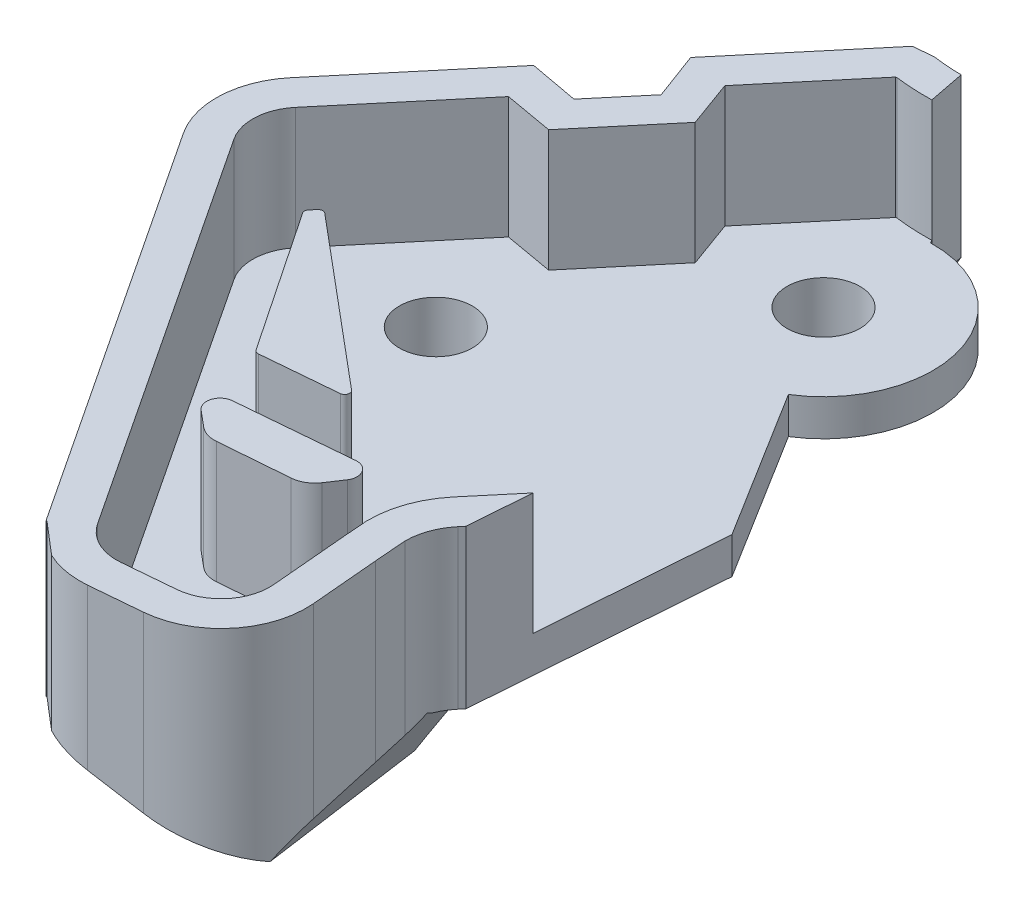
ISO-10303-21;
HEADER;
FILE_DESCRIPTION(('STEP AP214'),'2;1');
FILE_NAME('part.step','',(''),(''),'','','');
FILE_SCHEMA(('AUTOMOTIVE_DESIGN { 1 0 10303 214 1 1 1 1 }'));
ENDSEC;
DATA;
#1=APPLICATION_CONTEXT('core data for automotive mechanical design processes');
#2=APPLICATION_PROTOCOL_DEFINITION('international standard','automotive_design',2000,#1);
#3=PRODUCT_CONTEXT('',#1,'mechanical');
#4=PRODUCT('Part','Part','',(#3));
#5=PRODUCT_RELATED_PRODUCT_CATEGORY('part','',(#4));
#6=PRODUCT_DEFINITION_FORMATION('','',#4);
#7=PRODUCT_DEFINITION_CONTEXT('part definition',#1,'design');
#8=PRODUCT_DEFINITION('design','',#6,#7);
#9=PRODUCT_DEFINITION_SHAPE('','',#8);
#10=(LENGTH_UNIT() NAMED_UNIT(*) SI_UNIT(.MILLI.,.METRE.));
#11=(NAMED_UNIT(*) PLANE_ANGLE_UNIT() SI_UNIT($,.RADIAN.));
#12=(NAMED_UNIT(*) SI_UNIT($,.STERADIAN.) SOLID_ANGLE_UNIT());
#13=UNCERTAINTY_MEASURE_WITH_UNIT(LENGTH_MEASURE(1.E-05),#10,'distance_accuracy_value','');
#14=(GEOMETRIC_REPRESENTATION_CONTEXT(3) GLOBAL_UNCERTAINTY_ASSIGNED_CONTEXT((#13)) GLOBAL_UNIT_ASSIGNED_CONTEXT((#10,
#11,#12)) REPRESENTATION_CONTEXT('',''));
#15=CARTESIAN_POINT('',(0.,0.,0.));
#16=DIRECTION('',(0.,0.,1.));
#17=DIRECTION('',(1.,0.,0.));
#18=AXIS2_PLACEMENT_3D('',#15,#16,#17);
#19=CARTESIAN_POINT('',(-4766.22672796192,-4.49999999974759,-3200.6551043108));
#20=DIRECTION('',(0.834530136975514,0.,-0.550962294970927));
#21=DIRECTION('',(0.550962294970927,0.,0.834530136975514));
#22=AXIS2_PLACEMENT_3D('',#19,#20,#21);
#23=PLANE('',#22);
#24=DIRECTION('',(-0.544435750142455,-0.153463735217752,-0.824644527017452));
#25=VECTOR('',#24,1.);
#26=CARTESIAN_POINT('',(-4726.20864846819,-467.684907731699,-3140.04062367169));
#27=LINE('',#26,#25);
#28=CARTESIAN_POINT('',(-3060.88725645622,1.7303374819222,-617.61594584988));
#29=VERTEX_POINT('',#28);
#30=CARTESIAN_POINT('',(-3068.53489876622,-0.425354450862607,-629.199656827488));
#31=VERTEX_POINT('',#30);
#32=EDGE_CURVE('E1380',#29,#31,#27,.T.);
#33=ORIENTED_EDGE('',*,*,#32,.F.);
#34=DIRECTION('',(0.,1.,0.));
#35=VECTOR('',#34,1.);
#36=CARTESIAN_POINT('',(-3060.88725645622,-4.49999999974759,-617.61594584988));
#37=LINE('',#36,#35);
#38=CARTESIAN_POINT('',(-3060.88725645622,8.,-617.61594584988));
#39=VERTEX_POINT('',#38);
#40=EDGE_CURVE('E766',#29,#39,#37,.T.);
#41=ORIENTED_EDGE('',*,*,#40,.T.);
#42=DIRECTION('',(0.550962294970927,0.,0.834530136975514));
#43=VECTOR('',#42,1.);
#44=CARTESIAN_POINT('',(-4766.22672796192,8.,-3200.6551043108));
#45=LINE('',#44,#43);
#46=CARTESIAN_POINT('',(-3071.78777369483,8.,-634.126712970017));
#47=VERTEX_POINT('',#46);
#48=EDGE_CURVE('E762',#47,#39,#45,.T.);
#49=ORIENTED_EDGE('',*,*,#48,.F.);
#50=DIRECTION('',(0.,1.,0.));
#51=VECTOR('',#50,1.);
#52=CARTESIAN_POINT('',(-3071.78777369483,-4.49999999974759,-634.126712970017));
#53=LINE('',#52,#51);
#54=CARTESIAN_POINT('',(-3071.78777369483,-0.324513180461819,-634.126712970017));
#55=VERTEX_POINT('',#54);
#56=EDGE_CURVE('E770',#55,#47,#53,.T.);
#57=ORIENTED_EDGE('',*,*,#56,.F.);
#58=DIRECTION('',(0.550881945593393,-0.0170777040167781,0.834408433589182));
#59=VECTOR('',#58,1.);
#60=CARTESIAN_POINT('',(-4765.73560122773,52.188987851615,-3199.91120574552));
#61=LINE('',#60,#59);
#62=EDGE_CURVE('E802',#55,#31,#61,.T.);
#63=ORIENTED_EDGE('',*,*,#62,.T.);
#64=EDGE_LOOP('',(#33,#41,#49,#57,#63));
#65=FACE_BOUND('',#64,.T.);
#66=ADVANCED_FACE('F53',(#65),#23,.F.);
#67=CARTESIAN_POINT('',(-4329.84632053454,-600.462790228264,-3377.01210063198));
#68=DIRECTION('',(-0.152188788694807,-0.948731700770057,0.277032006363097));
#69=DIRECTION('',(-0.168072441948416,-0.251371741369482,-0.953186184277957));
#70=AXIS2_PLACEMENT_3D('',#67,#68,#69);
#71=PLANE('',#70);
#72=DIRECTION('',(-0.718695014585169,0.298643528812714,0.62792477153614));
#73=VECTOR('',#72,1.);
#74=CARTESIAN_POINT('',(-3067.49672745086,-0.856751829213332,-630.106708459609));
#75=LINE('',#74,#73);
#76=CARTESIAN_POINT('',(-3058.72913651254,-4.49999999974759,-637.76696409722));
#77=VERTEX_POINT('',#76);
#78=EDGE_CURVE('E1000',#77,#31,#75,.T.);
#79=ORIENTED_EDGE('',*,*,#78,.F.);
#80=DIRECTION('',(0.0967256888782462,-0.293248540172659,-0.951130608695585));
#81=VECTOR('',#80,1.);
#82=CARTESIAN_POINT('',(-3058.72939502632,-4.49921624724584,-637.76442205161));
#83=LINE('',#82,#81);
#84=CARTESIAN_POINT('',(-3060.7887949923,1.74437881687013,-617.513769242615));
#85=VERTEX_POINT('',#84);
#86=EDGE_CURVE('E1003',#85,#77,#83,.T.);
#87=ORIENTED_EDGE('',*,*,#86,.F.);
#88=DIRECTION('',(-0.758330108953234,-0.0676734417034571,-0.648348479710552));
#89=VECTOR('',#88,1.);
#90=CARTESIAN_POINT('',(-3060.46904599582,1.77291324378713,-617.240393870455));
#91=LINE('',#90,#89);
#92=CARTESIAN_POINT('',(-3060.79008291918,1.74426388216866,-617.514870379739));
#93=VERTEX_POINT('',#92);
#94=EDGE_CURVE('E1007',#85,#93,#91,.T.);
#95=ORIENTED_EDGE('',*,*,#94,.T.);
#96=DIRECTION('',(-0.0661252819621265,0.289442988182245,0.954908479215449));
#97=VECTOR('',#96,1.);
#98=CARTESIAN_POINT('',(-3060.90981457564,2.26835220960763,-615.785837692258));
#99=LINE('',#98,#97);
#100=CARTESIAN_POINT('',(-3060.79252497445,1.75495322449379,-617.479604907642));
#101=VERTEX_POINT('',#100);
#102=EDGE_CURVE('E1012',#93,#101,#99,.T.);
#103=ORIENTED_EDGE('',*,*,#102,.T.);
#104=CARTESIAN_POINT('',(-3057.96640097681,0.698706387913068,-619.544313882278));
#105=DIRECTION('',(0.152188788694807,0.948731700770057,-0.277032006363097));
#106=DIRECTION('',(-0.456799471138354,0.316082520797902,0.831520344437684));
#107=AXIS2_PLACEMENT_3D('',#104,#105,#106);
#108=ELLIPSE('',#107,3.68913571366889,3.50000000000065);
#109=EDGE_CURVE('E1383',#29,#101,#108,.T.);
#110=ORIENTED_EDGE('',*,*,#109,.F.);
#111=ORIENTED_EDGE('',*,*,#32,.T.);
#112=EDGE_LOOP('',(#79,#87,#95,#103,#110,#111));
#113=FACE_BOUND('',#112,.T.);
#114=ADVANCED_FACE('F1283',(#113),#71,.T.);
#115=CARTESIAN_POINT('',(-3050.20855560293,8.,-624.152011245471));
#116=DIRECTION('',(0.,1.,0.));
#117=DIRECTION('',(1.84513515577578E-12,0.,1.));
#118=AXIS2_PLACEMENT_3D('',#115,#116,#117);
#119=PLANE('',#118);
#120=CARTESIAN_POINT('',(-3057.96640097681,8.,-619.544313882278));
#121=DIRECTION('',(0.,-1.,0.));
#122=DIRECTION('',(-0.984807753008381,0.,0.173648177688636));
#123=AXIS2_PLACEMENT_3D('',#120,#121,#122);
#124=CIRCLE('',#123,3.50000000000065);
#125=CARTESIAN_POINT('',(-3060.79252497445,8.,-617.479604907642));
#126=VERTEX_POINT('',#125);
#127=EDGE_CURVE('E653',#126,#39,#124,.T.);
#128=ORIENTED_EDGE('',*,*,#127,.F.);
#129=DIRECTION('',(0.0690823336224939,0.,-0.997610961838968));
#130=VECTOR('',#129,1.);
#131=CARTESIAN_POINT('',(-3060.79008291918,8.,-617.514870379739));
#132=LINE('',#131,#130);
#133=CARTESIAN_POINT('',(-3060.79008291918,8.,-617.514870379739));
#134=VERTEX_POINT('',#133);
#135=EDGE_CURVE('E1015',#126,#134,#132,.T.);
#136=ORIENTED_EDGE('',*,*,#135,.T.);
#137=DIRECTION('',(0.760072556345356,0.,0.649838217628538));
#138=VECTOR('',#137,1.);
#139=CARTESIAN_POINT('',(-3060.79008291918,8.,-617.514870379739));
#140=LINE('',#139,#138);
#141=CARTESIAN_POINT('',(-3059.4634430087,8.,-616.38063482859));
#142=VERTEX_POINT('',#141);
#143=EDGE_CURVE('E1010',#134,#142,#140,.T.);
#144=ORIENTED_EDGE('',*,*,#143,.T.);
#145=CARTESIAN_POINT('',(-3057.66135587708,8.,-616.057632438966));
#146=VERTEX_POINT('',#145);
#147=EDGE_CURVE('E726',#146,#142,#124,.T.);
#148=ORIENTED_EDGE('',*,*,#147,.F.);
#149=DIRECTION('',(0.996194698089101,0.,-0.0871557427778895));
#150=VECTOR('',#149,1.);
#151=CARTESIAN_POINT('',(-3969.65155326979,8.,-536.268828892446));
#152=LINE('',#151,#150);
#153=CARTESIAN_POINT('',(-3055.53954911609,8.,-616.24326647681));
#154=VERTEX_POINT('',#153);
#155=EDGE_CURVE('E729',#146,#154,#152,.T.);
#156=ORIENTED_EDGE('',*,*,#155,.T.);
#157=CARTESIAN_POINT('',(-3055.84459421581,8.,-619.729947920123));
#158=DIRECTION('',(0.,-1.,0.));
#159=DIRECTION('',(-0.984807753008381,0.,0.173648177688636));
#160=AXIS2_PLACEMENT_3D('',#157,#158,#159);
#161=CIRCLE('',#160,3.50000000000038);
#162=CARTESIAN_POINT('',(-3052.3579127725,8.,-620.034993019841));
#163=VERTEX_POINT('',#162);
#164=EDGE_CURVE('E732',#163,#154,#161,.T.);
#165=ORIENTED_EDGE('',*,*,#164,.F.);
#166=DIRECTION('',(-0.0871557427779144,0.,-0.996194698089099));
#167=VECTOR('',#166,1.);
#168=CARTESIAN_POINT('',(-3315.92566674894,8.,-3632.62820523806));
#169=LINE('',#168,#167);
#170=CARTESIAN_POINT('',(-3052.60299393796,8.,-622.836283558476));
#171=VERTEX_POINT('',#170);
#172=EDGE_CURVE('E735',#163,#171,#169,.T.);
#173=ORIENTED_EDGE('',*,*,#172,.T.);
#174=DIRECTION('',(0.64278761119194,0.,-0.766044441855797));
#175=VECTOR('',#174,1.);
#176=CARTESIAN_POINT('',(-2098.0279722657,8.,-1760.4544904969));
#177=LINE('',#176,#175);
#178=CARTESIAN_POINT('',(-3052.60291319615,8.,-622.836379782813));
#179=VERTEX_POINT('',#178);
#180=EDGE_CURVE('E738',#171,#179,#177,.T.);
#181=ORIENTED_EDGE('',*,*,#180,.T.);
#182=DIRECTION('',(-0.08045383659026,0.,-0.996758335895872));
#183=VECTOR('',#182,1.);
#184=CARTESIAN_POINT('',(-3295.17328275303,8.,-3628.08818807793));
#185=LINE('',#184,#183);
#186=CARTESIAN_POINT('',(-3052.70854600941,8.,-624.145085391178));
#187=VERTEX_POINT('',#186);
#188=EDGE_CURVE('E741',#179,#187,#185,.T.);
#189=ORIENTED_EDGE('',*,*,#188,.T.);
#190=CARTESIAN_POINT('',(-3050.20855560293,8.,-624.152011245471));
#191=DIRECTION('',(0.,-1.,0.));
#192=DIRECTION('',(-0.984807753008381,0.,0.173648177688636));
#193=AXIS2_PLACEMENT_3D('',#190,#191,#192);
#194=CIRCLE('',#193,2.49999999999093);
#195=CARTESIAN_POINT('',(-3052.12366671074,8.,-625.758980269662));
#196=VERTEX_POINT('',#195);
#197=EDGE_CURVE('E744',#187,#196,#194,.T.);
#198=ORIENTED_EDGE('',*,*,#197,.T.);
#199=DIRECTION('',(0.642787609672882,0.,-0.766044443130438));
#200=VECTOR('',#199,1.);
#201=CARTESIAN_POINT('',(-2099.18583739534,8.,-1761.42606191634));
#202=LINE('',#201,#200);
#203=CARTESIAN_POINT('',(-3051.97734479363,8.,-625.933359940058));
#204=VERTEX_POINT('',#203);
#205=EDGE_CURVE('E747',#196,#204,#202,.T.);
#206=ORIENTED_EDGE('',*,*,#205,.T.);
#207=DIRECTION('',(-0.0747171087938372,0.,0.997204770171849));
#208=VECTOR('',#207,1.);
#209=CARTESIAN_POINT('',(-3052.19819873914,8.,-622.985753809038));
#210=LINE('',#209,#208);
#211=CARTESIAN_POINT('',(-3051.78535361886,8.,-628.49575185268));
#212=VERTEX_POINT('',#211);
#213=EDGE_CURVE('E836',#212,#204,#210,.T.);
#214=ORIENTED_EDGE('',*,*,#213,.F.);
#215=DIRECTION('',(-0.642787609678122,0.,0.766044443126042));
#216=VECTOR('',#215,1.);
#217=CARTESIAN_POINT('',(-3051.12380070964,8.,-629.284159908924));
#218=LINE('',#217,#216);
#219=CARTESIAN_POINT('',(-3053.27273337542,8.,-626.72316168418));
#220=VERTEX_POINT('',#219);
#221=EDGE_CURVE('E1164',#212,#220,#218,.T.);
#222=ORIENTED_EDGE('',*,*,#221,.T.);
#223=CARTESIAN_POINT('',(-3050.20855560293,8.,-624.152011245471));
#224=DIRECTION('',(0.,1.,0.));
#225=DIRECTION('',(1.84513515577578E-12,0.,1.));
#226=AXIS2_PLACEMENT_3D('',#223,#224,#225);
#227=CIRCLE('',#226,3.99999999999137);
#228=CARTESIAN_POINT('',(-3054.2078287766,8.,-624.075761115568));
#229=VERTEX_POINT('',#228);
#230=EDGE_CURVE('E1184',#220,#229,#227,.T.);
#231=ORIENTED_EDGE('',*,*,#230,.T.);
#232=CARTESIAN_POINT('',(-3054.2078287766,8.,-624.075761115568));
#233=DIRECTION('',(0.080453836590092,0.,0.996758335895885));
#234=VECTOR('',#233,1.);
#235=LINE('',#232,#234);
#236=CARTESIAN_POINT('',(-3054.20486299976,8.,-624.039017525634));
#237=VERTEX_POINT('',#236);
#238=EDGE_CURVE('E1261',#229,#237,#235,.T.);
#239=ORIENTED_EDGE('',*,*,#238,.T.);
#240=DIRECTION('',(-0.0804538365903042,0.,-0.996758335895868));
#241=VECTOR('',#240,1.);
#242=CARTESIAN_POINT('',(-3054.09658235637,8.,-622.697507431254));
#243=LINE('',#242,#241);
#244=CARTESIAN_POINT('',(-3054.14756351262,8.,-623.329122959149));
#245=VERTEX_POINT('',#244);
#246=EDGE_CURVE('E841',#245,#237,#243,.T.);
#247=ORIENTED_EDGE('',*,*,#246,.F.);
#248=DIRECTION('',(-0.642787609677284,0.,0.766044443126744));
#249=VECTOR('',#248,1.);
#250=CARTESIAN_POINT('',(-3054.15143762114,8.,-623.324505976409));
#251=LINE('',#250,#249);
#252=CARTESIAN_POINT('',(-3054.15143762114,8.,-623.324505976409));
#253=VERTEX_POINT('',#252);
#254=EDGE_CURVE('E1066',#245,#253,#251,.T.);
#255=ORIENTED_EDGE('',*,*,#254,.T.);
#256=DIRECTION('',(0.0871557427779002,0.,0.9961946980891));
#257=VECTOR('',#256,1.);
#258=CARTESIAN_POINT('',(-3053.85220481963,8.,-619.904259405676));
#259=LINE('',#258,#257);
#260=CARTESIAN_POINT('',(-3053.85220481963,8.,-619.904259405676));
#261=VERTEX_POINT('',#260);
#262=EDGE_CURVE('E1051',#253,#261,#259,.T.);
#263=ORIENTED_EDGE('',*,*,#262,.T.);
#264=CARTESIAN_POINT('',(-3055.84459421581,8.,-619.729947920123));
#265=DIRECTION('',(0.,-1.,0.));
#266=DIRECTION('',(0.984807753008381,0.,-0.173648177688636));
#267=AXIS2_PLACEMENT_3D('',#264,#265,#266);
#268=CIRCLE('',#267,2.00000000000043);
#269=CARTESIAN_POINT('',(-3055.67028273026,8.,-617.737558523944));
#270=VERTEX_POINT('',#269);
#271=EDGE_CURVE('E1046',#261,#270,#268,.T.);
#272=ORIENTED_EDGE('',*,*,#271,.T.);
#273=DIRECTION('',(-0.996194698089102,0.,0.0871557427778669));
#274=VECTOR('',#273,1.);
#275=CARTESIAN_POINT('',(-3057.79208949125,8.,-617.551924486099));
#276=LINE('',#275,#274);
#277=CARTESIAN_POINT('',(-3057.79208949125,8.,-617.551924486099));
#278=VERTEX_POINT('',#277);
#279=EDGE_CURVE('E1041',#270,#278,#276,.T.);
#280=ORIENTED_EDGE('',*,*,#279,.T.);
#281=CARTESIAN_POINT('',(-3057.96640097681,8.,-619.544313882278));
#282=DIRECTION('',(0.,-1.,0.));
#283=DIRECTION('',(0.984807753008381,0.,-0.173648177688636));
#284=AXIS2_PLACEMENT_3D('',#281,#282,#283);
#285=CIRCLE('',#284,2.00000000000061);
#286=CARTESIAN_POINT('',(-3059.63546125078,8.,-618.442389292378));
#287=VERTEX_POINT('',#286);
#288=EDGE_CURVE('E1036',#278,#287,#285,.T.);
#289=ORIENTED_EDGE('',*,*,#288,.T.);
#290=DIRECTION('',(-0.550962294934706,0.,-0.834530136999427));
#291=VECTOR('',#290,1.);
#292=CARTESIAN_POINT('',(-3070.40292478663,8.,-634.751622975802));
#293=LINE('',#292,#291);
#294=CARTESIAN_POINT('',(-3070.53597848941,8.,-634.953156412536));
#295=VERTEX_POINT('',#294);
#296=EDGE_CURVE('E1089',#287,#295,#293,.T.);
#297=ORIENTED_EDGE('',*,*,#296,.T.);
#298=CARTESIAN_POINT('',(-3068.86691821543,8.,-636.055081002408));
#299=DIRECTION('',(0.,-1.,0.));
#300=DIRECTION('',(1.84513515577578E-12,0.,1.));
#301=AXIS2_PLACEMENT_3D('',#298,#299,#300);
#302=CIRCLE('',#301,1.99999999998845);
#303=CARTESIAN_POINT('',(-3070.39900710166,8.,-637.340656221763));
#304=VERTEX_POINT('',#303);
#305=EDGE_CURVE('E1154',#295,#304,#302,.T.);
#306=ORIENTED_EDGE('',*,*,#305,.T.);
#307=DIRECTION('',(0.642787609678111,0.,-0.766044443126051));
#308=VECTOR('',#307,1.);
#309=CARTESIAN_POINT('',(-3070.39900710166,8.,-637.340656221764));
#310=LINE('',#309,#308);
#311=CARTESIAN_POINT('',(-3066.40200615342,8.,-642.104096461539));
#312=VERTEX_POINT('',#311);
#313=EDGE_CURVE('E1149',#304,#312,#310,.T.);
#314=ORIENTED_EDGE('',*,*,#313,.T.);
#315=DIRECTION('',(0.984807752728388,0.,0.173648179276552));
#316=VECTOR('',#315,1.);
#317=CARTESIAN_POINT('',(-3066.40200615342,8.,-642.104096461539));
#318=LINE('',#317,#316);
#319=CARTESIAN_POINT('',(-3064.39577117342,8.,-641.750343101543));
#320=VERTEX_POINT('',#319);
#321=EDGE_CURVE('E1145',#312,#320,#318,.T.);
#322=ORIENTED_EDGE('',*,*,#321,.T.);
#323=DIRECTION('',(0.642787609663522,0.,-0.766044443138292));
#324=VECTOR('',#323,1.);
#325=CARTESIAN_POINT('',(-3064.39577117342,8.,-641.750343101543));
#326=LINE('',#325,#324);
#327=CARTESIAN_POINT('',(-3061.64687446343,8.,-645.026350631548));
#328=VERTEX_POINT('',#327);
#329=EDGE_CURVE('E1141',#320,#328,#326,.T.);
#330=ORIENTED_EDGE('',*,*,#329,.T.);
#331=DIRECTION('',(-0.342020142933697,0.,-0.939692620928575));
#332=VECTOR('',#331,1.);
#333=CARTESIAN_POINT('',(-3061.64687446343,8.,-645.026350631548));
#334=LINE('',#333,#332);
#335=CARTESIAN_POINT('',(-3062.34363256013,8.,-646.940677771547));
#336=VERTEX_POINT('',#335);
#337=EDGE_CURVE('E1136',#328,#336,#334,.T.);
#338=ORIENTED_EDGE('',*,*,#337,.T.);
#339=DIRECTION('',(0.642787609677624,0.,-0.766044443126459));
#340=VECTOR('',#339,1.);
#341=CARTESIAN_POINT('',(-3062.34363256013,8.,-646.940677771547));
#342=LINE('',#341,#340);
#343=CARTESIAN_POINT('',(-3059.13895028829,8.,-650.759869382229));
#344=VERTEX_POINT('',#343);
#345=EDGE_CURVE('E1131',#336,#344,#342,.T.);
#346=ORIENTED_EDGE('',*,*,#345,.T.);
#347=DIRECTION('',(0.995965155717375,0.,-0.0897407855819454));
#348=VECTOR('',#347,1.);
#349=CARTESIAN_POINT('',(-3059.13895028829,8.,-650.759869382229));
#350=LINE('',#349,#348);
#351=CARTESIAN_POINT('',(-3059.08361338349,8.,-650.764855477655));
#352=VERTEX_POINT('',#351);
#353=EDGE_CURVE('E1096',#344,#352,#350,.T.);
#354=ORIENTED_EDGE('',*,*,#353,.T.);
#355=CARTESIAN_POINT('',(-3057.84215895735,8.,-660.407925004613));
#356=DIRECTION('',(0.,1.,0.));
#357=DIRECTION('',(0.984807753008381,0.,-0.173648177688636));
#358=AXIS2_PLACEMENT_3D('',#355,#356,#357);
#359=CIRCLE('',#358,9.72265390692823);
#360=CARTESIAN_POINT('',(-3057.58092938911,8.,-650.68878110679));
#361=VERTEX_POINT('',#360);
#362=EDGE_CURVE('E1080',#352,#361,#359,.T.);
#363=ORIENTED_EDGE('',*,*,#362,.T.);
#364=DIRECTION('',(-0.190734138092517,0.,-0.981641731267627));
#365=VECTOR('',#364,1.);
#366=CARTESIAN_POINT('',(-3058.25325190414,8.,-654.14898935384));
#367=LINE('',#366,#365);
#368=CARTESIAN_POINT('',(-3057.87170946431,8.,-652.185324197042));
#369=VERTEX_POINT('',#368);
#370=EDGE_CURVE('E1102',#361,#369,#367,.T.);
#371=ORIENTED_EDGE('',*,*,#370,.T.);
#372=CARTESIAN_POINT('',(-3057.84215895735,8.,-660.407925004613));
#373=DIRECTION('',(0.,-1.,0.));
#374=DIRECTION('',(-0.984807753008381,0.,0.173648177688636));
#375=AXIS2_PLACEMENT_3D('',#372,#373,#374);
#376=CIRCLE('',#375,8.22265390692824);
#377=CARTESIAN_POINT('',(-3059.04788275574,8.,-652.274151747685));
#378=VERTEX_POINT('',#377);
#379=EDGE_CURVE('E750',#369,#378,#376,.T.);
#380=ORIENTED_EDGE('',*,*,#379,.T.);
#381=DIRECTION('',(-0.995965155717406,0.,0.0897407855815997));
#382=VECTOR('',#381,1.);
#383=CARTESIAN_POINT('',(-3964.86093149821,8.,-570.656462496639));
#384=LINE('',#383,#382);
#385=CARTESIAN_POINT('',(-3059.89010493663,8.,-652.198263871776));
#386=VERTEX_POINT('',#385);
#387=EDGE_CURVE('E753',#378,#386,#384,.T.);
#388=ORIENTED_EDGE('',*,*,#387,.T.);
#389=DIRECTION('',(-0.642787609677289,0.,0.766044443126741));
#390=VECTOR('',#389,1.);
#391=CARTESIAN_POINT('',(-3067.55107281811,8.,-643.068277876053));
#392=LINE('',#391,#390);
#393=CARTESIAN_POINT('',(-3064.04936962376,8.,-647.241445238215));
#394=VERTEX_POINT('',#393);
#395=EDGE_CURVE('E1161',#386,#394,#392,.T.);
#396=ORIENTED_EDGE('',*,*,#395,.T.);
#397=DIRECTION('',(-0.342020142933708,0.,-0.939692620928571));
#398=VECTOR('',#397,1.);
#399=CARTESIAN_POINT('',(-3061.01768759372,8.,-638.911967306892));
#400=LINE('',#399,#398);
#401=CARTESIAN_POINT('',(-3064.04218405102,8.,-647.221703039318));
#402=VERTEX_POINT('',#401);
#403=EDGE_CURVE('E1115',#402,#394,#400,.T.);
#404=ORIENTED_EDGE('',*,*,#403,.F.);
#405=DIRECTION('',(0.348840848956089,0.,0.937181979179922));
#406=VECTOR('',#405,1.);
#407=CARTESIAN_POINT('',(-3064.04218405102,8.,-647.221703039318));
#408=LINE('',#407,#406);
#409=CARTESIAN_POINT('',(-3063.32987395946,8.,-645.308039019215));
#410=VERTEX_POINT('',#409);
#411=EDGE_CURVE('E1053',#402,#410,#408,.T.);
#412=ORIENTED_EDGE('',*,*,#411,.T.);
#413=DIRECTION('',(0.642787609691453,0.,-0.766044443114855));
#414=VECTOR('',#413,1.);
#415=CARTESIAN_POINT('',(-3064.96542987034,8.,-643.35885938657));
#416=LINE('',#415,#414);
#417=CARTESIAN_POINT('',(-3064.96542987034,8.,-643.35885938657));
#418=VERTEX_POINT('',#417);
#419=EDGE_CURVE('E1112',#418,#410,#416,.T.);
#420=ORIENTED_EDGE('',*,*,#419,.F.);
#421=DIRECTION('',(-0.983533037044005,0.,-0.180728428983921));
#422=VECTOR('',#421,1.);
#423=CARTESIAN_POINT('',(-3064.96542987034,8.,-643.35885938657));
#424=LINE('',#423,#422);
#425=CARTESIAN_POINT('',(-3066.97382410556,8.,-643.727910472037));
#426=VERTEX_POINT('',#425);
#427=EDGE_CURVE('E1058',#418,#426,#424,.T.);
#428=ORIENTED_EDGE('',*,*,#427,.T.);
#429=DIRECTION('',(-0.64278760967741,0.,0.766044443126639));
#430=VECTOR('',#429,1.);
#431=CARTESIAN_POINT('',(-3064.03116873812,8.,-647.234830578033));
#432=LINE('',#431,#430);
#433=CARTESIAN_POINT('',(-3066.97371238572,8.,-643.728043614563));
#434=VERTEX_POINT('',#433);
#435=EDGE_CURVE('E1095',#434,#426,#432,.T.);
#436=ORIENTED_EDGE('',*,*,#435,.F.);
#437=DIRECTION('',(-0.984807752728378,0.,-0.173648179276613));
#438=VECTOR('',#437,1.);
#439=CARTESIAN_POINT('',(-3066.14153388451,8.,-643.581308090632));
#440=LINE('',#439,#438);
#441=CARTESIAN_POINT('',(-3066.99440241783,8.,-643.731691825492));
#442=VERTEX_POINT('',#441);
#443=EDGE_CURVE('E1120',#434,#442,#440,.T.);
#444=ORIENTED_EDGE('',*,*,#443,.T.);
#445=DIRECTION('',(-0.642787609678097,0.,0.766044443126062));
#446=VECTOR('',#445,1.);
#447=CARTESIAN_POINT('',(-2116.76217617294,8.,-1776.17436127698));
#448=LINE('',#447,#446);
#449=CARTESIAN_POINT('',(-3071.54807376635,8.,-638.304837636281));
#450=VERTEX_POINT('',#449);
#451=EDGE_CURVE('E756',#442,#450,#448,.T.);
#452=ORIENTED_EDGE('',*,*,#451,.T.);
#453=CARTESIAN_POINT('',(-3068.86691821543,8.,-636.055081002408));
#454=DIRECTION('',(0.,-1.,0.));
#455=DIRECTION('',(-0.984807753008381,0.,0.173648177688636));
#456=AXIS2_PLACEMENT_3D('',#453,#454,#455);
#457=CIRCLE('',#456,3.49999999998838);
#458=EDGE_CURVE('E759',#47,#450,#457,.T.);
#459=ORIENTED_EDGE('',*,*,#458,.F.);
#460=ORIENTED_EDGE('',*,*,#48,.T.);
#461=EDGE_LOOP('',(#128,#136,#144,#148,#156,#165,#173,#181,#189,#198,#206,#214,#222,#231,#239,
#247,#255,#263,#272,#280,#289,#297,#306,#314,#322,#330,#338,#346,#354,#363,#371,#380,#388,#396,
#404,#412,#420,#428,#436,#444,#452,#459,#460));
#462=FACE_BOUND('',#461,.T.);
#463=ADVANCED_FACE('F1273',(#462),#119,.T.);
#464=CARTESIAN_POINT('',(-3792.847460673,-308.438525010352,-3629.15671156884));
#465=DIRECTION('',(0.811035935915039,-0.567660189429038,-0.141359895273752));
#466=DIRECTION('',(0.559036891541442,0.823262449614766,-0.0985732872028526));
#467=AXIS2_PLACEMENT_3D('',#464,#465,#466);
#468=PLANE('',#467);
#469=DIRECTION('',(0.298058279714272,0.193055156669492,0.93482135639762));
#470=VECTOR('',#469,1.);
#471=CARTESIAN_POINT('',(-3974.93106839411,-597.932625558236,-3511.31616902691));
#472=LINE('',#471,#470);
#473=CARTESIAN_POINT('',(-3055.36234158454,-2.31929519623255,-627.207445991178));
#474=VERTEX_POINT('',#473);
#475=CARTESIAN_POINT('',(-3052.57773911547,-0.515681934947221,-618.473899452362));
#476=VERTEX_POINT('',#475);
#477=EDGE_CURVE('E942',#474,#476,#472,.T.);
#478=ORIENTED_EDGE('',*,*,#477,.F.);
#479=CARTESIAN_POINT('',(-3056.02510191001,-2.5375964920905,-630.133321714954));
#480=DIRECTION('',(-0.811035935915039,0.567660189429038,0.141359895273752));
#481=DIRECTION('',(-0.559229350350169,-0.823262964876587,0.0974711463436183));
#482=AXIS2_PLACEMENT_3D('',#479,#480,#481);
#483=ELLIPSE('',#482,5.28485184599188,3.00000000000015);
#484=CARTESIAN_POINT('',(-3055.35930360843,-2.31478295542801,-627.208135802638));
#485=VERTEX_POINT('',#484);
#486=EDGE_CURVE('E1244',#485,#474,#483,.F.);
#487=ORIENTED_EDGE('',*,*,#486,.F.);
#488=DIRECTION('',(-0.298297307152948,-0.193435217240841,-0.934666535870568));
#489=VECTOR('',#488,1.);
#490=CARTESIAN_POINT('',(-3975.61446668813,-599.067596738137,-3510.67937328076));
#491=LINE('',#490,#489);
#492=CARTESIAN_POINT('',(-3052.57449204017,-0.508931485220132,-618.482377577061));
#493=VERTEX_POINT('',#492);
#494=EDGE_CURVE('E921',#493,#485,#491,.T.);
#495=ORIENTED_EDGE('',*,*,#494,.F.);
#496=CARTESIAN_POINT('',(-3055.84459421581,-4.87036815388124,-619.729947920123));
#497=DIRECTION('',(-0.811035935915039,0.567660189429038,0.141359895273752));
#498=DIRECTION('',(0.559229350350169,0.823262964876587,-0.0974711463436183));
#499=AXIS2_PLACEMENT_3D('',#496,#497,#498);
#500=ELLIPSE('',#499,6.16566048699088,3.50000000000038);
#501=EDGE_CURVE('E812',#476,#493,#500,.T.);
#502=ORIENTED_EDGE('',*,*,#501,.F.);
#503=EDGE_LOOP('',(#478,#487,#495,#502));
#504=FACE_BOUND('',#503,.T.);
#505=ADVANCED_FACE('F55',(#504),#468,.T.);
#506=CARTESIAN_POINT('',(-3060.79008291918,8.,-617.514870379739));
#507=DIRECTION('',(-0.649838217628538,0.,0.760072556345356));
#508=DIRECTION('',(-0.760072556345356,0.,-0.649838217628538));
#509=AXIS2_PLACEMENT_3D('',#506,#507,#508);
#510=PLANE('',#509);
#511=ORIENTED_EDGE('',*,*,#143,.F.);
#512=DIRECTION('',(0.,-1.,0.));
#513=VECTOR('',#512,1.);
#514=CARTESIAN_POINT('',(-3060.79008291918,8.,-617.514870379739));
#515=LINE('',#514,#513);
#516=EDGE_CURVE('E1016',#134,#93,#515,.T.);
#517=ORIENTED_EDGE('',*,*,#516,.T.);
#518=ORIENTED_EDGE('',*,*,#94,.F.);
#519=DIRECTION('',(0.168390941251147,0.975149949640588,0.143968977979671));
#520=VECTOR('',#519,1.);
#521=CARTESIAN_POINT('',(-3059.76164506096,7.6925919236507,-616.635588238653));
#522=LINE('',#521,#520);
#523=CARTESIAN_POINT('',(-3060.78782431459,1.75000000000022,-617.512939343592));
#524=VERTEX_POINT('',#523);
#525=EDGE_CURVE('E1029',#85,#524,#522,.T.);
#526=ORIENTED_EDGE('',*,*,#525,.T.);
#527=DIRECTION('',(0.760072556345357,0.,0.649838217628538));
#528=VECTOR('',#527,1.);
#529=CARTESIAN_POINT('',(-3060.79008291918,1.75000000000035,-617.514870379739));
#530=LINE('',#529,#528);
#531=CARTESIAN_POINT('',(-3060.72580554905,1.75000000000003,-617.45991524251));
#532=VERTEX_POINT('',#531);
#533=EDGE_CURVE('E1028',#524,#532,#530,.T.);
#534=ORIENTED_EDGE('',*,*,#533,.T.);
#535=CARTESIAN_POINT('',(-3060.45768481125,1.77392711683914,-617.230680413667));
#536=VERTEX_POINT('',#535);
#537=EDGE_CURVE('E1011',#536,#532,#91,.T.);
#538=ORIENTED_EDGE('',*,*,#537,.F.);
#539=DIRECTION('',(-0.111681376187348,-0.989146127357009,-0.0954840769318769));
#540=VECTOR('',#539,1.);
#541=CARTESIAN_POINT('',(-3059.7770719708,7.80201862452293,-616.648777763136));
#542=LINE('',#541,#540);
#543=CARTESIAN_POINT('',(-3060.46038634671,1.75000000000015,-617.232990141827));
#544=VERTEX_POINT('',#543);
#545=EDGE_CURVE('E1004',#536,#544,#542,.T.);
#546=ORIENTED_EDGE('',*,*,#545,.T.);
#547=DIRECTION('',(-0.760072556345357,0.,-0.649838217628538));
#548=VECTOR('',#547,1.);
#549=CARTESIAN_POINT('',(-3060.79008291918,1.75000000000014,-617.514870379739));
#550=LINE('',#549,#548);
#551=CARTESIAN_POINT('',(-3059.4634430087,1.75000000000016,-616.38063482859));
#552=VERTEX_POINT('',#551);
#553=EDGE_CURVE('E945',#552,#544,#550,.T.);
#554=ORIENTED_EDGE('',*,*,#553,.F.);
#555=DIRECTION('',(0.,1.,0.));
#556=VECTOR('',#555,1.);
#557=CARTESIAN_POINT('',(-3059.4634430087,-4.49999999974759,-616.38063482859));
#558=LINE('',#557,#556);
#559=EDGE_CURVE('E809',#142,#552,#558,.F.);
#560=ORIENTED_EDGE('',*,*,#559,.F.);
#561=EDGE_LOOP('',(#511,#517,#518,#526,#534,#538,#546,#554,#560));
#562=FACE_BOUND('',#561,.T.);
#563=ADVANCED_FACE('F1652',(#562),#510,.T.);
#564=CARTESIAN_POINT('',(-4139.35427843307,329.009951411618,-3549.61315793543));
#565=DIRECTION('',(-0.275164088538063,-0.961364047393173,-0.00799329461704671));
#566=DIRECTION('',(0.948228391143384,-0.270014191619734,-0.167198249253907));
#567=AXIS2_PLACEMENT_3D('',#564,#565,#566);
#568=PLANE('',#567);
#569=DIRECTION('',(0.632882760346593,-0.174874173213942,-0.754240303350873));
#570=VECTOR('',#569,1.);
#571=CARTESIAN_POINT('',(-2146.05192941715,-256.553716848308,-1741.26819262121));
#572=LINE('',#571,#570);
#573=CARTESIAN_POINT('',(-3071.54807376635,-0.82645866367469,-638.304837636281));
#574=VERTEX_POINT('',#573);
#575=CARTESIAN_POINT('',(-3066.99440241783,-2.08470041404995,-643.731691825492));
#576=VERTEX_POINT('',#575);
#577=EDGE_CURVE('E818',#574,#576,#572,.T.);
#578=ORIENTED_EDGE('',*,*,#577,.T.);
#579=DIRECTION('',(-0.947513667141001,0.272588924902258,-0.167072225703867));
#580=VECTOR('',#579,1.);
#581=CARTESIAN_POINT('',(-3068.80959993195,-1.56248869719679,-644.051760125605));
#582=LINE('',#581,#580);
#583=CARTESIAN_POINT('',(-3066.97371238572,-2.09065270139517,-643.728043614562));
#584=VERTEX_POINT('',#583);
#585=EDGE_CURVE('E1121',#584,#576,#582,.T.);
#586=ORIENTED_EDGE('',*,*,#585,.F.);
#587=DIRECTION('',(-0.632882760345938,0.174874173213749,0.754240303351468));
#588=VECTOR('',#587,1.);
#589=CARTESIAN_POINT('',(-3065.23793606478,-2.57027146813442,-645.796661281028));
#590=LINE('',#589,#588);
#591=CARTESIAN_POINT('',(-3066.97382410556,-2.09062183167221,-643.727910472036));
#592=VERTEX_POINT('',#591);
#593=EDGE_CURVE('E1101',#584,#592,#590,.T.);
#594=ORIENTED_EDGE('',*,*,#593,.T.);
#595=DIRECTION('',(0.946363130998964,-0.272316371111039,0.173898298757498));
#596=VECTOR('',#595,1.);
#597=CARTESIAN_POINT('',(-3067.71482067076,-1.87739977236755,-643.864071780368));
#598=LINE('',#597,#596);
#599=CARTESIAN_POINT('',(-3064.96542987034,-2.66853807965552,-643.35885938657));
#600=VERTEX_POINT('',#599);
#601=EDGE_CURVE('E1061',#592,#600,#598,.T.);
#602=ORIENTED_EDGE('',*,*,#601,.T.);
#603=DIRECTION('',(0.632882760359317,-0.174874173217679,-0.75424030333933));
#604=VECTOR('',#603,1.);
#605=CARTESIAN_POINT('',(-3066.14616871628,-2.34228376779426,-641.951709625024));
#606=LINE('',#605,#604);
#607=CARTESIAN_POINT('',(-3064.08348246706,-2.91223222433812,-644.409923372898));
#608=VERTEX_POINT('',#607);
#609=EDGE_CURVE('E1109',#600,#608,#606,.T.);
#610=ORIENTED_EDGE('',*,*,#609,.T.);
#611=DIRECTION('',(-0.616956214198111,0.182951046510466,-0.76543709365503));
#612=VECTOR('',#611,1.);
#613=CARTESIAN_POINT('',(-4882.79071012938,536.403821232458,-2900.81960450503));
#614=LINE('',#613,#612);
#615=EDGE_CURVE('E1056',#77,#608,#614,.T.);
#616=ORIENTED_EDGE('',*,*,#615,.F.);
#617=DIRECTION('',(-0.959543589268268,0.274107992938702,0.0643498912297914));
#618=VECTOR('',#617,1.);
#619=CARTESIAN_POINT('',(-3961.47794609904,253.383713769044,-577.225902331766));
#620=LINE('',#619,#618);
#621=CARTESIAN_POINT('',(-3061.69630123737,-3.65238497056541,-637.567977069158));
#622=VERTEX_POINT('',#621);
#623=EDGE_CURVE('E1106',#77,#622,#620,.T.);
#624=ORIENTED_EDGE('',*,*,#623,.T.);
#625=CARTESIAN_POINT('',(-3064.69190543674,-2.79632524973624,-637.405633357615));
#626=DIRECTION('',(0.275164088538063,0.961364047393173,0.00799329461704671));
#627=DIRECTION('',(0.960958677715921,-0.275280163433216,0.0279150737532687));
#628=AXIS2_PLACEMENT_3D('',#625,#626,#627);
#629=ELLIPSE('',#628,3.1205660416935,3.00000000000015);
#630=CARTESIAN_POINT('',(-3067.68236215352,-1.94237704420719,-637.166533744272));
#631=VERTEX_POINT('',#630);
#632=EDGE_CURVE('E1250',#631,#622,#629,.F.);
#633=ORIENTED_EDGE('',*,*,#632,.F.);
#634=CARTESIAN_POINT('',(-3072.27342489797,-0.630871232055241,-636.858643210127));
#635=VERTEX_POINT('',#634);
#636=EDGE_CURVE('E995',#631,#635,#620,.T.);
#637=ORIENTED_EDGE('',*,*,#636,.T.);
#638=CARTESIAN_POINT('',(-3068.86691821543,-1.61257157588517,-636.055081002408));
#639=DIRECTION('',(0.275164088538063,0.961364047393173,0.00799329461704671));
#640=DIRECTION('',(-0.960958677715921,0.275280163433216,-0.0279150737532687));
#641=AXIS2_PLACEMENT_3D('',#638,#639,#640);
#642=ELLIPSE('',#641,3.64066038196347,3.49999999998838);
#643=EDGE_CURVE('E1392',#574,#635,#642,.T.);
#644=ORIENTED_EDGE('',*,*,#643,.F.);
#645=EDGE_LOOP('',(#578,#586,#594,#602,#610,#616,#624,#633,#637,#644));
#646=FACE_BOUND('',#645,.T.);
#647=ADVANCED_FACE('F1360',(#646),#568,.T.);
#648=CARTESIAN_POINT('',(-3060.79008291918,8.,-617.514870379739));
#649=DIRECTION('',(0.997610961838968,0.,0.0690823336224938));
#650=DIRECTION('',(-0.0690823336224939,0.,0.997610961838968));
#651=AXIS2_PLACEMENT_3D('',#648,#649,#650);
#652=PLANE('',#651);
#653=ORIENTED_EDGE('',*,*,#102,.F.);
#654=ORIENTED_EDGE('',*,*,#516,.F.);
#655=ORIENTED_EDGE('',*,*,#135,.F.);
#656=DIRECTION('',(0.,1.,0.));
#657=VECTOR('',#656,1.);
#658=CARTESIAN_POINT('',(-3060.79252497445,-4.49999999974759,-617.479604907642));
#659=LINE('',#658,#657);
#660=EDGE_CURVE('E805',#101,#126,#659,.T.);
#661=ORIENTED_EDGE('',*,*,#660,.F.);
#662=EDGE_LOOP('',(#653,#654,#655,#661));
#663=FACE_BOUND('',#662,.T.);
#664=ADVANCED_FACE('F1661',(#663),#652,.T.);
#665=CARTESIAN_POINT('',(-4350.00243026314,-479.861239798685,-3416.11205927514));
#666=DIRECTION('',(0.227387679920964,0.936781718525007,-0.265960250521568));
#667=DIRECTION('',(-0.946255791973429,0.27705759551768,0.166850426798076));
#668=AXIS2_PLACEMENT_3D('',#665,#666,#667);
#669=PLANE('',#668);
#670=CARTESIAN_POINT('',(-3057.96640097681,0.488423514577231,-619.544313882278));
#671=DIRECTION('',(-0.227387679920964,-0.936781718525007,0.265960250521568));
#672=DIRECTION('',(-0.608756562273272,0.349914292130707,0.712022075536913));
#673=AXIS2_PLACEMENT_3D('',#670,#671,#672);
#674=ELLIPSE('',#673,3.73619588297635,3.50000000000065);
#675=CARTESIAN_POINT('',(-3057.66135587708,1.40427739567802,-616.057632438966));
#676=VERTEX_POINT('',#675);
#677=EDGE_CURVE('E807',#676,#552,#674,.T.);
#678=ORIENTED_EDGE('',*,*,#677,.T.);
#679=ORIENTED_EDGE('',*,*,#553,.T.);
#680=DIRECTION('',(-0.0803969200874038,0.290241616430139,0.953570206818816));
#681=VECTOR('',#680,1.);
#682=CARTESIAN_POINT('',(-2842.98381446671,-783.364052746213,-3196.67483194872));
#683=LINE('',#682,#681);
#684=CARTESIAN_POINT('',(-3060.46004827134,1.74877951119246,-617.23699997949));
#685=VERTEX_POINT('',#684);
#686=EDGE_CURVE('E1023',#685,#544,#683,.T.);
#687=ORIENTED_EDGE('',*,*,#686,.F.);
#688=DIRECTION('',(0.762157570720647,-0.00120104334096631,0.647390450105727));
#689=VECTOR('',#688,1.);
#690=CARTESIAN_POINT('',(-3060.78886105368,1.74929766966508,-617.516299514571));
#691=LINE('',#690,#689);
#692=CARTESIAN_POINT('',(-3060.72554930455,1.74919790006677,-617.462521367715));
#693=VERTEX_POINT('',#692);
#694=EDGE_CURVE('E975',#693,#685,#691,.T.);
#695=ORIENTED_EDGE('',*,*,#694,.F.);
#696=DIRECTION('',(-0.0935615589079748,0.292867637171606,0.951564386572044));
#697=VECTOR('',#696,1.);
#698=CARTESIAN_POINT('',(-2809.6515540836,-784.165964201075,-3171.00133618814));
#699=LINE('',#698,#697);
#700=EDGE_CURVE('E1019',#693,#532,#699,.T.);
#701=ORIENTED_EDGE('',*,*,#700,.T.);
#702=ORIENTED_EDGE('',*,*,#533,.F.);
#703=DIRECTION('',(0.0966694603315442,-0.293480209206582,-0.951064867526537));
#704=VECTOR('',#703,1.);
#705=CARTESIAN_POINT('',(-3058.72913651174,-4.49999999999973,-637.766964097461));
#706=LINE('',#705,#704);
#707=EDGE_CURVE('E1025',#524,#77,#706,.T.);
#708=ORIENTED_EDGE('',*,*,#707,.T.);
#709=DIRECTION('',(0.296590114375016,0.193516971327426,0.935192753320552));
#710=VECTOR('',#709,1.);
#711=CARTESIAN_POINT('',(-3049.18047887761,1.73023902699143,-607.658626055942));
#712=LINE('',#711,#710);
#713=CARTESIAN_POINT('',(-3057.63043846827,-3.78312945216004,-634.302605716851));
#714=VERTEX_POINT('',#713);
#715=EDGE_CURVE('E1020',#77,#714,#712,.T.);
#716=ORIENTED_EDGE('',*,*,#715,.T.);
#717=DIRECTION('',(-0.173909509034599,0.307788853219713,0.93542584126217));
#718=VECTOR('',#717,1.);
#719=CARTESIAN_POINT('',(-3057.10974594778,-4.70466246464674,-637.103310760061));
#720=LINE('',#719,#718);
#721=CARTESIAN_POINT('',(-3057.62827366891,-3.78696076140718,-634.314249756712));
#722=VERTEX_POINT('',#721);
#723=EDGE_CURVE('E937',#722,#714,#720,.T.);
#724=ORIENTED_EDGE('',*,*,#723,.F.);
#725=CARTESIAN_POINT('',(-3057.1782597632,-3.49548251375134,-632.902839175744));
#726=VERTEX_POINT('',#725);
#727=EDGE_CURVE('E946',#722,#726,#472,.T.);
#728=ORIENTED_EDGE('',*,*,#727,.T.);
#729=CARTESIAN_POINT('',(-3056.02510191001,-2.98910236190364,-630.133321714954));
#730=DIRECTION('',(-0.227387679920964,-0.936781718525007,0.265960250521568));
#731=DIRECTION('',(0.608756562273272,-0.349914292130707,-0.712022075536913));
#732=AXIS2_PLACEMENT_3D('',#729,#730,#731);
#733=ELLIPSE('',#732,3.2024536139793,3.00000000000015);
#734=EDGE_CURVE('E970',#726,#474,#733,.F.);
#735=ORIENTED_EDGE('',*,*,#734,.T.);
#736=ORIENTED_EDGE('',*,*,#477,.T.);
#737=CARTESIAN_POINT('',(-3055.84459421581,-0.0793117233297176,-619.729947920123));
#738=DIRECTION('',(-0.227387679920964,-0.936781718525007,0.265960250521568));
#739=DIRECTION('',(-0.608756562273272,0.349914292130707,0.712022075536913));
#740=AXIS2_PLACEMENT_3D('',#737,#738,#739);
#741=ELLIPSE('',#740,3.73619588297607,3.50000000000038);
#742=CARTESIAN_POINT('',(-3055.53954911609,0.83654215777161,-616.24326647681));
#743=VERTEX_POINT('',#742);
#744=EDGE_CURVE('E1389',#476,#743,#741,.T.);
#745=ORIENTED_EDGE('',*,*,#744,.T.);
#746=DIRECTION('',(0.96258525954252,-0.257560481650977,-0.0842152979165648));
#747=VECTOR('',#746,1.);
#748=CARTESIAN_POINT('',(-3908.80433923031,229.145970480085,-541.592270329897));
#749=LINE('',#748,#747);
#750=EDGE_CURVE('E1386',#676,#743,#749,.T.);
#751=ORIENTED_EDGE('',*,*,#750,.F.);
#752=EDGE_LOOP('',(#678,#679,#687,#695,#701,#702,#708,#716,#724,#728,#735,#736,#745,#751));
#753=FACE_BOUND('',#752,.T.);
#754=ADVANCED_FACE('F1289',(#753),#669,.F.);
#755=CARTESIAN_POINT('',(1.18838272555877E-09,3.,-5.65902880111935E-09));
#756=DIRECTION('',(0.,1.,0.));
#757=DIRECTION('',(1.84513515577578E-12,0.,1.));
#758=AXIS2_PLACEMENT_3D('',#755,#756,#757);
#759=PLANE('',#758);
#760=CARTESIAN_POINT('',(-3064.69190543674,3.,-637.405633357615));
#761=DIRECTION('',(0.,-1.,0.));
#762=DIRECTION('',(-1.84513515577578E-12,0.,-1.));
#763=AXIS2_PLACEMENT_3D('',#760,#761,#762);
#764=CIRCLE('',#763,1.50000000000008);
#765=CARTESIAN_POINT('',(-3064.69190543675,3.,-638.905633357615));
#766=VERTEX_POINT('',#765);
#767=EDGE_CURVE('E1140',#766,#766,#764,.T.);
#768=ORIENTED_EDGE('',*,*,#767,.T.);
#769=EDGE_LOOP('',(#768));
#770=FACE_BOUND('',#769,.T.);
#771=CARTESIAN_POINT('',(-3056.02510191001,3.,-630.133321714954));
#772=DIRECTION('',(0.,-1.,0.));
#773=DIRECTION('',(-1.84513515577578E-12,0.,-1.));
#774=AXIS2_PLACEMENT_3D('',#771,#772,#773);
#775=CIRCLE('',#774,1.50000000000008);
#776=CARTESIAN_POINT('',(-3056.02510191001,3.,-631.633321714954));
#777=VERTEX_POINT('',#776);
#778=EDGE_CURVE('E1167',#777,#777,#775,.T.);
#779=ORIENTED_EDGE('',*,*,#778,.T.);
#780=EDGE_LOOP('',(#779));
#781=FACE_BOUND('',#780,.T.);
#782=CARTESIAN_POINT('',(-3057.4195937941,3.,-646.072436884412));
#783=DIRECTION('',(0.,-1.,0.));
#784=DIRECTION('',(-0.984807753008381,0.,0.173648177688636));
#785=AXIS2_PLACEMENT_3D('',#782,#783,#784);
#786=CIRCLE('',#785,1.50000000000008);
#787=CARTESIAN_POINT('',(-3058.89680542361,3.,-645.811964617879));
#788=VERTEX_POINT('',#787);
#789=EDGE_CURVE('E861',#788,#788,#786,.T.);
#790=ORIENTED_EDGE('',*,*,#789,.T.);
#791=EDGE_LOOP('',(#790));
#792=FACE_BOUND('',#791,.T.);
#793=DIRECTION('',(-0.528463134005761,0.,-0.848956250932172));
#794=VECTOR('',#793,1.);
#795=CARTESIAN_POINT('',(-1913.70870070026,3.,1191.25631789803));
#796=LINE('',#795,#794);
#797=CARTESIAN_POINT('',(-3051.21519614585,3.,-636.10530421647));
#798=VERTEX_POINT('',#797);
#799=CARTESIAN_POINT('',(-3055.04150969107,3.,-642.252133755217));
#800=VERTEX_POINT('',#799);
#801=EDGE_CURVE('E832',#798,#800,#796,.T.);
#802=ORIENTED_EDGE('',*,*,#801,.T.);
#803=CARTESIAN_POINT('',(-3057.4195937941,3.,-646.072436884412));
#804=DIRECTION('',(0.,1.,0.));
#805=DIRECTION('',(0.984807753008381,0.,-0.173648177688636));
#806=AXIS2_PLACEMENT_3D('',#803,#804,#805);
#807=CIRCLE('',#806,4.50000000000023);
#808=CARTESIAN_POINT('',(-3057.51987099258,3.,-650.571319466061));
#809=VERTEX_POINT('',#808);
#810=EDGE_CURVE('E934',#800,#809,#807,.T.);
#811=ORIENTED_EDGE('',*,*,#810,.T.);
#812=DIRECTION('',(0.461223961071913,0.,0.88728375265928));
#813=VECTOR('',#812,1.);
#814=CARTESIAN_POINT('',(-3051.06213032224,3.,-638.148182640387));
#815=LINE('',#814,#813);
#816=CARTESIAN_POINT('',(-3057.58092938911,3.,-650.68878110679));
#817=VERTEX_POINT('',#816);
#818=EDGE_CURVE('E980',#817,#809,#815,.T.);
#819=ORIENTED_EDGE('',*,*,#818,.F.);
#820=CARTESIAN_POINT('',(-3057.84215895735,3.,-660.407925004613));
#821=DIRECTION('',(0.,-1.,0.));
#822=DIRECTION('',(-0.984807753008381,0.,0.173648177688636));
#823=AXIS2_PLACEMENT_3D('',#820,#821,#822);
#824=CIRCLE('',#823,9.72265390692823);
#825=CARTESIAN_POINT('',(-3059.08361338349,3.,-650.764855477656));
#826=VERTEX_POINT('',#825);
#827=EDGE_CURVE('E1083',#817,#826,#824,.T.);
#828=ORIENTED_EDGE('',*,*,#827,.T.);
#829=DIRECTION('',(0.995965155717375,0.,-0.0897407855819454));
#830=VECTOR('',#829,1.);
#831=CARTESIAN_POINT('',(-3059.13895028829,3.,-650.759869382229));
#832=LINE('',#831,#830);
#833=CARTESIAN_POINT('',(-3059.13895028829,3.,-650.759869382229));
#834=VERTEX_POINT('',#833);
#835=EDGE_CURVE('E1175',#834,#826,#832,.T.);
#836=ORIENTED_EDGE('',*,*,#835,.F.);
#837=DIRECTION('',(-0.642787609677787,0.,0.766044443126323));
#838=VECTOR('',#837,1.);
#839=CARTESIAN_POINT('',(-3059.12969451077,3.,-650.770899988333));
#840=LINE('',#839,#838);
#841=CARTESIAN_POINT('',(-3062.34363256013,3.,-646.940677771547));
#842=VERTEX_POINT('',#841);
#843=EDGE_CURVE('E1135',#834,#842,#840,.T.);
#844=ORIENTED_EDGE('',*,*,#843,.T.);
#845=DIRECTION('',(-0.342020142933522,0.,-0.939692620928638));
#846=VECTOR('',#845,1.);
#847=CARTESIAN_POINT('',(-3061.64687446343,3.,-645.026350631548));
#848=LINE('',#847,#846);
#849=CARTESIAN_POINT('',(-3061.64687446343,3.,-645.026350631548));
#850=VERTEX_POINT('',#849);
#851=EDGE_CURVE('E1190',#850,#842,#848,.T.);
#852=ORIENTED_EDGE('',*,*,#851,.F.);
#853=DIRECTION('',(0.642787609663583,0.,-0.766044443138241));
#854=VECTOR('',#853,1.);
#855=CARTESIAN_POINT('',(-3061.64687446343,3.,-645.026350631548));
#856=LINE('',#855,#854);
#857=CARTESIAN_POINT('',(-3064.39577117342,3.,-641.750343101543));
#858=VERTEX_POINT('',#857);
#859=EDGE_CURVE('E1187',#858,#850,#856,.T.);
#860=ORIENTED_EDGE('',*,*,#859,.F.);
#861=DIRECTION('',(0.984807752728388,0.,0.173648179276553));
#862=VECTOR('',#861,1.);
#863=CARTESIAN_POINT('',(-3064.39577117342,3.,-641.750343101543));
#864=LINE('',#863,#862);
#865=CARTESIAN_POINT('',(-3066.40200615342,3.,-642.104096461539));
#866=VERTEX_POINT('',#865);
#867=EDGE_CURVE('E1180',#866,#858,#864,.T.);
#868=ORIENTED_EDGE('',*,*,#867,.F.);
#869=DIRECTION('',(-0.642787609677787,0.,0.766044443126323));
#870=VECTOR('',#869,1.);
#871=CARTESIAN_POINT('',(-3059.12969451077,3.,-650.770899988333));
#872=LINE('',#871,#870);
#873=CARTESIAN_POINT('',(-3070.39900710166,3.,-637.340656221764));
#874=VERTEX_POINT('',#873);
#875=EDGE_CURVE('E1181',#866,#874,#872,.T.);
#876=ORIENTED_EDGE('',*,*,#875,.T.);
#877=CARTESIAN_POINT('',(-3068.86691821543,3.,-636.055081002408));
#878=DIRECTION('',(0.,1.,0.));
#879=DIRECTION('',(1.84513515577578E-12,0.,1.));
#880=AXIS2_PLACEMENT_3D('',#877,#878,#879);
#881=CIRCLE('',#880,1.99999999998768);
#882=CARTESIAN_POINT('',(-3070.53597848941,3.,-634.953156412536));
#883=VERTEX_POINT('',#882);
#884=EDGE_CURVE('E1079',#883,#874,#881,.F.);
#885=ORIENTED_EDGE('',*,*,#884,.F.);
#886=DIRECTION('',(0.550962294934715,0.,0.834530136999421));
#887=VECTOR('',#886,1.);
#888=CARTESIAN_POINT('',(-3070.53597848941,3.,-634.953156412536));
#889=LINE('',#888,#887);
#890=CARTESIAN_POINT('',(-3059.63546125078,3.,-618.442389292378));
#891=VERTEX_POINT('',#890);
#892=EDGE_CURVE('E1032',#883,#891,#889,.T.);
#893=ORIENTED_EDGE('',*,*,#892,.T.);
#894=CARTESIAN_POINT('',(-3057.96640097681,3.,-619.544313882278));
#895=DIRECTION('',(0.,1.,0.));
#896=DIRECTION('',(0.984807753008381,0.,-0.173648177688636));
#897=AXIS2_PLACEMENT_3D('',#894,#895,#896);
#898=CIRCLE('',#897,2.00000000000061);
#899=CARTESIAN_POINT('',(-3057.79208949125,3.,-617.551924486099));
#900=VERTEX_POINT('',#899);
#901=EDGE_CURVE('E1033',#891,#900,#898,.T.);
#902=ORIENTED_EDGE('',*,*,#901,.T.);
#903=DIRECTION('',(0.996194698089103,0.,-0.0871557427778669));
#904=VECTOR('',#903,1.);
#905=CARTESIAN_POINT('',(-3057.79208949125,3.,-617.551924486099));
#906=LINE('',#905,#904);
#907=CARTESIAN_POINT('',(-3055.67028273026,3.,-617.737558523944));
#908=VERTEX_POINT('',#907);
#909=EDGE_CURVE('E1038',#900,#908,#906,.T.);
#910=ORIENTED_EDGE('',*,*,#909,.T.);
#911=CARTESIAN_POINT('',(-3055.84459421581,3.,-619.729947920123));
#912=DIRECTION('',(0.,1.,0.));
#913=DIRECTION('',(0.984807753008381,0.,-0.173648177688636));
#914=AXIS2_PLACEMENT_3D('',#911,#912,#913);
#915=CIRCLE('',#914,2.00000000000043);
#916=CARTESIAN_POINT('',(-3053.85220481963,3.,-619.904259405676));
#917=VERTEX_POINT('',#916);
#918=EDGE_CURVE('E1043',#908,#917,#915,.T.);
#919=ORIENTED_EDGE('',*,*,#918,.T.);
#920=DIRECTION('',(-0.0871557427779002,0.,-0.9961946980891));
#921=VECTOR('',#920,1.);
#922=CARTESIAN_POINT('',(-3053.85220481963,3.,-619.904259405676));
#923=LINE('',#922,#921);
#924=CARTESIAN_POINT('',(-3054.15143762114,3.,-623.324505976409));
#925=VERTEX_POINT('',#924);
#926=EDGE_CURVE('E1048',#917,#925,#923,.T.);
#927=ORIENTED_EDGE('',*,*,#926,.T.);
#928=DIRECTION('',(-0.642787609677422,0.,0.766044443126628));
#929=VECTOR('',#928,1.);
#930=CARTESIAN_POINT('',(-3040.66811336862,3.,-639.393306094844));
#931=LINE('',#930,#929);
#932=CARTESIAN_POINT('',(-3054.14756351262,3.,-623.329122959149));
#933=VERTEX_POINT('',#932);
#934=EDGE_CURVE('E1172',#933,#925,#931,.T.);
#935=ORIENTED_EDGE('',*,*,#934,.F.);
#936=DIRECTION('',(-0.0804538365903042,0.,-0.996758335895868));
#937=VECTOR('',#936,1.);
#938=CARTESIAN_POINT('',(-3054.09658235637,3.,-622.697507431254));
#939=LINE('',#938,#937);
#940=CARTESIAN_POINT('',(-3054.20486299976,3.,-624.039017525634));
#941=VERTEX_POINT('',#940);
#942=EDGE_CURVE('E842',#933,#941,#939,.T.);
#943=ORIENTED_EDGE('',*,*,#942,.T.);
#944=CARTESIAN_POINT('',(-3053.90788328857,3.,-624.08147987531));
#945=DIRECTION('',(0.,1.,0.));
#946=DIRECTION('',(1.84513515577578E-12,0.,1.));
#947=AXIS2_PLACEMENT_3D('',#944,#945,#946);
#948=CIRCLE('',#947,0.3);
#949=CARTESIAN_POINT('',(-3054.2078287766,3.,-624.075761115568));
#950=VERTEX_POINT('',#949);
#951=EDGE_CURVE('E1219',#941,#950,#948,.F.);
#952=ORIENTED_EDGE('',*,*,#951,.T.);
#953=CARTESIAN_POINT('',(-3050.20855560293,3.,-624.152011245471));
#954=DIRECTION('',(0.,1.,0.));
#955=DIRECTION('',(1.84513515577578E-12,0.,1.));
#956=AXIS2_PLACEMENT_3D('',#953,#954,#955);
#957=CIRCLE('',#956,3.99999999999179);
#958=CARTESIAN_POINT('',(-3053.27273337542,3.,-626.72316168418));
#959=VERTEX_POINT('',#958);
#960=EDGE_CURVE('E1157',#950,#959,#957,.F.);
#961=ORIENTED_EDGE('',*,*,#960,.T.);
#962=DIRECTION('',(0.642787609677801,0.,-0.766044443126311));
#963=VECTOR('',#962,1.);
#964=CARTESIAN_POINT('',(-3043.851489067,3.,-637.950963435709));
#965=LINE('',#964,#963);
#966=CARTESIAN_POINT('',(-3051.78535361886,3.,-628.49575185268));
#967=VERTEX_POINT('',#966);
#968=EDGE_CURVE('E1130',#959,#967,#965,.T.);
#969=ORIENTED_EDGE('',*,*,#968,.T.);
#970=DIRECTION('',(-0.0747171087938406,0.,0.997204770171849));
#971=VECTOR('',#970,1.);
#972=CARTESIAN_POINT('',(-3052.19819873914,3.,-622.985753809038));
#973=LINE('',#972,#971);
#974=EDGE_CURVE('E985',#798,#967,#973,.T.);
#975=ORIENTED_EDGE('',*,*,#974,.F.);
#976=EDGE_LOOP('',(#802,#811,#819,#828,#836,#844,#852,#860,#868,#876,#885,#893,#902,#910,#919,
#927,#935,#943,#952,#961,#969,#975));
#977=FACE_BOUND('',#976,.T.);
#978=DIRECTION('',(0.767035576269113,0.,0.641604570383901));
#979=VECTOR('',#978,1.);
#980=CARTESIAN_POINT('',(-3061.55900759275,3.,-624.622266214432));
#981=LINE('',#980,#979);
#982=CARTESIAN_POINT('',(-3061.55900759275,3.,-624.622266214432));
#983=VERTEX_POINT('',#982);
#984=CARTESIAN_POINT('',(-3060.89946629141,3.,-624.070577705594));
#985=VERTEX_POINT('',#984);
#986=EDGE_CURVE('E667',#983,#985,#981,.T.);
#987=ORIENTED_EDGE('',*,*,#986,.F.);
#988=CARTESIAN_POINT('',(-3061.20349160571,3.,-625.047284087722));
#989=DIRECTION('',(0.,1.,0.));
#990=DIRECTION('',(0.,0.,1.));
#991=AXIS2_PLACEMENT_3D('',#988,#989,#990);
#992=CIRCLE('',#991,0.554104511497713);
#993=CARTESIAN_POINT('',(-3061.25178499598,3.,-625.599280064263));
#994=VERTEX_POINT('',#993);
#995=EDGE_CURVE('E706',#994,#983,#992,.T.);
#996=ORIENTED_EDGE('',*,*,#995,.F.);
#997=DIRECTION('',(-0.996194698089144,0.,0.0871557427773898));
#998=VECTOR('',#997,1.);
#999=CARTESIAN_POINT('',(-3056.58113418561,3.,-626.0079090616));
#1000=LINE('',#999,#998);
#1001=CARTESIAN_POINT('',(-3056.58113418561,3.,-626.0079090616));
#1002=VERTEX_POINT('',#1001);
#1003=EDGE_CURVE('E709',#1002,#994,#1000,.T.);
#1004=ORIENTED_EDGE('',*,*,#1003,.F.);
#1005=CARTESIAN_POINT('',(-3056.53284079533,3.,-625.455913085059));
#1006=DIRECTION('',(0.,1.,0.));
#1007=DIRECTION('',(0.,0.,1.));
#1008=AXIS2_PLACEMENT_3D('',#1005,#1006,#1007);
#1009=CIRCLE('',#1008,0.554104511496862);
#1010=CARTESIAN_POINT('',(-3056.0711218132,3.,-625.149567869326));
#1011=VERTEX_POINT('',#1010);
#1012=EDGE_CURVE('E712',#1011,#1002,#1009,.T.);
#1013=ORIENTED_EDGE('',*,*,#1012,.F.);
#1014=DIRECTION('',(0.552865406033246,0.,-0.833270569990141));
#1015=VECTOR('',#1014,1.);
#1016=CARTESIAN_POINT('',(-3056.48409058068,3.,-624.527147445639));
#1017=LINE('',#1016,#1015);
#1018=CARTESIAN_POINT('',(-3056.48409058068,3.,-624.527147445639));
#1019=VERTEX_POINT('',#1018);
#1020=EDGE_CURVE('E715',#1019,#1011,#1017,.T.);
#1021=ORIENTED_EDGE('',*,*,#1020,.F.);
#1022=CARTESIAN_POINT('',(-3057.37282965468,3.,-625.116815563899));
#1023=DIRECTION('',(0.,1.,0.));
#1024=DIRECTION('',(0.,0.,1.));
#1025=AXIS2_PLACEMENT_3D('',#1022,#1023,#1024);
#1026=CIRCLE('',#1025,1.06656721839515);
#1027=CARTESIAN_POINT('',(-3057.28749463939,3.,-624.053667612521));
#1028=VERTEX_POINT('',#1027);
#1029=EDGE_CURVE('E718',#1028,#1019,#1026,.T.);
#1030=ORIENTED_EDGE('',*,*,#1029,.F.);
#1031=DIRECTION('',(0.996794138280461,0.,-0.0800090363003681));
#1032=VECTOR('',#1031,1.);
#1033=CARTESIAN_POINT('',(-3060.12981687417,3.,-623.825524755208));
#1034=LINE('',#1033,#1032);
#1035=CARTESIAN_POINT('',(-3060.12981687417,3.,-623.825524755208));
#1036=VERTEX_POINT('',#1035);
#1037=EDGE_CURVE('E721',#1036,#1028,#1034,.T.);
#1038=ORIENTED_EDGE('',*,*,#1037,.F.);
#1039=CARTESIAN_POINT('',(-3060.21515188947,3.,-624.888672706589));
#1040=DIRECTION('',(0.,1.,0.));
#1041=DIRECTION('',(0.,0.,1.));
#1042=AXIS2_PLACEMENT_3D('',#1039,#1040,#1041);
#1043=CIRCLE('',#1042,1.06656721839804);
#1044=EDGE_CURVE('E686',#985,#1036,#1043,.T.);
#1045=ORIENTED_EDGE('',*,*,#1044,.F.);
#1046=EDGE_LOOP('',(#987,#996,#1004,#1013,#1021,#1030,#1038,#1045));
#1047=FACE_BOUND('',#1046,.T.);
#1048=DIRECTION('',(0.996194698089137,0.,-0.0871557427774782));
#1049=VECTOR('',#1048,1.);
#1050=CARTESIAN_POINT('',(-3062.38342001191,3.,-627.800973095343));
#1051=LINE('',#1050,#1049);
#1052=CARTESIAN_POINT('',(-3062.38342001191,3.,-627.800973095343));
#1053=VERTEX_POINT('',#1052);
#1054=CARTESIAN_POINT('',(-3059.28520650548,3.,-628.072031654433));
#1055=VERTEX_POINT('',#1054);
#1056=EDGE_CURVE('E602',#1053,#1055,#1051,.T.);
#1057=ORIENTED_EDGE('',*,*,#1056,.F.);
#1058=CARTESIAN_POINT('',(-3062.40085116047,3.,-628.000212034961));
#1059=DIRECTION('',(0.,1.,0.));
#1060=DIRECTION('',(0.,0.,1.));
#1061=AXIS2_PLACEMENT_3D('',#1058,#1059,#1060);
#1062=CIRCLE('',#1061,0.199999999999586);
#1063=CARTESIAN_POINT('',(-3062.5668619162,3.,-627.88867536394));
#1064=VERTEX_POINT('',#1063);
#1065=EDGE_CURVE('E632',#1064,#1053,#1062,.T.);
#1066=ORIENTED_EDGE('',*,*,#1065,.F.);
#1067=DIRECTION('',(0.557683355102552,0.,0.830053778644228));
#1068=VECTOR('',#1067,1.);
#1069=CARTESIAN_POINT('',(-3066.48500849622,3.,-633.720429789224));
#1070=LINE('',#1069,#1068);
#1071=CARTESIAN_POINT('',(-3066.48500849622,3.,-633.720429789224));
#1072=VERTEX_POINT('',#1071);
#1073=EDGE_CURVE('E629',#1072,#1064,#1070,.T.);
#1074=ORIENTED_EDGE('',*,*,#1073,.F.);
#1075=CARTESIAN_POINT('',(-3066.31899774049,3.,-633.831966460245));
#1076=DIRECTION('',(0.,1.,0.));
#1077=DIRECTION('',(0.,0.,1.));
#1078=AXIS2_PLACEMENT_3D('',#1075,#1076,#1077);
#1079=CIRCLE('',#1078,0.199999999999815);
#1080=CARTESIAN_POINT('',(-3066.47220662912,3.,-633.960523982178));
#1081=VERTEX_POINT('',#1080);
#1082=EDGE_CURVE('E626',#1081,#1072,#1079,.T.);
#1083=ORIENTED_EDGE('',*,*,#1082,.F.);
#1084=DIRECTION('',(-0.642787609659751,0.,0.766044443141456));
#1085=VECTOR('',#1084,1.);
#1086=CARTESIAN_POINT('',(-3066.31132385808,3.,-634.152256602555));
#1087=LINE('',#1086,#1085);
#1088=CARTESIAN_POINT('',(-3066.31132385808,3.,-634.152256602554));
#1089=VERTEX_POINT('',#1088);
#1090=EDGE_CURVE('E623',#1089,#1081,#1087,.T.);
#1091=ORIENTED_EDGE('',*,*,#1090,.F.);
#1092=CARTESIAN_POINT('',(-3066.15811496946,3.,-634.023699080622));
#1093=DIRECTION('',(0.,1.,0.));
#1094=DIRECTION('',(0.,0.,1.));
#1095=AXIS2_PLACEMENT_3D('',#1092,#1093,#1094);
#1096=CIRCLE('',#1095,0.199999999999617);
#1097=CARTESIAN_POINT('',(-3066.02955744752,3.,-634.176907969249));
#1098=VERTEX_POINT('',#1097);
#1099=EDGE_CURVE('E612',#1098,#1089,#1096,.T.);
#1100=ORIENTED_EDGE('',*,*,#1099,.F.);
#1101=DIRECTION('',(-0.766044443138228,0.,-0.642787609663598));
#1102=VECTOR('',#1101,1.);
#1103=CARTESIAN_POINT('',(-3059.1740801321,3.,-628.42447948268));
#1104=LINE('',#1103,#1102);
#1105=CARTESIAN_POINT('',(-3059.1740801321,3.,-628.42447948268));
#1106=VERTEX_POINT('',#1105);
#1107=EDGE_CURVE('E594',#1106,#1098,#1104,.T.);
#1108=ORIENTED_EDGE('',*,*,#1107,.F.);
#1109=CARTESIAN_POINT('',(-3059.30263765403,3.,-628.271270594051));
#1110=DIRECTION('',(0.,1.,0.));
#1111=DIRECTION('',(0.,0.,1.));
#1112=AXIS2_PLACEMENT_3D('',#1109,#1110,#1111);
#1113=CIRCLE('',#1112,0.200000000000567);
#1114=EDGE_CURVE('E608',#1055,#1106,#1113,.T.);
#1115=ORIENTED_EDGE('',*,*,#1114,.F.);
#1116=EDGE_LOOP('',(#1057,#1066,#1074,#1083,#1091,#1100,#1108,#1115));
#1117=FACE_BOUND('',#1116,.T.);
#1118=ADVANCED_FACE('F607',(#770,#781,#792,#977,#1047,#1117),#759,.T.);
#1119=CARTESIAN_POINT('',(-4233.52435234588,1.5,-3552.34872255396));
#1120=DIRECTION('',(0.,1.,0.));
#1121=DIRECTION('',(-0.984807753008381,0.,0.173648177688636));
#1122=AXIS2_PLACEMENT_3D('',#1119,#1120,#1121);
#1123=PLANE('',#1122);
#1124=CARTESIAN_POINT('',(-3050.20855560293,1.5,-624.152011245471));
#1125=DIRECTION('',(0.,-1.,0.));
#1126=DIRECTION('',(-0.984807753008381,0.,0.173648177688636));
#1127=AXIS2_PLACEMENT_3D('',#1124,#1125,#1126);
#1128=CIRCLE('',#1127,2.49999999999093);
#1129=CARTESIAN_POINT('',(-3052.53271539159,1.5,-625.073033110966));
#1130=VERTEX_POINT('',#1129);
#1131=CARTESIAN_POINT('',(-3052.12366671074,1.5,-625.758980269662));
#1132=VERTEX_POINT('',#1131);
#1133=EDGE_CURVE('E799',#1130,#1132,#1128,.T.);
#1134=ORIENTED_EDGE('',*,*,#1133,.F.);
#1135=DIRECTION('',(-0.193043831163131,0.,-0.981190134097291));
#1136=VECTOR('',#1135,1.);
#1137=CARTESIAN_POINT('',(-3651.00665569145,1.5,-3666.95591638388));
#1138=LINE('',#1137,#1136);
#1139=CARTESIAN_POINT('',(-3053.28707862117,1.5,-628.907259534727));
#1140=VERTEX_POINT('',#1139);
#1141=EDGE_CURVE('E925',#1130,#1140,#1138,.T.);
#1142=ORIENTED_EDGE('',*,*,#1141,.T.);
#1143=CARTESIAN_POINT('',(-3056.02510191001,1.5,-630.133321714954));
#1144=DIRECTION('',(0.,1.,0.));
#1145=DIRECTION('',(0.984807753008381,0.,-0.173648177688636));
#1146=AXIS2_PLACEMENT_3D('',#1143,#1144,#1145);
#1147=CIRCLE('',#1146,3.00000000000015);
#1148=CARTESIAN_POINT('',(-3053.95561204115,1.5,-632.305236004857));
#1149=VERTEX_POINT('',#1148);
#1150=EDGE_CURVE('E864',#1140,#1149,#1147,.T.);
#1151=ORIENTED_EDGE('',*,*,#1150,.T.);
#1152=CARTESIAN_POINT('',(-3056.13120331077,1.5,-643.363184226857));
#1153=VERTEX_POINT('',#1152);
#1154=EDGE_CURVE('E930',#1149,#1153,#1138,.T.);
#1155=ORIENTED_EDGE('',*,*,#1154,.T.);
#1156=CARTESIAN_POINT('',(-3057.4195937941,1.5,-646.072436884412));
#1157=DIRECTION('',(0.,1.,0.));
#1158=DIRECTION('',(0.984807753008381,0.,-0.173648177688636));
#1159=AXIS2_PLACEMENT_3D('',#1156,#1157,#1158);
#1160=CIRCLE('',#1159,3.00000000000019);
#1161=CARTESIAN_POINT('',(-3057.25356316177,1.5,-649.067838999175));
#1162=VERTEX_POINT('',#1161);
#1163=EDGE_CURVE('E885',#1153,#1162,#1160,.T.);
#1164=ORIENTED_EDGE('',*,*,#1163,.T.);
#1165=CARTESIAN_POINT('',(-3057.56732597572,1.5,-650.662611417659));
#1166=VERTEX_POINT('',#1165);
#1167=EDGE_CURVE('E1422',#1162,#1166,#1138,.T.);
#1168=ORIENTED_EDGE('',*,*,#1167,.T.);
#1169=DIRECTION('',(0.461223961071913,0.,0.88728375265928));
#1170=VECTOR('',#1169,1.);
#1171=CARTESIAN_POINT('',(-3051.06213032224,1.5,-638.148182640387));
#1172=LINE('',#1171,#1170);
#1173=CARTESIAN_POINT('',(-3057.51987099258,1.5,-650.571319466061));
#1174=VERTEX_POINT('',#1173);
#1175=EDGE_CURVE('E981',#1166,#1174,#1172,.T.);
#1176=ORIENTED_EDGE('',*,*,#1175,.T.);
#1177=CARTESIAN_POINT('',(-3057.4195937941,1.5,-646.072436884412));
#1178=DIRECTION('',(0.,1.,0.));
#1179=DIRECTION('',(0.984807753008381,0.,-0.173648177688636));
#1180=AXIS2_PLACEMENT_3D('',#1177,#1178,#1179);
#1181=CIRCLE('',#1180,4.50000000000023);
#1182=CARTESIAN_POINT('',(-3055.04150969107,1.5,-642.252133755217));
#1183=VERTEX_POINT('',#1182);
#1184=EDGE_CURVE('E933',#1183,#1174,#1181,.T.);
#1185=ORIENTED_EDGE('',*,*,#1184,.F.);
#1186=DIRECTION('',(0.528463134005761,0.,0.848956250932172));
#1187=VECTOR('',#1186,1.);
#1188=CARTESIAN_POINT('',(-3051.21519614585,1.5,-636.10530421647));
#1189=LINE('',#1188,#1187);
#1190=CARTESIAN_POINT('',(-3051.21519614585,1.5,-636.10530421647));
#1191=VERTEX_POINT('',#1190);
#1192=EDGE_CURVE('E826',#1183,#1191,#1189,.T.);
#1193=ORIENTED_EDGE('',*,*,#1192,.T.);
#1194=DIRECTION('',(-0.0747171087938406,0.,0.997204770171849));
#1195=VECTOR('',#1194,1.);
#1196=CARTESIAN_POINT('',(-3052.19819873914,1.5,-622.985753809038));
#1197=LINE('',#1196,#1195);
#1198=CARTESIAN_POINT('',(-3051.97734479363,1.5,-625.933359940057));
#1199=VERTEX_POINT('',#1198);
#1200=EDGE_CURVE('E984',#1191,#1199,#1197,.T.);
#1201=ORIENTED_EDGE('',*,*,#1200,.T.);
#1202=DIRECTION('',(0.642787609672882,0.,-0.766044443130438));
#1203=VECTOR('',#1202,1.);
#1204=CARTESIAN_POINT('',(-2099.18583739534,1.5,-1761.42606191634));
#1205=LINE('',#1204,#1203);
#1206=EDGE_CURVE('E823',#1132,#1199,#1205,.T.);
#1207=ORIENTED_EDGE('',*,*,#1206,.F.);
#1208=EDGE_LOOP('',(#1134,#1142,#1151,#1155,#1164,#1168,#1176,#1185,#1193,#1201,#1207));
#1209=FACE_BOUND('',#1208,.T.);
#1210=ADVANCED_FACE('F1288',(#1209),#1123,.F.);
#1211=CARTESIAN_POINT('',(-3797.12772333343,-265.089327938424,-3636.76206626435));
#1212=DIRECTION('',(0.843225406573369,-0.512217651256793,-0.163107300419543));
#1213=DIRECTION('',(0.504486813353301,0.858824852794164,-0.0889546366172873));
#1214=AXIS2_PLACEMENT_3D('',#1211,#1212,#1213);
#1215=PLANE('',#1214);
#1216=CARTESIAN_POINT('',(-3050.20855560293,5.19133352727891,-624.152011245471));
#1217=DIRECTION('',(-0.843225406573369,0.512217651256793,0.163107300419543));
#1218=DIRECTION('',(0.502895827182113,0.858855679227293,-0.0972764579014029));
#1219=AXIS2_PLACEMENT_3D('',#1216,#1217,#1218);
#1220=ELLIPSE('',#1219,4.88073769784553,2.49999999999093);
#1221=CARTESIAN_POINT('',(-3052.57909319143,1.54175516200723,-624.946084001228));
#1222=VERTEX_POINT('',#1221);
#1223=CARTESIAN_POINT('',(-3052.70854600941,1.07358186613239,-624.145085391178));
#1224=VERTEX_POINT('',#1223);
#1225=EDGE_CURVE('E796',#1222,#1224,#1220,.T.);
#1226=ORIENTED_EDGE('',*,*,#1225,.T.);
#1227=DIRECTION('',(0.0791120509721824,-0.181871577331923,0.980134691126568));
#1228=VECTOR('',#1227,1.);
#1229=CARTESIAN_POINT('',(-3287.13776408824,540.005528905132,-3528.53457383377));
#1230=LINE('',#1229,#1228);
#1231=CARTESIAN_POINT('',(-3052.60291319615,0.830741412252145,-622.836379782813));
#1232=VERTEX_POINT('',#1231);
#1233=EDGE_CURVE('E11',#1224,#1232,#1230,.T.);
#1234=ORIENTED_EDGE('',*,*,#1233,.T.);
#1235=DIRECTION('',(-0.391515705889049,-0.793100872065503,0.466590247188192));
#1236=VECTOR('',#1235,1.);
#1237=CARTESIAN_POINT('',(-2698.72214958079,717.693789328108,-1044.57504948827));
#1238=LINE('',#1237,#1236);
#1239=CARTESIAN_POINT('',(-3052.60299393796,0.830577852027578,-622.836283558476));
#1240=VERTEX_POINT('',#1239);
#1241=EDGE_CURVE('E61',#1232,#1240,#1238,.T.);
#1242=ORIENTED_EDGE('',*,*,#1241,.T.);
#1243=DIRECTION('',(0.0858693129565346,-0.171179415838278,0.981490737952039));
#1244=VECTOR('',#1243,1.);
#1245=CARTESIAN_POINT('',(-3308.19747374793,510.355019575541,-3544.29455506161));
#1246=LINE('',#1245,#1244);
#1247=CARTESIAN_POINT('',(-3052.3579127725,0.342011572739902,-620.034993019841));
#1248=VERTEX_POINT('',#1247);
#1249=EDGE_CURVE('E1397',#1240,#1248,#1246,.T.);
#1250=ORIENTED_EDGE('',*,*,#1249,.T.);
#1251=CARTESIAN_POINT('',(-3055.84459421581,-5.49498653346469,-619.729947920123));
#1252=DIRECTION('',(-0.843225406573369,0.512217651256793,0.163107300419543));
#1253=DIRECTION('',(0.502895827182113,0.858855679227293,-0.0972764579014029));
#1254=AXIS2_PLACEMENT_3D('',#1251,#1252,#1253);
#1255=ELLIPSE('',#1254,6.83303277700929,3.50000000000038);
#1256=EDGE_CURVE('E815',#493,#1248,#1255,.T.);
#1257=ORIENTED_EDGE('',*,*,#1256,.F.);
#1258=ORIENTED_EDGE('',*,*,#494,.T.);
#1259=CARTESIAN_POINT('',(-3056.02510191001,-2.47935921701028,-630.133321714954));
#1260=DIRECTION('',(-0.843225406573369,0.512217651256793,0.163107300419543));
#1261=DIRECTION('',(-0.502895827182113,-0.858855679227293,0.0972764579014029));
#1262=AXIS2_PLACEMENT_3D('',#1259,#1260,#1261);
#1263=ELLIPSE('',#1262,5.8568852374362,3.00000000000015);
#1264=CARTESIAN_POINT('',(-3053.82151239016,0.50000000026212,-628.097592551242));
#1265=VERTEX_POINT('',#1264);
#1266=EDGE_CURVE('E924',#485,#1265,#1263,.T.);
#1267=ORIENTED_EDGE('',*,*,#1266,.T.);
#1268=CARTESIAN_POINT('',(-3056.02510191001,-2.47935921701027,-630.133321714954));
#1269=DIRECTION('',(-0.843225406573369,0.512217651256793,0.163107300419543));
#1270=DIRECTION('',(-0.502895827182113,-0.858855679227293,0.0972764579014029));
#1271=AXIS2_PLACEMENT_3D('',#1268,#1269,#1270);
#1272=ELLIPSE('',#1271,5.8568852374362,3.00000000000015);
#1273=CARTESIAN_POINT('',(-3053.34651352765,1.5,-628.782335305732));
#1274=VERTEX_POINT('',#1273);
#1275=EDGE_CURVE('E876',#1265,#1274,#1272,.T.);
#1276=ORIENTED_EDGE('',*,*,#1275,.T.);
#1277=DIRECTION('',(0.189912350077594,0.,0.981801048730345));
#1278=VECTOR('',#1277,1.);
#1279=CARTESIAN_POINT('',(-3641.02855110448,1.5,-3666.95673827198));
#1280=LINE('',#1279,#1278);
#1281=CARTESIAN_POINT('',(-3054.04352865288,1.5,-632.385735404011));
#1282=VERTEX_POINT('',#1281);
#1283=EDGE_CURVE('E867',#1282,#1274,#1280,.T.);
#1284=ORIENTED_EDGE('',*,*,#1283,.F.);
#1285=CARTESIAN_POINT('',(-3054.73961321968,0.50000000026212,-632.843952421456));
#1286=VERTEX_POINT('',#1285);
#1287=EDGE_CURVE('E873',#1282,#1286,#1272,.T.);
#1288=ORIENTED_EDGE('',*,*,#1287,.T.);
#1289=CARTESIAN_POINT('',(-3057.17693488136,-3.49345232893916,-632.903390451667));
#1290=VERTEX_POINT('',#1289);
#1291=EDGE_CURVE('E920',#1286,#1290,#1263,.T.);
#1292=ORIENTED_EDGE('',*,*,#1291,.T.);
#1293=EDGE_CURVE('E917',#1290,#77,#491,.T.);
#1294=ORIENTED_EDGE('',*,*,#1293,.T.);
#1295=DIRECTION('',(-0.0272670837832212,-0.343786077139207,0.938652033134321));
#1296=VECTOR('',#1295,1.);
#1297=CARTESIAN_POINT('',(-2984.96371586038,925.541686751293,-3177.09469788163));
#1298=LINE('',#1297,#1296);
#1299=CARTESIAN_POINT('',(-3058.56837430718,-2.47309428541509,-643.301100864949));
#1300=VERTEX_POINT('',#1299);
#1301=EDGE_CURVE('E1255',#1300,#77,#1298,.T.);
#1302=ORIENTED_EDGE('',*,*,#1301,.F.);
#1303=CARTESIAN_POINT('',(-3057.4195937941,0.300543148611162,-646.072436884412));
#1304=DIRECTION('',(-0.843225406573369,0.512217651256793,0.163107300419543));
#1305=DIRECTION('',(-0.502895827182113,-0.858855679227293,0.0972764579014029));
#1306=AXIS2_PLACEMENT_3D('',#1303,#1304,#1305);
#1307=ELLIPSE('',#1306,5.8568852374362,3.00000000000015);
#1308=CARTESIAN_POINT('',(-3056.73351450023,0.50000000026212,-643.151941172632));
#1309=VERTEX_POINT('',#1308);
#1310=EDGE_CURVE('E916',#1300,#1309,#1307,.T.);
#1311=ORIENTED_EDGE('',*,*,#1310,.T.);
#1312=CARTESIAN_POINT('',(-3057.4195937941,0.30054314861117,-646.072436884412));
#1313=DIRECTION('',(-0.843225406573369,0.512217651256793,0.163107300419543));
#1314=DIRECTION('',(-0.502895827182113,-0.858855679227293,0.0972764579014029));
#1315=AXIS2_PLACEMENT_3D('',#1312,#1313,#1314);
#1316=ELLIPSE('',#1315,5.85688523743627,3.00000000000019);
#1317=CARTESIAN_POINT('',(-3056.16395894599,1.5,-643.347848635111));
#1318=VERTEX_POINT('',#1317);
#1319=EDGE_CURVE('E889',#1309,#1318,#1316,.T.);
#1320=ORIENTED_EDGE('',*,*,#1319,.T.);
#1321=DIRECTION('',(0.189912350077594,0.,0.981801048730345));
#1322=VECTOR('',#1321,1.);
#1323=CARTESIAN_POINT('',(-3641.02855110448,1.5,-3666.95673827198));
#1324=LINE('',#1323,#1322);
#1325=CARTESIAN_POINT('',(-3056.46687449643,1.5,-644.913848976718));
#1326=VERTEX_POINT('',#1325);
#1327=EDGE_CURVE('E890',#1326,#1318,#1324,.T.);
#1328=ORIENTED_EDGE('',*,*,#1327,.F.);
#1329=CARTESIAN_POINT('',(-3057.4195937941,0.300543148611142,-646.072436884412));
#1330=DIRECTION('',(-0.843225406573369,0.512217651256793,0.163107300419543));
#1331=DIRECTION('',(-0.502895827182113,-0.858855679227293,0.0972764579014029));
#1332=AXIS2_PLACEMENT_3D('',#1329,#1330,#1331);
#1333=ELLIPSE('',#1332,2.9284426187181,1.50000000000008);
#1334=CARTESIAN_POINT('',(-3056.45996416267,1.51319649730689,-644.91956613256));
#1335=VERTEX_POINT('',#1334);
#1336=EDGE_CURVE('E860',#1326,#1335,#1333,.T.);
#1337=ORIENTED_EDGE('',*,*,#1336,.T.);
#1338=DIRECTION('',(-0.190733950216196,-0.00140357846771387,-0.981640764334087));
#1339=VECTOR('',#1338,1.);
#1340=CARTESIAN_POINT('',(-3049.37576745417,1.56532788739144,-608.459689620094));
#1341=LINE('',#1340,#1339);
#1342=EDGE_CURVE('E909',#1222,#1335,#1341,.T.);
#1343=ORIENTED_EDGE('',*,*,#1342,.F.);
#1344=EDGE_LOOP('',(#1226,#1234,#1242,#1250,#1257,#1258,#1267,#1276,#1284,#1288,#1292,#1294,
#1302,#1311,#1320,#1328,#1337,#1343));
#1345=FACE_BOUND('',#1344,.T.);
#1346=ADVANCED_FACE('F1402',(#1345),#1215,.T.);
#1347=CARTESIAN_POINT('',(-3043.66817139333,-1.90175389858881,-609.563724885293));
#1348=DIRECTION('',(-0.502584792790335,-0.858854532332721,0.0988808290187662));
#1349=DIRECTION('',(0.84584979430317,-0.5121460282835,-0.149146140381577));
#1350=AXIS2_PLACEMENT_3D('',#1347,#1348,#1349);
#1351=PLANE('',#1350);
#1352=CARTESIAN_POINT('',(-3057.4195937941,1.94202167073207,-646.072436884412));
#1353=DIRECTION('',(0.502584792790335,0.858854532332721,-0.0988808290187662));
#1354=DIRECTION('',(0.842699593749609,-0.512219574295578,-0.165796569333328));
#1355=AXIS2_PLACEMENT_3D('',#1352,#1353,#1354);
#1356=ELLIPSE('',#1355,1.74651229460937,1.50000000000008);
#1357=CARTESIAN_POINT('',(-3056.94413300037,1.5,-647.495088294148));
#1358=VERTEX_POINT('',#1357);
#1359=CARTESIAN_POINT('',(-3056.96149582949,1.50950581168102,-647.50077376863));
#1360=VERTEX_POINT('',#1359);
#1361=EDGE_CURVE('E853',#1358,#1360,#1356,.T.);
#1362=ORIENTED_EDGE('',*,*,#1361,.T.);
#1363=CARTESIAN_POINT('',(-3057.58092938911,1.50494750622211,-650.68878110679));
#1364=VERTEX_POINT('',#1363);
#1365=EDGE_CURVE('E913',#1360,#1364,#1341,.T.);
#1366=ORIENTED_EDGE('',*,*,#1365,.T.);
#1367=DIRECTION('',(0.454868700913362,-0.165433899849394,0.875057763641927));
#1368=VECTOR('',#1367,1.);
#1369=CARTESIAN_POINT('',(-3051.24016695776,-0.801162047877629,-638.490682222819));
#1370=LINE('',#1369,#1368);
#1371=EDGE_CURVE('E928',#1364,#1166,#1370,.T.);
#1372=ORIENTED_EDGE('',*,*,#1371,.T.);
#1373=ORIENTED_EDGE('',*,*,#1167,.F.);
#1374=EDGE_CURVE('E931',#1358,#1162,#1138,.T.);
#1375=ORIENTED_EDGE('',*,*,#1374,.F.);
#1376=EDGE_LOOP('',(#1362,#1366,#1372,#1373,#1375));
#1377=FACE_BOUND('',#1376,.T.);
#1378=ADVANCED_FACE('F1301',(#1377),#1351,.T.);
#1379=CARTESIAN_POINT('',(-3058.89603951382,7.000025,-653.382944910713));
#1380=DIRECTION('',(0.766044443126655,0.,0.642787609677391));
#1381=DIRECTION('',(0.642787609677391,0.,-0.766044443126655));
#1382=AXIS2_PLACEMENT_3D('',#1379,#1380,#1381);
#1383=PLANE('',#1382);
#1384=DIRECTION('',(-0.601837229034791,-0.351221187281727,0.717241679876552));
#1385=VECTOR('',#1384,1.);
#1386=CARTESIAN_POINT('',(-3057.65416339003,1.84961708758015,-654.862955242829));
#1387=LINE('',#1386,#1385);
#1388=CARTESIAN_POINT('',(-3059.89010493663,0.544762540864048,-652.198263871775));
#1389=VERTEX_POINT('',#1388);
#1390=CARTESIAN_POINT('',(-3064.04936962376,-1.88250817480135,-647.241445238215));
#1391=VERTEX_POINT('',#1390);
#1392=EDGE_CURVE('E905',#1389,#1391,#1387,.T.);
#1393=ORIENTED_EDGE('',*,*,#1392,.T.);
#1394=DIRECTION('',(0.,1.,0.));
#1395=VECTOR('',#1394,1.);
#1396=CARTESIAN_POINT('',(-3064.04936962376,7.000025,-647.241445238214));
#1397=LINE('',#1396,#1395);
#1398=EDGE_CURVE('E1105',#1391,#394,#1397,.T.);
#1399=ORIENTED_EDGE('',*,*,#1398,.T.);
#1400=ORIENTED_EDGE('',*,*,#395,.F.);
#1401=DIRECTION('',(0.,1.,0.));
#1402=VECTOR('',#1401,1.);
#1403=CARTESIAN_POINT('',(-3059.89010493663,-4.49999999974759,-652.198263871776));
#1404=LINE('',#1403,#1402);
#1405=EDGE_CURVE('E775',#1389,#386,#1404,.T.);
#1406=ORIENTED_EDGE('',*,*,#1405,.F.);
#1407=EDGE_LOOP('',(#1393,#1399,#1400,#1406));
#1408=FACE_BOUND('',#1407,.T.);
#1409=ADVANCED_FACE('F1297',(#1408),#1383,.F.);
#1410=CARTESIAN_POINT('',(-3057.4195937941,0.50000000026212,-646.072436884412));
#1411=DIRECTION('',(0.,-1.,0.));
#1412=DIRECTION('',(0.984807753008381,0.,-0.173648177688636));
#1413=AXIS2_PLACEMENT_3D('',#1410,#1411,#1412);
#1414=CYLINDRICAL_SURFACE('',#1413,3.00000000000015);
#1415=CARTESIAN_POINT('',(-3057.87209247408,0.50000000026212,-649.038114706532));
#1416=VERTEX_POINT('',#1415);
#1417=CARTESIAN_POINT('',(-3058.4055627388,-0.420350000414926,-648.905785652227));
#1418=VERTEX_POINT('',#1417);
#1419=EDGE_CURVE('E912',#1416,#1418,#1307,.T.);
#1420=ORIENTED_EDGE('',*,*,#1419,.F.);
#1421=CARTESIAN_POINT('',(-3057.4195937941,0.50000000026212,-646.072436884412));
#1422=DIRECTION('',(0.,-1.,0.));
#1423=DIRECTION('',(-0.984807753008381,0.,0.173648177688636));
#1424=AXIS2_PLACEMENT_3D('',#1421,#1422,#1423);
#1425=CIRCLE('',#1424,3.00000000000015);
#1426=EDGE_CURVE('E955',#1309,#1416,#1425,.T.);
#1427=ORIENTED_EDGE('',*,*,#1426,.F.);
#1428=ORIENTED_EDGE('',*,*,#1310,.F.);
#1429=CARTESIAN_POINT('',(-3057.4195937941,-1.29530431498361,-646.072436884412));
#1430=DIRECTION('',(-0.141831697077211,0.93083203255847,0.336801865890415));
#1431=DIRECTION('',(-0.361259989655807,-0.365447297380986,0.857869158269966));
#1432=AXIS2_PLACEMENT_3D('',#1429,#1430,#1431);
#1433=ELLIPSE('',#1432,3.22292303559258,3.00000000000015);
#1434=EDGE_CURVE('E897',#1418,#1300,#1433,.T.);
#1435=ORIENTED_EDGE('',*,*,#1434,.F.);
#1436=EDGE_LOOP('',(#1420,#1427,#1428,#1435));
#1437=FACE_BOUND('',#1436,.T.);
#1438=ADVANCED_FACE('F1300',(#1437),#1414,.F.);
#1439=CARTESIAN_POINT('',(-3063.35261152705,8.,-645.3271180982));
#1440=DIRECTION('',(0.939692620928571,0.,-0.342020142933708));
#1441=DIRECTION('',(-0.342020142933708,0.,-0.939692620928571));
#1442=AXIS2_PLACEMENT_3D('',#1439,#1440,#1441);
#1443=PLANE('',#1442);
#1444=DIRECTION('',(0.328670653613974,-0.276657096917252,0.903015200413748));
#1445=VECTOR('',#1444,1.);
#1446=CARTESIAN_POINT('',(-3064.30454806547,-1.66771282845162,-647.942542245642));
#1447=LINE('',#1446,#1445);
#1448=CARTESIAN_POINT('',(-3064.04218405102,-1.88855659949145,-647.221703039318));
#1449=VERTEX_POINT('',#1448);
#1450=EDGE_CURVE('E902',#1391,#1449,#1447,.T.);
#1451=ORIENTED_EDGE('',*,*,#1450,.T.);
#1452=DIRECTION('',(0.,-1.,0.));
#1453=VECTOR('',#1452,1.);
#1454=CARTESIAN_POINT('',(-3064.04218405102,8.,-647.221703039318));
#1455=LINE('',#1454,#1453);
#1456=EDGE_CURVE('E1126',#402,#1449,#1455,.T.);
#1457=ORIENTED_EDGE('',*,*,#1456,.F.);
#1458=ORIENTED_EDGE('',*,*,#403,.T.);
#1459=ORIENTED_EDGE('',*,*,#1398,.F.);
#1460=EDGE_LOOP('',(#1451,#1457,#1458,#1459));
#1461=FACE_BOUND('',#1460,.T.);
#1462=ADVANCED_FACE('F1679',(#1461),#1443,.F.);
#1463=CARTESIAN_POINT('',(-3064.96542987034,8.,-643.35885938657));
#1464=DIRECTION('',(-0.766044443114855,0.,-0.642787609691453));
#1465=DIRECTION('',(-0.642787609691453,0.,0.766044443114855));
#1466=AXIS2_PLACEMENT_3D('',#1463,#1464,#1465);
#1467=PLANE('',#1466);
#1468=ORIENTED_EDGE('',*,*,#609,.F.);
#1469=DIRECTION('',(0.,-1.,0.));
#1470=VECTOR('',#1469,1.);
#1471=CARTESIAN_POINT('',(-3064.96542987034,8.,-643.35885938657));
#1472=LINE('',#1471,#1470);
#1473=EDGE_CURVE('E1107',#418,#600,#1472,.T.);
#1474=ORIENTED_EDGE('',*,*,#1473,.F.);
#1475=ORIENTED_EDGE('',*,*,#419,.T.);
#1476=DIRECTION('',(0.,-1.,0.));
#1477=VECTOR('',#1476,1.);
#1478=CARTESIAN_POINT('',(-3063.32987395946,8.,-645.308039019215));
#1479=LINE('',#1478,#1477);
#1480=CARTESIAN_POINT('',(-3063.32987395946,-2.47244009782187,-645.308039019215));
#1481=VERTEX_POINT('',#1480);
#1482=EDGE_CURVE('E1057',#410,#1481,#1479,.T.);
#1483=ORIENTED_EDGE('',*,*,#1482,.T.);
#1484=DIRECTION('',(0.601837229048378,0.351221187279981,-0.717241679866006));
#1485=VECTOR('',#1484,1.);
#1486=CARTESIAN_POINT('',(-3062.5500304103,-2.01733768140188,-646.237420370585));
#1487=LINE('',#1486,#1485);
#1488=EDGE_CURVE('E894',#608,#1481,#1487,.T.);
#1489=ORIENTED_EDGE('',*,*,#1488,.F.);
#1490=EDGE_LOOP('',(#1468,#1474,#1475,#1483,#1489));
#1491=FACE_BOUND('',#1490,.T.);
#1492=ADVANCED_FACE('F1672',(#1491),#1467,.T.);
#1493=CARTESIAN_POINT('',(-3064.04218405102,8.,-647.221703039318));
#1494=DIRECTION('',(-0.937181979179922,0.,0.348840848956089));
#1495=DIRECTION('',(-0.348840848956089,0.,-0.937181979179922));
#1496=AXIS2_PLACEMENT_3D('',#1493,#1494,#1495);
#1497=PLANE('',#1496);
#1498=ORIENTED_EDGE('',*,*,#1482,.F.);
#1499=ORIENTED_EDGE('',*,*,#411,.F.);
#1500=ORIENTED_EDGE('',*,*,#1456,.T.);
#1501=DIRECTION('',(-0.335398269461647,0.274927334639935,-0.901067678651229));
#1502=VECTOR('',#1501,1.);
#1503=CARTESIAN_POINT('',(-3064.95400936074,-1.14112965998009,-649.671376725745));
#1504=LINE('',#1503,#1502);
#1505=EDGE_CURVE('E900',#1481,#1449,#1504,.T.);
#1506=ORIENTED_EDGE('',*,*,#1505,.F.);
#1507=EDGE_LOOP('',(#1498,#1499,#1500,#1506));
#1508=FACE_BOUND('',#1507,.T.);
#1509=ADVANCED_FACE('F1624',(#1508),#1497,.T.);
#1510=CARTESIAN_POINT('',(-3057.84215895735,4.16980669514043,-660.407925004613));
#1511=DIRECTION('',(-0.843225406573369,0.512217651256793,0.163107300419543));
#1512=DIRECTION('',(0.502895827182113,0.858855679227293,-0.0972764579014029));
#1513=AXIS2_PLACEMENT_3D('',#1510,#1511,#1512);
#1514=ELLIPSE('',#1513,16.0530467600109,8.22265390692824);
#1515=CARTESIAN_POINT('',(-3058.30990954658,0.785654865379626,-652.198586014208));
#1516=VERTEX_POINT('',#1515);
#1517=CARTESIAN_POINT('',(-3057.87170946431,1.50280770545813,-652.185324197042));
#1518=VERTEX_POINT('',#1517);
#1519=EDGE_CURVE('E769',#1516,#1518,#1514,.T.);
#1520=ORIENTED_EDGE('',*,*,#1519,.T.);
#1521=EDGE_CURVE('E908',#1364,#1518,#1341,.T.);
#1522=ORIENTED_EDGE('',*,*,#1521,.F.);
#1523=ORIENTED_EDGE('',*,*,#1365,.F.);
#1524=CARTESIAN_POINT('',(-3056.96764904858,1.5,-647.502732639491));
#1525=VERTEX_POINT('',#1524);
#1526=EDGE_CURVE('E856',#1360,#1525,#1333,.T.);
#1527=ORIENTED_EDGE('',*,*,#1526,.T.);
#1528=CARTESIAN_POINT('',(-3057.27056459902,1.5,-649.068732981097));
#1529=VERTEX_POINT('',#1528);
#1530=EDGE_CURVE('E893',#1529,#1525,#1324,.T.);
#1531=ORIENTED_EDGE('',*,*,#1530,.F.);
#1532=EDGE_CURVE('E883',#1529,#1416,#1316,.T.);
#1533=ORIENTED_EDGE('',*,*,#1532,.T.);
#1534=ORIENTED_EDGE('',*,*,#1419,.T.);
#1535=EDGE_CURVE('E1258',#1516,#1418,#1298,.T.);
#1536=ORIENTED_EDGE('',*,*,#1535,.F.);
#1537=EDGE_LOOP('',(#1520,#1522,#1523,#1527,#1531,#1533,#1534,#1536));
#1538=FACE_BOUND('',#1537,.T.);
#1539=ADVANCED_FACE('F1620',(#1538),#1215,.T.);
#1540=CARTESIAN_POINT('',(-3051.06213032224,1.5,-638.148182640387));
#1541=DIRECTION('',(0.88728375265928,0.,-0.461223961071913));
#1542=DIRECTION('',(0.461223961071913,0.,0.88728375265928));
#1543=AXIS2_PLACEMENT_3D('',#1540,#1541,#1542);
#1544=PLANE('',#1543);
#1545=DIRECTION('',(0.,1.,0.));
#1546=VECTOR('',#1545,1.);
#1547=CARTESIAN_POINT('',(-3057.58092938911,1.5,-650.68878110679));
#1548=LINE('',#1547,#1546);
#1549=EDGE_CURVE('E988',#1364,#817,#1548,.T.);
#1550=ORIENTED_EDGE('',*,*,#1549,.T.);
#1551=ORIENTED_EDGE('',*,*,#818,.T.);
#1552=DIRECTION('',(0.,-1.,0.));
#1553=VECTOR('',#1552,1.);
#1554=CARTESIAN_POINT('',(-3057.51987099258,3.,-650.571319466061));
#1555=LINE('',#1554,#1553);
#1556=EDGE_CURVE('E1253',#809,#1174,#1555,.T.);
#1557=ORIENTED_EDGE('',*,*,#1556,.T.);
#1558=ORIENTED_EDGE('',*,*,#1175,.F.);
#1559=ORIENTED_EDGE('',*,*,#1371,.F.);
#1560=EDGE_LOOP('',(#1550,#1551,#1557,#1558,#1559));
#1561=FACE_BOUND('',#1560,.T.);
#1562=ADVANCED_FACE('F1623',(#1561),#1544,.T.);
#1563=EDGE_CURVE('E1247',#726,#1290,#483,.F.);
#1564=ORIENTED_EDGE('',*,*,#1563,.F.);
#1565=ORIENTED_EDGE('',*,*,#727,.F.);
#1566=DIRECTION('',(0.285939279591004,0.595486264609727,-0.750756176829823));
#1567=VECTOR('',#1566,1.);
#1568=CARTESIAN_POINT('',(-2526.70976994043,1101.88371536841,-2028.28274068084));
#1569=LINE('',#1568,#1567);
#1570=CARTESIAN_POINT('',(-3057.63428834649,-3.79948670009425,-634.298457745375));
#1571=VERTEX_POINT('',#1570);
#1572=EDGE_CURVE('E953',#1571,#722,#1569,.T.);
#1573=ORIENTED_EDGE('',*,*,#1572,.F.);
#1574=DIRECTION('',(0.295581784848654,0.18912117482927,0.936410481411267));
#1575=VECTOR('',#1574,1.);
#1576=CARTESIAN_POINT('',(-3967.83286743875,-586.169014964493,-3517.83030347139));
#1577=LINE('',#1576,#1575);
#1578=EDGE_CURVE('E996',#77,#1571,#1577,.T.);
#1579=ORIENTED_EDGE('',*,*,#1578,.F.);
#1580=ORIENTED_EDGE('',*,*,#1293,.F.);
#1581=EDGE_LOOP('',(#1564,#1565,#1573,#1579,#1580));
#1582=FACE_BOUND('',#1581,.T.);
#1583=ADVANCED_FACE('F1492',(#1582),#468,.T.);
#1584=CARTESIAN_POINT('',(-3056.02510191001,0.50000000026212,-630.133321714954));
#1585=DIRECTION('',(0.,-1.,0.));
#1586=DIRECTION('',(0.984807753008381,0.,-0.173648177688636));
#1587=AXIS2_PLACEMENT_3D('',#1584,#1585,#1586);
#1588=CYLINDRICAL_SURFACE('',#1587,3.00000000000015);
#1589=ORIENTED_EDGE('',*,*,#486,.T.);
#1590=ORIENTED_EDGE('',*,*,#734,.F.);
#1591=ORIENTED_EDGE('',*,*,#1563,.T.);
#1592=ORIENTED_EDGE('',*,*,#1291,.F.);
#1593=CARTESIAN_POINT('',(-3056.02510191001,0.50000000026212,-630.133321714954));
#1594=DIRECTION('',(0.,-1.,0.));
#1595=DIRECTION('',(-0.984807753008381,0.,0.173648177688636));
#1596=AXIS2_PLACEMENT_3D('',#1593,#1594,#1595);
#1597=CIRCLE('',#1596,3.00000000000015);
#1598=EDGE_CURVE('E956',#1265,#1286,#1597,.T.);
#1599=ORIENTED_EDGE('',*,*,#1598,.F.);
#1600=ORIENTED_EDGE('',*,*,#1266,.F.);
#1601=EDGE_LOOP('',(#1589,#1590,#1591,#1592,#1599,#1600));
#1602=FACE_BOUND('',#1601,.T.);
#1603=ADVANCED_FACE('F1426',(#1602),#1588,.F.);
#1604=CARTESIAN_POINT('',(-3058.25325190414,1.5,-654.14898935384));
#1605=DIRECTION('',(-0.981641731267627,0.,0.190734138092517));
#1606=DIRECTION('',(-0.190734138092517,0.,-0.981641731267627));
#1607=AXIS2_PLACEMENT_3D('',#1604,#1605,#1606);
#1608=PLANE('',#1607);
#1609=ORIENTED_EDGE('',*,*,#370,.F.);
#1610=DIRECTION('',(0.,-1.,0.));
#1611=VECTOR('',#1610,1.);
#1612=CARTESIAN_POINT('',(-3057.58092938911,8.,-650.68878110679));
#1613=LINE('',#1612,#1611);
#1614=EDGE_CURVE('E1069',#361,#817,#1613,.T.);
#1615=ORIENTED_EDGE('',*,*,#1614,.T.);
#1616=ORIENTED_EDGE('',*,*,#1549,.F.);
#1617=ORIENTED_EDGE('',*,*,#1521,.T.);
#1618=DIRECTION('',(0.,1.,0.));
#1619=VECTOR('',#1618,1.);
#1620=CARTESIAN_POINT('',(-3057.87170946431,-4.49999999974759,-652.185324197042));
#1621=LINE('',#1620,#1619);
#1622=EDGE_CURVE('E794',#369,#1518,#1621,.F.);
#1623=ORIENTED_EDGE('',*,*,#1622,.F.);
#1624=EDGE_LOOP('',(#1609,#1615,#1616,#1617,#1623));
#1625=FACE_BOUND('',#1624,.T.);
#1626=ADVANCED_FACE('F1307',(#1625),#1608,.F.);
#1627=CARTESIAN_POINT('',(-3057.4195937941,2.,-646.072436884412));
#1628=DIRECTION('',(0.,-1.,0.));
#1629=DIRECTION('',(-1.84513515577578E-12,0.,-1.));
#1630=AXIS2_PLACEMENT_3D('',#1627,#1628,#1629);
#1631=CYLINDRICAL_SURFACE('',#1630,1.50000000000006);
#1632=CARTESIAN_POINT('',(-3057.4195937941,1.5,-646.072436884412));
#1633=DIRECTION('',(0.,1.,0.));
#1634=DIRECTION('',(0.984807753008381,0.,-0.173648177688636));
#1635=AXIS2_PLACEMENT_3D('',#1632,#1633,#1634);
#1636=CIRCLE('',#1635,1.50000000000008);
#1637=EDGE_CURVE('E877',#1358,#1525,#1636,.T.);
#1638=ORIENTED_EDGE('',*,*,#1637,.T.);
#1639=ORIENTED_EDGE('',*,*,#1526,.F.);
#1640=ORIENTED_EDGE('',*,*,#1361,.F.);
#1641=EDGE_LOOP('',(#1638,#1639,#1640));
#1642=FACE_BOUND('',#1641,.T.);
#1643=CARTESIAN_POINT('',(-3057.4195937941,0.50000000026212,-646.072436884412));
#1644=DIRECTION('',(0.,-1.,0.));
#1645=DIRECTION('',(-0.984807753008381,0.,0.173648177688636));
#1646=AXIS2_PLACEMENT_3D('',#1643,#1644,#1645);
#1647=CIRCLE('',#1646,1.50000000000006);
#1648=CARTESIAN_POINT('',(-3058.89680542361,0.50000000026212,-645.811964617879));
#1649=VERTEX_POINT('',#1648);
#1650=EDGE_CURVE('E959',#1649,#1649,#1647,.F.);
#1651=ORIENTED_EDGE('',*,*,#1650,.F.);
#1652=EDGE_LOOP('',(#1651));
#1653=FACE_BOUND('',#1652,.T.);
#1654=CARTESIAN_POINT('',(-3056.44063347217,1.50000000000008,-644.935934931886));
#1655=VERTEX_POINT('',#1654);
#1656=EDGE_CURVE('E880',#1326,#1655,#1636,.T.);
#1657=ORIENTED_EDGE('',*,*,#1656,.T.);
#1658=EDGE_CURVE('E857',#1335,#1655,#1356,.T.);
#1659=ORIENTED_EDGE('',*,*,#1658,.F.);
#1660=ORIENTED_EDGE('',*,*,#1336,.F.);
#1661=EDGE_LOOP('',(#1657,#1659,#1660));
#1662=FACE_BOUND('',#1661,.T.);
#1663=ORIENTED_EDGE('',*,*,#789,.F.);
#1664=EDGE_LOOP('',(#1663));
#1665=FACE_BOUND('',#1664,.T.);
#1666=ADVANCED_FACE('F1303',(#1642,#1653,#1662,#1665),#1631,.F.);
#1667=CARTESIAN_POINT('',(-3052.19819873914,1.5,-622.985753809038));
#1668=DIRECTION('',(0.997204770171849,0.,0.0747171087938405));
#1669=DIRECTION('',(-0.0747171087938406,0.,0.997204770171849));
#1670=AXIS2_PLACEMENT_3D('',#1667,#1668,#1669);
#1671=PLANE('',#1670);
#1672=DIRECTION('',(0.,-1.,0.));
#1673=VECTOR('',#1672,1.);
#1674=CARTESIAN_POINT('',(-3051.97734479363,1.5,-625.933359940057));
#1675=LINE('',#1674,#1673);
#1676=EDGE_CURVE('E1395',#204,#1199,#1675,.T.);
#1677=ORIENTED_EDGE('',*,*,#1676,.T.);
#1678=ORIENTED_EDGE('',*,*,#1200,.F.);
#1679=DIRECTION('',(0.,-1.,0.));
#1680=VECTOR('',#1679,1.);
#1681=CARTESIAN_POINT('',(-3051.21519614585,8.00425053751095,-636.10530421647));
#1682=LINE('',#1681,#1680);
#1683=EDGE_CURVE('E830',#798,#1191,#1682,.T.);
#1684=ORIENTED_EDGE('',*,*,#1683,.F.);
#1685=ORIENTED_EDGE('',*,*,#974,.T.);
#1686=DIRECTION('',(0.,-1.,0.));
#1687=VECTOR('',#1686,1.);
#1688=CARTESIAN_POINT('',(-3051.78535361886,8.,-628.49575185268));
#1689=LINE('',#1688,#1687);
#1690=EDGE_CURVE('E839',#212,#967,#1689,.T.);
#1691=ORIENTED_EDGE('',*,*,#1690,.F.);
#1692=ORIENTED_EDGE('',*,*,#213,.T.);
#1693=EDGE_LOOP('',(#1677,#1678,#1684,#1685,#1691,#1692));
#1694=FACE_BOUND('',#1693,.T.);
#1695=ADVANCED_FACE('F1306',(#1694),#1671,.T.);
#1696=CARTESIAN_POINT('',(-3057.4195937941,0.50000000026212,-646.072436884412));
#1697=DIRECTION('',(0.,1.,0.));
#1698=DIRECTION('',(-0.984807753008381,0.,0.173648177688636));
#1699=AXIS2_PLACEMENT_3D('',#1696,#1697,#1698);
#1700=PLANE('',#1699);
#1701=ORIENTED_EDGE('',*,*,#1650,.T.);
#1702=EDGE_LOOP('',(#1701));
#1703=FACE_BOUND('',#1702,.T.);
#1704=CARTESIAN_POINT('',(-3057.4195937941,0.50000000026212,-646.072436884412));
#1705=DIRECTION('',(0.,1.,0.));
#1706=DIRECTION('',(0.984807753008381,0.,-0.173648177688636));
#1707=AXIS2_PLACEMENT_3D('',#1704,#1705,#1706);
#1708=CIRCLE('',#1707,3.00000000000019);
#1709=EDGE_CURVE('E879',#1309,#1416,#1708,.T.);
#1710=ORIENTED_EDGE('',*,*,#1709,.F.);
#1711=ORIENTED_EDGE('',*,*,#1426,.T.);
#1712=EDGE_LOOP('',(#1710,#1711));
#1713=FACE_BOUND('',#1712,.T.);
#1714=ADVANCED_FACE('F1637',(#1703,#1713),#1700,.F.);
#1715=CARTESIAN_POINT('',(-3056.02510191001,0.50000000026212,-630.133321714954));
#1716=DIRECTION('',(0.,1.,0.));
#1717=DIRECTION('',(-0.984807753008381,0.,0.173648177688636));
#1718=AXIS2_PLACEMENT_3D('',#1715,#1716,#1717);
#1719=PLANE('',#1718);
#1720=CARTESIAN_POINT('',(-3056.02510191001,0.50000000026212,-630.133321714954));
#1721=DIRECTION('',(0.,-1.,0.));
#1722=DIRECTION('',(-0.984807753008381,0.,0.173648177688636));
#1723=AXIS2_PLACEMENT_3D('',#1720,#1721,#1722);
#1724=CIRCLE('',#1723,1.50000000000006);
#1725=CARTESIAN_POINT('',(-3057.50231353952,0.50000000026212,-629.872849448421));
#1726=VERTEX_POINT('',#1725);
#1727=EDGE_CURVE('E967',#1726,#1726,#1724,.F.);
#1728=ORIENTED_EDGE('',*,*,#1727,.T.);
#1729=EDGE_LOOP('',(#1728));
#1730=FACE_BOUND('',#1729,.T.);
#1731=ORIENTED_EDGE('',*,*,#1598,.T.);
#1732=CARTESIAN_POINT('',(-3056.02510191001,0.50000000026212,-630.133321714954));
#1733=DIRECTION('',(0.,1.,0.));
#1734=DIRECTION('',(0.984807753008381,0.,-0.173648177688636));
#1735=AXIS2_PLACEMENT_3D('',#1732,#1733,#1734);
#1736=CIRCLE('',#1735,3.00000000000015);
#1737=EDGE_CURVE('E865',#1265,#1286,#1736,.T.);
#1738=ORIENTED_EDGE('',*,*,#1737,.F.);
#1739=EDGE_LOOP('',(#1731,#1738));
#1740=FACE_BOUND('',#1739,.T.);
#1741=ADVANCED_FACE('F1635',(#1730,#1740),#1719,.F.);
#1742=CARTESIAN_POINT('',(-4271.16626713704,-136.945597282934,-3530.300126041));
#1743=DIRECTION('',(0.261900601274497,0.952824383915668,-0.153407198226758));
#1744=DIRECTION('',(-0.943624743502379,0.286160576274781,0.166386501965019));
#1745=AXIS2_PLACEMENT_3D('',#1742,#1743,#1744);
#1746=PLANE('',#1745);
#1747=ORIENTED_EDGE('',*,*,#62,.F.);
#1748=CARTESIAN_POINT('',(-3068.86691821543,-1.43783412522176,-636.055081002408));
#1749=DIRECTION('',(-0.261900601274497,-0.952824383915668,0.153407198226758));
#1750=DIRECTION('',(-0.822164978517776,0.303522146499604,0.481579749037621));
#1751=AXIS2_PLACEMENT_3D('',#1748,#1749,#1750);
#1752=ELLIPSE('',#1751,3.67328970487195,3.49999999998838);
#1753=EDGE_CURVE('E821',#55,#635,#1752,.T.);
#1754=ORIENTED_EDGE('',*,*,#1753,.T.);
#1755=ORIENTED_EDGE('',*,*,#636,.F.);
#1756=CARTESIAN_POINT('',(-3064.69190543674,-2.80285251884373,-637.405633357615));
#1757=DIRECTION('',(-0.261900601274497,-0.952824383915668,0.153407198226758));
#1758=DIRECTION('',(0.822164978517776,-0.303522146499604,-0.481579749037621));
#1759=AXIS2_PLACEMENT_3D('',#1756,#1757,#1758);
#1760=ELLIPSE('',#1759,3.148534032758,3.00000000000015);
#1761=EDGE_CURVE('E973',#631,#622,#1760,.F.);
#1762=ORIENTED_EDGE('',*,*,#1761,.T.);
#1763=ORIENTED_EDGE('',*,*,#623,.F.);
#1764=ORIENTED_EDGE('',*,*,#78,.T.);
#1765=EDGE_LOOP('',(#1747,#1754,#1755,#1762,#1763,#1764));
#1766=FACE_BOUND('',#1765,.T.);
#1767=ADVANCED_FACE('F1506',(#1766),#1746,.F.);
#1768=CARTESIAN_POINT('',(-3051.63800076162,-8.39415106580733,-604.784226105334));
#1769=DIRECTION('',(0.927539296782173,-0.291532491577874,-0.233836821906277));
#1770=DIRECTION('',(0.287793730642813,0.956347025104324,-0.0507457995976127));
#1771=AXIS2_PLACEMENT_3D('',#1768,#1769,#1770);
#1772=PLANE('',#1771);
#1773=DIRECTION('',(0.22738767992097,0.936781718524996,-0.265960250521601));
#1774=VECTOR('',#1773,1.);
#1775=CARTESIAN_POINT('',(-3060.08796035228,-13.90751954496,-631.428205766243));
#1776=LINE('',#1775,#1774);
#1777=CARTESIAN_POINT('',(-3057.63439419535,-3.79942608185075,-634.297978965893));
#1778=VERTEX_POINT('',#1777);
#1779=EDGE_CURVE('E951',#1778,#714,#1776,.T.);
#1780=ORIENTED_EDGE('',*,*,#1779,.T.);
#1781=ORIENTED_EDGE('',*,*,#715,.F.);
#1782=DIRECTION('',(-0.295519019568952,-0.189115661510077,-0.936431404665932));
#1783=VECTOR('',#1782,1.);
#1784=CARTESIAN_POINT('',(-3049.20006892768,1.59807085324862,-607.571553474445));
#1785=LINE('',#1784,#1783);
#1786=EDGE_CURVE('E1024',#1778,#77,#1785,.T.);
#1787=ORIENTED_EDGE('',*,*,#1786,.F.);
#1788=EDGE_LOOP('',(#1780,#1781,#1787));
#1789=FACE_BOUND('',#1788,.T.);
#1790=ADVANCED_FACE('F1498',(#1789),#1772,.F.);
#1791=CARTESIAN_POINT('',(-4148.99608000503,-602.081402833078,-3457.43166811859));
#1792=DIRECTION('',(-0.137366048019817,0.978436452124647,-0.154248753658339));
#1793=DIRECTION('',(0.170912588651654,0.176802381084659,0.969293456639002));
#1794=AXIS2_PLACEMENT_3D('',#1791,#1792,#1793);
#1795=PLANE('',#1794);
#1796=DIRECTION('',(-0.214237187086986,0.122690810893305,0.969045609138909));
#1797=VECTOR('',#1796,1.);
#1798=CARTESIAN_POINT('',(-2505.90106487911,-319.76982548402,-3129.91868543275));
#1799=LINE('',#1798,#1797);
#1800=EDGE_CURVE('E949',#1571,#1778,#1799,.T.);
#1801=ORIENTED_EDGE('',*,*,#1800,.T.);
#1802=ORIENTED_EDGE('',*,*,#1786,.T.);
#1803=ORIENTED_EDGE('',*,*,#1578,.T.);
#1804=EDGE_LOOP('',(#1801,#1802,#1803));
#1805=FACE_BOUND('',#1804,.T.);
#1806=ADVANCED_FACE('F1732',(#1805),#1795,.F.);
#1807=CARTESIAN_POINT('',(-3062.13460106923,-7.95309655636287,-613.436930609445));
#1808=DIRECTION('',(0.985089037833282,-0.122850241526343,0.120446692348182));
#1809=DIRECTION('',(-0.121366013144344,0.,0.992607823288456));
#1810=AXIS2_PLACEMENT_3D('',#1807,#1808,#1809);
#1811=PLANE('',#1810);
#1812=ORIENTED_EDGE('',*,*,#545,.F.);
#1813=DIRECTION('',(-0.080238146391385,0.291231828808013,0.953281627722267));
#1814=VECTOR('',#1813,1.);
#1815=CARTESIAN_POINT('',(-3060.53136314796,2.04134950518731,-616.355333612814));
#1816=LINE('',#1815,#1814);
#1817=CARTESIAN_POINT('',(-3060.45653824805,1.76976555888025,-617.244302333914));
#1818=VERTEX_POINT('',#1817);
#1819=EDGE_CURVE('E1001',#1818,#536,#1816,.T.);
#1820=ORIENTED_EDGE('',*,*,#1819,.F.);
#1821=DIRECTION('',(0.156030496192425,0.932889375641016,-0.324610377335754));
#1822=VECTOR('',#1821,1.);
#1823=CARTESIAN_POINT('',(-3062.10548352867,-8.08909902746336,-613.813788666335));
#1824=LINE('',#1823,#1822);
#1825=EDGE_CURVE('E999',#685,#1818,#1824,.T.);
#1826=ORIENTED_EDGE('',*,*,#1825,.F.);
#1827=ORIENTED_EDGE('',*,*,#686,.T.);
#1828=EDGE_LOOP('',(#1812,#1820,#1826,#1827));
#1829=FACE_BOUND('',#1828,.T.);
#1830=ADVANCED_FACE('F1729',(#1829),#1811,.F.);
#1831=CARTESIAN_POINT('',(-3066.14153388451,8.,-643.581308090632));
#1832=DIRECTION('',(-0.173648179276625,0.,0.984807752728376));
#1833=DIRECTION('',(0.984807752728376,0.,0.173648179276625));
#1834=AXIS2_PLACEMENT_3D('',#1831,#1832,#1833);
#1835=PLANE('',#1834);
#1836=ORIENTED_EDGE('',*,*,#585,.T.);
#1837=DIRECTION('',(0.,-1.,0.));
#1838=VECTOR('',#1837,1.);
#1839=CARTESIAN_POINT('',(-3066.99440241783,7.000025,-643.731691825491));
#1840=LINE('',#1839,#1838);
#1841=EDGE_CURVE('E1124',#442,#576,#1840,.T.);
#1842=ORIENTED_EDGE('',*,*,#1841,.F.);
#1843=ORIENTED_EDGE('',*,*,#443,.F.);
#1844=DIRECTION('',(0.,1.,0.));
#1845=VECTOR('',#1844,1.);
#1846=CARTESIAN_POINT('',(-3066.97371238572,8.,-643.728043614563));
#1847=LINE('',#1846,#1845);
#1848=EDGE_CURVE('E1118',#584,#434,#1847,.T.);
#1849=ORIENTED_EDGE('',*,*,#1848,.F.);
#1850=EDGE_LOOP('',(#1836,#1842,#1843,#1849));
#1851=FACE_BOUND('',#1850,.T.);
#1852=ADVANCED_FACE('F1284',(#1851),#1835,.F.);
#1853=CARTESIAN_POINT('',(-3064.03116873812,8.,-647.234830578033));
#1854=DIRECTION('',(0.766044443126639,0.,0.64278760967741));
#1855=DIRECTION('',(0.64278760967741,0.,-0.766044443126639));
#1856=AXIS2_PLACEMENT_3D('',#1853,#1854,#1855);
#1857=PLANE('',#1856);
#1858=ORIENTED_EDGE('',*,*,#1848,.T.);
#1859=ORIENTED_EDGE('',*,*,#435,.T.);
#1860=DIRECTION('',(0.,-1.,0.));
#1861=VECTOR('',#1860,1.);
#1862=CARTESIAN_POINT('',(-3066.97382410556,8.,-643.727910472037));
#1863=LINE('',#1862,#1861);
#1864=EDGE_CURVE('E1099',#426,#592,#1863,.T.);
#1865=ORIENTED_EDGE('',*,*,#1864,.T.);
#1866=ORIENTED_EDGE('',*,*,#593,.F.);
#1867=EDGE_LOOP('',(#1858,#1859,#1865,#1866));
#1868=FACE_BOUND('',#1867,.T.);
#1869=ADVANCED_FACE('F1669',(#1868),#1857,.T.);
#1870=CARTESIAN_POINT('',(-3064.96542987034,8.,-643.35885938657));
#1871=DIRECTION('',(0.180728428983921,0.,-0.983533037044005));
#1872=DIRECTION('',(0.983533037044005,0.,0.180728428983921));
#1873=AXIS2_PLACEMENT_3D('',#1870,#1871,#1872);
#1874=PLANE('',#1873);
#1875=ORIENTED_EDGE('',*,*,#1864,.F.);
#1876=ORIENTED_EDGE('',*,*,#427,.F.);
#1877=ORIENTED_EDGE('',*,*,#1473,.T.);
#1878=ORIENTED_EDGE('',*,*,#601,.F.);
#1879=EDGE_LOOP('',(#1875,#1876,#1877,#1878));
#1880=FACE_BOUND('',#1879,.T.);
#1881=ADVANCED_FACE('F1666',(#1880),#1874,.T.);
#1882=CARTESIAN_POINT('',(-3061.18665839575,-14.6243900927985,-634.892564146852));
#1883=DIRECTION('',(-0.968994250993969,0.19055019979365,-0.157291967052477));
#1884=DIRECTION('',(0.160227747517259,0.,-0.987080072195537));
#1885=AXIS2_PLACEMENT_3D('',#1882,#1883,#1884);
#1886=PLANE('',#1885);
#1887=ORIENTED_EDGE('',*,*,#86,.T.);
#1888=ORIENTED_EDGE('',*,*,#707,.F.);
#1889=ORIENTED_EDGE('',*,*,#525,.F.);
#1890=EDGE_LOOP('',(#1887,#1888,#1889));
#1891=FACE_BOUND('',#1890,.T.);
#1892=ADVANCED_FACE('F1329',(#1891),#1886,.F.);
#1893=CARTESIAN_POINT('',(-3070.53597848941,1.5,-634.953156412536));
#1894=DIRECTION('',(0.83453013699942,0.,-0.550962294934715));
#1895=DIRECTION('',(0.,-1.,0.));
#1896=AXIS2_PLACEMENT_3D('',#1893,#1894,#1895);
#1897=PLANE('',#1896);
#1898=ORIENTED_EDGE('',*,*,#892,.F.);
#1899=DIRECTION('',(0.,1.,0.));
#1900=VECTOR('',#1899,1.);
#1901=CARTESIAN_POINT('',(-3070.53597848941,1.5,-634.953156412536));
#1902=LINE('',#1901,#1900);
#1903=EDGE_CURVE('E1158',#883,#295,#1902,.T.);
#1904=ORIENTED_EDGE('',*,*,#1903,.T.);
#1905=ORIENTED_EDGE('',*,*,#296,.F.);
#1906=DIRECTION('',(0.,-1.,0.));
#1907=VECTOR('',#1906,1.);
#1908=CARTESIAN_POINT('',(-3059.63546125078,8.,-618.442389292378));
#1909=LINE('',#1908,#1907);
#1910=EDGE_CURVE('E1037',#287,#891,#1909,.T.);
#1911=ORIENTED_EDGE('',*,*,#1910,.T.);
#1912=EDGE_LOOP('',(#1898,#1904,#1905,#1911));
#1913=FACE_BOUND('',#1912,.T.);
#1914=ADVANCED_FACE('F1325',(#1913),#1897,.T.);
#1915=CARTESIAN_POINT('',(-3053.85220481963,8.,-619.904259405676));
#1916=DIRECTION('',(-0.9961946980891,0.,0.0871557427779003));
#1917=DIRECTION('',(-0.0871557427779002,0.,-0.9961946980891));
#1918=AXIS2_PLACEMENT_3D('',#1915,#1916,#1917);
#1919=PLANE('',#1918);
#1920=ORIENTED_EDGE('',*,*,#262,.F.);
#1921=DIRECTION('',(0.,-1.,0.));
#1922=VECTOR('',#1921,1.);
#1923=CARTESIAN_POINT('',(-3054.15143762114,8.,-623.324505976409));
#1924=LINE('',#1923,#1922);
#1925=EDGE_CURVE('E1070',#253,#925,#1924,.T.);
#1926=ORIENTED_EDGE('',*,*,#1925,.T.);
#1927=ORIENTED_EDGE('',*,*,#926,.F.);
#1928=DIRECTION('',(0.,-1.,0.));
#1929=VECTOR('',#1928,1.);
#1930=CARTESIAN_POINT('',(-3053.85220481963,8.,-619.904259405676));
#1931=LINE('',#1930,#1929);
#1932=EDGE_CURVE('E1052',#261,#917,#1931,.T.);
#1933=ORIENTED_EDGE('',*,*,#1932,.F.);
#1934=EDGE_LOOP('',(#1920,#1926,#1927,#1933));
#1935=FACE_BOUND('',#1934,.T.);
#1936=ADVANCED_FACE('F1328',(#1935),#1919,.T.);
#1937=CARTESIAN_POINT('',(-3055.84459421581,8.,-619.729947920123));
#1938=DIRECTION('',(0.,-1.,0.));
#1939=DIRECTION('',(0.984807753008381,0.,-0.173648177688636));
#1940=AXIS2_PLACEMENT_3D('',#1937,#1938,#1939);
#1941=CYLINDRICAL_SURFACE('',#1940,2.00000000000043);
#1942=DIRECTION('',(0.,-1.,0.));
#1943=VECTOR('',#1942,1.);
#1944=CARTESIAN_POINT('',(-3055.67028273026,8.,-617.737558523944));
#1945=LINE('',#1944,#1943);
#1946=EDGE_CURVE('E1047',#270,#908,#1945,.T.);
#1947=ORIENTED_EDGE('',*,*,#1946,.F.);
#1948=ORIENTED_EDGE('',*,*,#271,.F.);
#1949=ORIENTED_EDGE('',*,*,#1932,.T.);
#1950=ORIENTED_EDGE('',*,*,#918,.F.);
#1951=EDGE_LOOP('',(#1947,#1948,#1949,#1950));
#1952=FACE_BOUND('',#1951,.T.);
#1953=ADVANCED_FACE('F1755',(#1952),#1941,.F.);
#1954=CARTESIAN_POINT('',(-3057.79208949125,8.,-617.551924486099));
#1955=DIRECTION('',(-0.0871557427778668,0.,-0.996194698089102));
#1956=DIRECTION('',(0.996194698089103,0.,-0.0871557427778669));
#1957=AXIS2_PLACEMENT_3D('',#1954,#1955,#1956);
#1958=PLANE('',#1957);
#1959=DIRECTION('',(0.,-1.,0.));
#1960=VECTOR('',#1959,1.);
#1961=CARTESIAN_POINT('',(-3057.79208949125,8.,-617.551924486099));
#1962=LINE('',#1961,#1960);
#1963=EDGE_CURVE('E1042',#278,#900,#1962,.T.);
#1964=ORIENTED_EDGE('',*,*,#1963,.F.);
#1965=ORIENTED_EDGE('',*,*,#279,.F.);
#1966=ORIENTED_EDGE('',*,*,#1946,.T.);
#1967=ORIENTED_EDGE('',*,*,#909,.F.);
#1968=EDGE_LOOP('',(#1964,#1965,#1966,#1967));
#1969=FACE_BOUND('',#1968,.T.);
#1970=ADVANCED_FACE('F1751',(#1969),#1958,.T.);
#1971=CARTESIAN_POINT('',(-3057.96640097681,8.,-619.544313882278));
#1972=DIRECTION('',(0.,-1.,0.));
#1973=DIRECTION('',(0.984807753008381,0.,-0.173648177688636));
#1974=AXIS2_PLACEMENT_3D('',#1971,#1972,#1973);
#1975=CYLINDRICAL_SURFACE('',#1974,2.00000000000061);
#1976=ORIENTED_EDGE('',*,*,#1910,.F.);
#1977=ORIENTED_EDGE('',*,*,#288,.F.);
#1978=ORIENTED_EDGE('',*,*,#1963,.T.);
#1979=ORIENTED_EDGE('',*,*,#901,.F.);
#1980=EDGE_LOOP('',(#1976,#1977,#1978,#1979));
#1981=FACE_BOUND('',#1980,.T.);
#1982=ADVANCED_FACE('F1343',(#1981),#1975,.F.);
#1983=CARTESIAN_POINT('',(-3059.12969451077,1.5,-650.770899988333));
#1984=DIRECTION('',(0.766044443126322,0.,0.642787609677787));
#1985=DIRECTION('',(0.,-1.,0.));
#1986=AXIS2_PLACEMENT_3D('',#1983,#1984,#1985);
#1987=PLANE('',#1986);
#1988=ORIENTED_EDGE('',*,*,#843,.F.);
#1989=DIRECTION('',(0.,-1.,0.));
#1990=VECTOR('',#1989,1.);
#1991=CARTESIAN_POINT('',(-3059.13895028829,7.,-650.759869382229));
#1992=LINE('',#1991,#1990);
#1993=EDGE_CURVE('E1134',#344,#834,#1992,.T.);
#1994=ORIENTED_EDGE('',*,*,#1993,.F.);
#1995=ORIENTED_EDGE('',*,*,#345,.F.);
#1996=DIRECTION('',(0.,-1.,0.));
#1997=VECTOR('',#1996,1.);
#1998=CARTESIAN_POINT('',(-3062.34363256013,7.,-646.940677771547));
#1999=LINE('',#1998,#1997);
#2000=EDGE_CURVE('E1139',#336,#842,#1999,.T.);
#2001=ORIENTED_EDGE('',*,*,#2000,.T.);
#2002=EDGE_LOOP('',(#1988,#1994,#1995,#2001));
#2003=FACE_BOUND('',#2002,.T.);
#2004=ADVANCED_FACE('F1323',(#2003),#1987,.T.);
#2005=CARTESIAN_POINT('',(-3056.02510191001,2.,-630.133321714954));
#2006=DIRECTION('',(0.,-1.,0.));
#2007=DIRECTION('',(-1.84513515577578E-12,0.,-1.));
#2008=AXIS2_PLACEMENT_3D('',#2005,#2006,#2007);
#2009=CYLINDRICAL_SURFACE('',#2008,1.50000000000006);
#2010=ORIENTED_EDGE('',*,*,#1727,.F.);
#2011=EDGE_LOOP('',(#2010));
#2012=FACE_BOUND('',#2011,.T.);
#2013=ORIENTED_EDGE('',*,*,#778,.F.);
#2014=EDGE_LOOP('',(#2013));
#2015=FACE_BOUND('',#2014,.T.);
#2016=ADVANCED_FACE('F1319',(#2012,#2015),#2009,.F.);
#2017=CARTESIAN_POINT('',(-3064.69190543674,2.,-637.405633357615));
#2018=DIRECTION('',(0.,-1.,0.));
#2019=DIRECTION('',(-1.84513515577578E-12,0.,-1.));
#2020=AXIS2_PLACEMENT_3D('',#2017,#2018,#2019);
#2021=CYLINDRICAL_SURFACE('',#2020,1.50000000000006);
#2022=CARTESIAN_POINT('',(-3064.69190543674,0.50000000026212,-637.405633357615));
#2023=DIRECTION('',(0.,-1.,0.));
#2024=DIRECTION('',(-0.984807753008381,0.,0.173648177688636));
#2025=AXIS2_PLACEMENT_3D('',#2022,#2023,#2024);
#2026=CIRCLE('',#2025,1.50000000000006);
#2027=CARTESIAN_POINT('',(-3066.16911706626,0.50000000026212,-637.145161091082));
#2028=VERTEX_POINT('',#2027);
#2029=EDGE_CURVE('E972',#2028,#2028,#2026,.F.);
#2030=ORIENTED_EDGE('',*,*,#2029,.F.);
#2031=EDGE_LOOP('',(#2030));
#2032=FACE_BOUND('',#2031,.T.);
#2033=ORIENTED_EDGE('',*,*,#767,.F.);
#2034=EDGE_LOOP('',(#2033));
#2035=FACE_BOUND('',#2034,.T.);
#2036=ADVANCED_FACE('F1315',(#2032,#2035),#2021,.F.);
#2037=CARTESIAN_POINT('',(-3061.64687446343,7.,-645.026350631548));
#2038=DIRECTION('',(-0.939692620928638,0.,0.342020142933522));
#2039=DIRECTION('',(0.,1.,0.));
#2040=AXIS2_PLACEMENT_3D('',#2037,#2038,#2039);
#2041=PLANE('',#2040);
#2042=DIRECTION('',(0.,-1.,0.));
#2043=VECTOR('',#2042,1.);
#2044=CARTESIAN_POINT('',(-3061.64687446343,7.,-645.026350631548));
#2045=LINE('',#2044,#2043);
#2046=EDGE_CURVE('E1144',#328,#850,#2045,.T.);
#2047=ORIENTED_EDGE('',*,*,#2046,.T.);
#2048=ORIENTED_EDGE('',*,*,#851,.T.);
#2049=ORIENTED_EDGE('',*,*,#2000,.F.);
#2050=ORIENTED_EDGE('',*,*,#337,.F.);
#2051=EDGE_LOOP('',(#2047,#2048,#2049,#2050));
#2052=FACE_BOUND('',#2051,.T.);
#2053=ADVANCED_FACE('F1318',(#2052),#2041,.F.);
#2054=CARTESIAN_POINT('',(-3061.64687446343,7.,-645.026350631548));
#2055=DIRECTION('',(-0.766044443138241,0.,-0.642787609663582));
#2056=DIRECTION('',(-0.642787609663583,0.,0.766044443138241));
#2057=AXIS2_PLACEMENT_3D('',#2054,#2055,#2056);
#2058=PLANE('',#2057);
#2059=DIRECTION('',(0.,-1.,0.));
#2060=VECTOR('',#2059,1.);
#2061=CARTESIAN_POINT('',(-3064.39577117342,7.,-641.750343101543));
#2062=LINE('',#2061,#2060);
#2063=EDGE_CURVE('E1148',#320,#858,#2062,.T.);
#2064=ORIENTED_EDGE('',*,*,#2063,.T.);
#2065=ORIENTED_EDGE('',*,*,#859,.T.);
#2066=ORIENTED_EDGE('',*,*,#2046,.F.);
#2067=ORIENTED_EDGE('',*,*,#329,.F.);
#2068=EDGE_LOOP('',(#2064,#2065,#2066,#2067));
#2069=FACE_BOUND('',#2068,.T.);
#2070=ADVANCED_FACE('F1347',(#2069),#2058,.F.);
#2071=CARTESIAN_POINT('',(-3064.39577117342,7.,-641.750343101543));
#2072=DIRECTION('',(0.173648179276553,0.,-0.984807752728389));
#2073=DIRECTION('',(0.,-1.,0.));
#2074=AXIS2_PLACEMENT_3D('',#2071,#2072,#2073);
#2075=PLANE('',#2074);
#2076=DIRECTION('',(0.,-1.,0.));
#2077=VECTOR('',#2076,1.);
#2078=CARTESIAN_POINT('',(-3066.40200615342,7.,-642.104096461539));
#2079=LINE('',#2078,#2077);
#2080=EDGE_CURVE('E1152',#312,#866,#2079,.T.);
#2081=ORIENTED_EDGE('',*,*,#2080,.T.);
#2082=ORIENTED_EDGE('',*,*,#867,.T.);
#2083=ORIENTED_EDGE('',*,*,#2063,.F.);
#2084=ORIENTED_EDGE('',*,*,#321,.F.);
#2085=EDGE_LOOP('',(#2081,#2082,#2083,#2084));
#2086=FACE_BOUND('',#2085,.T.);
#2087=ADVANCED_FACE('F1313',(#2086),#2075,.F.);
#2088=CARTESIAN_POINT('',(-3068.86691821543,1.5,-636.055081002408));
#2089=DIRECTION('',(0.,1.,0.));
#2090=DIRECTION('',(1.84513515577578E-12,0.,1.));
#2091=AXIS2_PLACEMENT_3D('',#2088,#2089,#2090);
#2092=CYLINDRICAL_SURFACE('',#2091,1.99999999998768);
#2093=ORIENTED_EDGE('',*,*,#1903,.F.);
#2094=ORIENTED_EDGE('',*,*,#884,.T.);
#2095=DIRECTION('',(0.,1.,0.));
#2096=VECTOR('',#2095,1.);
#2097=CARTESIAN_POINT('',(-3070.39900710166,1.5,-637.340656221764));
#2098=LINE('',#2097,#2096);
#2099=EDGE_CURVE('E1153',#874,#304,#2098,.T.);
#2100=ORIENTED_EDGE('',*,*,#2099,.T.);
#2101=ORIENTED_EDGE('',*,*,#305,.F.);
#2102=EDGE_LOOP('',(#2093,#2094,#2100,#2101));
#2103=FACE_BOUND('',#2102,.T.);
#2104=ADVANCED_FACE('F1309',(#2103),#2092,.F.);
#2105=CARTESIAN_POINT('',(-3050.20855560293,1.5,-624.152011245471));
#2106=DIRECTION('',(0.,1.,0.));
#2107=DIRECTION('',(1.84513515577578E-12,0.,1.));
#2108=AXIS2_PLACEMENT_3D('',#2105,#2106,#2107);
#2109=CYLINDRICAL_SURFACE('',#2108,3.99999999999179);
#2110=ORIENTED_EDGE('',*,*,#960,.F.);
#2111=DIRECTION('',(0.,1.,0.));
#2112=VECTOR('',#2111,1.);
#2113=CARTESIAN_POINT('',(-3054.2078287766,1.5,-624.075761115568));
#2114=LINE('',#2113,#2112);
#2115=EDGE_CURVE('E1091',#950,#229,#2114,.T.);
#2116=ORIENTED_EDGE('',*,*,#2115,.T.);
#2117=ORIENTED_EDGE('',*,*,#230,.F.);
#2118=DIRECTION('',(0.,1.,0.));
#2119=VECTOR('',#2118,1.);
#2120=CARTESIAN_POINT('',(-3053.27273337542,1.5,-626.72316168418));
#2121=LINE('',#2120,#2119);
#2122=EDGE_CURVE('E1199',#959,#220,#2121,.T.);
#2123=ORIENTED_EDGE('',*,*,#2122,.F.);
#2124=EDGE_LOOP('',(#2110,#2116,#2117,#2123));
#2125=FACE_BOUND('',#2124,.T.);
#2126=ADVANCED_FACE('F1312',(#2125),#2109,.T.);
#2127=CARTESIAN_POINT('',(-3059.12969451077,1.5,-650.770899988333));
#2128=DIRECTION('',(0.766044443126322,0.,0.642787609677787));
#2129=DIRECTION('',(0.,-1.,0.));
#2130=AXIS2_PLACEMENT_3D('',#2127,#2128,#2129);
#2131=PLANE('',#2130);
#2132=ORIENTED_EDGE('',*,*,#875,.F.);
#2133=ORIENTED_EDGE('',*,*,#2080,.F.);
#2134=ORIENTED_EDGE('',*,*,#313,.F.);
#2135=ORIENTED_EDGE('',*,*,#2099,.F.);
#2136=EDGE_LOOP('',(#2132,#2133,#2134,#2135));
#2137=FACE_BOUND('',#2136,.T.);
#2138=ADVANCED_FACE('F1333',(#2137),#2131,.T.);
#2139=CARTESIAN_POINT('',(-3043.851489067,1.5,-637.950963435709));
#2140=DIRECTION('',(-0.766044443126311,0.,-0.6427876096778));
#2141=DIRECTION('',(-0.642787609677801,0.,0.766044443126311));
#2142=AXIS2_PLACEMENT_3D('',#2139,#2140,#2141);
#2143=PLANE('',#2142);
#2144=ORIENTED_EDGE('',*,*,#968,.F.);
#2145=ORIENTED_EDGE('',*,*,#2122,.T.);
#2146=ORIENTED_EDGE('',*,*,#221,.F.);
#2147=ORIENTED_EDGE('',*,*,#1690,.T.);
#2148=EDGE_LOOP('',(#2144,#2145,#2146,#2147));
#2149=FACE_BOUND('',#2148,.T.);
#2150=ADVANCED_FACE('F1295',(#2149),#2143,.T.);
#2151=CARTESIAN_POINT('',(-3059.13895028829,7.,-650.759869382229));
#2152=DIRECTION('',(-0.0897407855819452,0.,-0.995965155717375));
#2153=DIRECTION('',(-0.995965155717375,0.,0.0897407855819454));
#2154=AXIS2_PLACEMENT_3D('',#2151,#2152,#2153);
#2155=PLANE('',#2154);
#2156=ORIENTED_EDGE('',*,*,#353,.F.);
#2157=ORIENTED_EDGE('',*,*,#1993,.T.);
#2158=ORIENTED_EDGE('',*,*,#835,.T.);
#2159=DIRECTION('',(0.,-1.,0.));
#2160=VECTOR('',#2159,1.);
#2161=CARTESIAN_POINT('',(-3059.08361338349,8.,-650.764855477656));
#2162=LINE('',#2161,#2160);
#2163=EDGE_CURVE('E1093',#352,#826,#2162,.T.);
#2164=ORIENTED_EDGE('',*,*,#2163,.F.);
#2165=EDGE_LOOP('',(#2156,#2157,#2158,#2164));
#2166=FACE_BOUND('',#2165,.T.);
#2167=ADVANCED_FACE('F1291',(#2166),#2155,.F.);
#2168=CARTESIAN_POINT('',(-3053.90788328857,1.5,-624.08147987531));
#2169=DIRECTION('',(0.,1.,0.));
#2170=DIRECTION('',(1.84513515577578E-12,0.,1.));
#2171=AXIS2_PLACEMENT_3D('',#2168,#2169,#2170);
#2172=CYLINDRICAL_SURFACE('',#2171,0.3);
#2173=DIRECTION('',(0.,1.,0.));
#2174=VECTOR('',#2173,1.);
#2175=CARTESIAN_POINT('',(-3054.20486299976,1.5,-624.039017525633));
#2176=LINE('',#2175,#2174);
#2177=EDGE_CURVE('E845',#941,#237,#2176,.T.);
#2178=ORIENTED_EDGE('',*,*,#2177,.T.);
#2179=ORIENTED_EDGE('',*,*,#238,.F.);
#2180=ORIENTED_EDGE('',*,*,#2115,.F.);
#2181=ORIENTED_EDGE('',*,*,#951,.F.);
#2182=EDGE_LOOP('',(#2178,#2179,#2180,#2181));
#2183=FACE_BOUND('',#2182,.T.);
#2184=ADVANCED_FACE('F1294',(#2183),#2172,.T.);
#2185=CARTESIAN_POINT('',(-3054.15143762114,8.,-623.324505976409));
#2186=DIRECTION('',(-0.766044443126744,0.,-0.642787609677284));
#2187=DIRECTION('',(0.642787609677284,0.,-0.766044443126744));
#2188=AXIS2_PLACEMENT_3D('',#2185,#2186,#2187);
#2189=PLANE('',#2188);
#2190=DIRECTION('',(0.,-1.,0.));
#2191=VECTOR('',#2190,1.);
#2192=CARTESIAN_POINT('',(-3054.14756351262,8.,-623.329122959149));
#2193=LINE('',#2192,#2191);
#2194=EDGE_CURVE('E1259',#245,#933,#2193,.T.);
#2195=ORIENTED_EDGE('',*,*,#2194,.T.);
#2196=ORIENTED_EDGE('',*,*,#934,.T.);
#2197=ORIENTED_EDGE('',*,*,#1925,.F.);
#2198=ORIENTED_EDGE('',*,*,#254,.F.);
#2199=EDGE_LOOP('',(#2195,#2196,#2197,#2198));
#2200=FACE_BOUND('',#2199,.T.);
#2201=ADVANCED_FACE('F1358',(#2200),#2189,.T.);
#2202=CARTESIAN_POINT('',(-3057.84215895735,8.,-660.407925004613));
#2203=DIRECTION('',(0.,-1.,0.));
#2204=DIRECTION('',(0.984807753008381,0.,-0.173648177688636));
#2205=AXIS2_PLACEMENT_3D('',#2202,#2203,#2204);
#2206=CYLINDRICAL_SURFACE('',#2205,9.72265390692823);
#2207=ORIENTED_EDGE('',*,*,#1614,.F.);
#2208=ORIENTED_EDGE('',*,*,#362,.F.);
#2209=ORIENTED_EDGE('',*,*,#2163,.T.);
#2210=ORIENTED_EDGE('',*,*,#827,.F.);
#2211=EDGE_LOOP('',(#2207,#2208,#2209,#2210));
#2212=FACE_BOUND('',#2211,.T.);
#2213=ADVANCED_FACE('F1738',(#2212),#2206,.T.);
#2214=DIRECTION('',(0.775246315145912,0.0592726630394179,0.628871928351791));
#2215=VECTOR('',#2214,1.);
#2216=CARTESIAN_POINT('',(-5196.51300296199,-161.545754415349,-2349.99158766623));
#2217=LINE('',#2216,#2215);
#2218=EDGE_CURVE('E978',#693,#1818,#2217,.T.);
#2219=ORIENTED_EDGE('',*,*,#2218,.T.);
#2220=ORIENTED_EDGE('',*,*,#1819,.T.);
#2221=ORIENTED_EDGE('',*,*,#537,.T.);
#2222=ORIENTED_EDGE('',*,*,#700,.F.);
#2223=EDGE_LOOP('',(#2219,#2220,#2221,#2222));
#2224=FACE_BOUND('',#2223,.T.);
#2225=ADVANCED_FACE('F1540',(#2224),#71,.T.);
#2226=CARTESIAN_POINT('',(-3060.56147337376,2.68607938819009,-617.782259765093));
#2227=DIRECTION('',(-0.60614410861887,0.349912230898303,0.714248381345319));
#2228=DIRECTION('',(-0.762448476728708,0.,-0.647048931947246));
#2229=AXIS2_PLACEMENT_3D('',#2226,#2227,#2228);
#2230=PLANE('',#2229);
#2231=ORIENTED_EDGE('',*,*,#694,.T.);
#2232=ORIENTED_EDGE('',*,*,#1825,.T.);
#2233=ORIENTED_EDGE('',*,*,#2218,.F.);
#2234=EDGE_LOOP('',(#2231,#2232,#2233));
#2235=FACE_BOUND('',#2234,.T.);
#2236=ADVANCED_FACE('F1530',(#2235),#2230,.T.);
#2237=CARTESIAN_POINT('',(-3064.69190543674,0.50000000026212,-637.405633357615));
#2238=DIRECTION('',(0.,-1.,0.));
#2239=DIRECTION('',(0.984807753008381,0.,-0.173648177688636));
#2240=AXIS2_PLACEMENT_3D('',#2237,#2238,#2239);
#2241=CYLINDRICAL_SURFACE('',#2240,3.00000000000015);
#2242=CARTESIAN_POINT('',(-3064.69190543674,0.50000000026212,-637.405633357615));
#2243=DIRECTION('',(0.,-1.,0.));
#2244=DIRECTION('',(-0.984807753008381,0.,0.173648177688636));
#2245=AXIS2_PLACEMENT_3D('',#2242,#2243,#2244);
#2246=CIRCLE('',#2245,3.00000000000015);
#2247=CARTESIAN_POINT('',(-3067.64632869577,0.50000000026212,-636.884688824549));
#2248=VERTEX_POINT('',#2247);
#2249=EDGE_CURVE('E960',#2248,#2248,#2246,.T.);
#2250=ORIENTED_EDGE('',*,*,#2249,.F.);
#2251=EDGE_LOOP('',(#2250));
#2252=FACE_BOUND('',#2251,.T.);
#2253=ORIENTED_EDGE('',*,*,#1761,.F.);
#2254=ORIENTED_EDGE('',*,*,#632,.T.);
#2255=EDGE_LOOP('',(#2253,#2254));
#2256=FACE_BOUND('',#2255,.T.);
#2257=ADVANCED_FACE('F1527',(#2252,#2256),#2241,.F.);
#2258=CARTESIAN_POINT('',(-3064.69190543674,0.50000000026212,-637.405633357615));
#2259=DIRECTION('',(0.,1.,0.));
#2260=DIRECTION('',(-0.984807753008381,0.,0.173648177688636));
#2261=AXIS2_PLACEMENT_3D('',#2258,#2259,#2260);
#2262=PLANE('',#2261);
#2263=ORIENTED_EDGE('',*,*,#2249,.T.);
#2264=EDGE_LOOP('',(#2263));
#2265=FACE_BOUND('',#2264,.T.);
#2266=ORIENTED_EDGE('',*,*,#2029,.T.);
#2267=EDGE_LOOP('',(#2266));
#2268=FACE_BOUND('',#2267,.T.);
#2269=ADVANCED_FACE('F1529',(#2265,#2268),#2262,.F.);
#2270=CARTESIAN_POINT('',(-3057.3371336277,-5.64144418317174,-636.83735050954));
#2271=DIRECTION('',(0.958149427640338,-0.166451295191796,0.232902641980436));
#2272=DIRECTION('',(-0.236197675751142,0.,0.971705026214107));
#2273=AXIS2_PLACEMENT_3D('',#2270,#2271,#2272);
#2274=PLANE('',#2273);
#2275=ORIENTED_EDGE('',*,*,#1800,.F.);
#2276=ORIENTED_EDGE('',*,*,#1572,.T.);
#2277=ORIENTED_EDGE('',*,*,#723,.T.);
#2278=ORIENTED_EDGE('',*,*,#1779,.F.);
#2279=EDGE_LOOP('',(#2275,#2276,#2277,#2278));
#2280=FACE_BOUND('',#2279,.T.);
#2281=ADVANCED_FACE('F1537',(#2280),#2274,.T.);
#2282=CARTESIAN_POINT('',(-3057.4195937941,3.,-646.072436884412));
#2283=DIRECTION('',(0.,-1.,0.));
#2284=DIRECTION('',(0.984807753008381,0.,-0.173648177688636));
#2285=AXIS2_PLACEMENT_3D('',#2282,#2283,#2284);
#2286=CYLINDRICAL_SURFACE('',#2285,4.50000000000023);
#2287=ORIENTED_EDGE('',*,*,#810,.F.);
#2288=DIRECTION('',(0.,-1.,0.));
#2289=VECTOR('',#2288,1.);
#2290=CARTESIAN_POINT('',(-3055.04150969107,8.00425053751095,-642.252133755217));
#2291=LINE('',#2290,#2289);
#2292=EDGE_CURVE('E829',#800,#1183,#2291,.T.);
#2293=ORIENTED_EDGE('',*,*,#2292,.T.);
#2294=ORIENTED_EDGE('',*,*,#1184,.T.);
#2295=ORIENTED_EDGE('',*,*,#1556,.F.);
#2296=EDGE_LOOP('',(#2287,#2293,#2294,#2295));
#2297=FACE_BOUND('',#2296,.T.);
#2298=ADVANCED_FACE('F1628',(#2297),#2286,.T.);
#2299=CARTESIAN_POINT('',(-3050.20855560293,0.245985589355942,-624.152011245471));
#2300=DIRECTION('',(0.502584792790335,0.858854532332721,-0.0988808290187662));
#2301=DIRECTION('',(-0.842699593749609,0.512219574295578,0.165796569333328));
#2302=AXIS2_PLACEMENT_3D('',#2299,#2300,#2301);
#2303=ELLIPSE('',#2302,2.91085382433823,2.49999999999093);
#2304=EDGE_CURVE('E1378',#1130,#1222,#2303,.T.);
#2305=ORIENTED_EDGE('',*,*,#2304,.T.);
#2306=ORIENTED_EDGE('',*,*,#1342,.T.);
#2307=ORIENTED_EDGE('',*,*,#1658,.T.);
#2308=EDGE_CURVE('E898',#1153,#1655,#1138,.T.);
#2309=ORIENTED_EDGE('',*,*,#2308,.F.);
#2310=ORIENTED_EDGE('',*,*,#1154,.F.);
#2311=EDGE_CURVE('E929',#1140,#1149,#1138,.T.);
#2312=ORIENTED_EDGE('',*,*,#2311,.F.);
#2313=ORIENTED_EDGE('',*,*,#1141,.F.);
#2314=EDGE_LOOP('',(#2305,#2306,#2307,#2309,#2310,#2312,#2313));
#2315=FACE_BOUND('',#2314,.T.);
#2316=ADVANCED_FACE('F1451',(#2315),#1351,.T.);
#2317=CARTESIAN_POINT('',(-4348.52498582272,754.741539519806,-3279.26147385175));
#2318=DIRECTION('',(0.141831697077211,-0.93083203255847,-0.336801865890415));
#2319=DIRECTION('',(-0.164907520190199,0.313268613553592,-0.93523702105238));
#2320=AXIS2_PLACEMENT_3D('',#2317,#2318,#2319);
#2321=PLANE('',#2320);
#2322=DIRECTION('',(0.979482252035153,0.181177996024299,-0.0882556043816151));
#2323=VECTOR('',#2322,1.);
#2324=CARTESIAN_POINT('',(-3935.25151608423,-161.373665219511,-573.324399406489));
#2325=LINE('',#2324,#2323);
#2326=CARTESIAN_POINT('',(-3059.04788275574,0.700551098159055,-652.274151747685));
#2327=VERTEX_POINT('',#2326);
#2328=EDGE_CURVE('E1375',#1389,#2327,#2325,.T.);
#2329=ORIENTED_EDGE('',*,*,#2328,.T.);
#2330=CARTESIAN_POINT('',(-3057.84215895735,3.82730196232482,-660.407925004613));
#2331=DIRECTION('',(-0.141831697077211,0.93083203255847,0.336801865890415));
#2332=DIRECTION('',(0.361259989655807,0.365447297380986,-0.857869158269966));
#2333=AXIS2_PLACEMENT_3D('',#2330,#2331,#2332);
#2334=ELLIPSE('',#2333,8.83366023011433,8.22265390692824);
#2335=EDGE_CURVE('E1368',#2327,#1516,#2334,.T.);
#2336=ORIENTED_EDGE('',*,*,#2335,.T.);
#2337=ORIENTED_EDGE('',*,*,#1535,.T.);
#2338=ORIENTED_EDGE('',*,*,#1434,.T.);
#2339=ORIENTED_EDGE('',*,*,#1301,.T.);
#2340=ORIENTED_EDGE('',*,*,#615,.T.);
#2341=ORIENTED_EDGE('',*,*,#1488,.T.);
#2342=ORIENTED_EDGE('',*,*,#1505,.T.);
#2343=ORIENTED_EDGE('',*,*,#1450,.F.);
#2344=ORIENTED_EDGE('',*,*,#1392,.F.);
#2345=EDGE_LOOP('',(#2329,#2336,#2337,#2338,#2339,#2340,#2341,#2342,#2343,#2344));
#2346=FACE_BOUND('',#2345,.T.);
#2347=ADVANCED_FACE('F1617',(#2346),#2321,.T.);
#2348=CARTESIAN_POINT('',(-3057.4195937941,1.5,-646.072436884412));
#2349=DIRECTION('',(0.,-1.,0.));
#2350=DIRECTION('',(0.984807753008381,0.,-0.173648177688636));
#2351=AXIS2_PLACEMENT_3D('',#2348,#2349,#2350);
#2352=PLANE('',#2351);
#2353=ORIENTED_EDGE('',*,*,#2308,.T.);
#2354=ORIENTED_EDGE('',*,*,#1656,.F.);
#2355=ORIENTED_EDGE('',*,*,#1327,.T.);
#2356=EDGE_CURVE('E884',#1318,#1153,#1160,.T.);
#2357=ORIENTED_EDGE('',*,*,#2356,.T.);
#2358=EDGE_LOOP('',(#2353,#2354,#2355,#2357));
#2359=FACE_BOUND('',#2358,.T.);
#2360=ADVANCED_FACE('F1445',(#2359),#2352,.F.);
#2361=CARTESIAN_POINT('',(-3057.4195937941,1.5,-646.072436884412));
#2362=DIRECTION('',(0.,-1.,0.));
#2363=DIRECTION('',(0.984807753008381,0.,-0.173648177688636));
#2364=AXIS2_PLACEMENT_3D('',#2361,#2362,#2363);
#2365=CYLINDRICAL_SURFACE('',#2364,3.00000000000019);
#2366=ORIENTED_EDGE('',*,*,#1709,.T.);
#2367=ORIENTED_EDGE('',*,*,#1532,.F.);
#2368=EDGE_CURVE('E881',#1162,#1529,#1160,.T.);
#2369=ORIENTED_EDGE('',*,*,#2368,.F.);
#2370=ORIENTED_EDGE('',*,*,#1163,.F.);
#2371=ORIENTED_EDGE('',*,*,#2356,.F.);
#2372=ORIENTED_EDGE('',*,*,#1319,.F.);
#2373=EDGE_LOOP('',(#2366,#2367,#2369,#2370,#2371,#2372));
#2374=FACE_BOUND('',#2373,.T.);
#2375=ADVANCED_FACE('F1459',(#2374),#2365,.T.);
#2376=ORIENTED_EDGE('',*,*,#1374,.T.);
#2377=ORIENTED_EDGE('',*,*,#2368,.T.);
#2378=ORIENTED_EDGE('',*,*,#1530,.T.);
#2379=ORIENTED_EDGE('',*,*,#1637,.F.);
#2380=EDGE_LOOP('',(#2376,#2377,#2378,#2379));
#2381=FACE_BOUND('',#2380,.T.);
#2382=ADVANCED_FACE('F1609',(#2381),#2352,.F.);
#2383=CARTESIAN_POINT('',(-3056.02510191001,1.5,-630.133321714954));
#2384=DIRECTION('',(0.,-1.,0.));
#2385=DIRECTION('',(0.984807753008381,0.,-0.173648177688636));
#2386=AXIS2_PLACEMENT_3D('',#2383,#2384,#2385);
#2387=CYLINDRICAL_SURFACE('',#2386,3.00000000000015);
#2388=ORIENTED_EDGE('',*,*,#1737,.T.);
#2389=ORIENTED_EDGE('',*,*,#1287,.F.);
#2390=EDGE_CURVE('E868',#1149,#1282,#1147,.T.);
#2391=ORIENTED_EDGE('',*,*,#2390,.F.);
#2392=ORIENTED_EDGE('',*,*,#1150,.F.);
#2393=EDGE_CURVE('E870',#1274,#1140,#1147,.T.);
#2394=ORIENTED_EDGE('',*,*,#2393,.F.);
#2395=ORIENTED_EDGE('',*,*,#1275,.F.);
#2396=EDGE_LOOP('',(#2388,#2389,#2391,#2392,#2394,#2395));
#2397=FACE_BOUND('',#2396,.T.);
#2398=ADVANCED_FACE('F1433',(#2397),#2387,.T.);
#2399=CARTESIAN_POINT('',(-3056.02510191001,1.5,-630.133321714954));
#2400=DIRECTION('',(0.,-1.,0.));
#2401=DIRECTION('',(0.984807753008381,0.,-0.173648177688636));
#2402=AXIS2_PLACEMENT_3D('',#2399,#2400,#2401);
#2403=PLANE('',#2402);
#2404=ORIENTED_EDGE('',*,*,#1283,.T.);
#2405=ORIENTED_EDGE('',*,*,#2393,.T.);
#2406=ORIENTED_EDGE('',*,*,#2311,.T.);
#2407=ORIENTED_EDGE('',*,*,#2390,.T.);
#2408=EDGE_LOOP('',(#2404,#2405,#2406,#2407));
#2409=FACE_BOUND('',#2408,.T.);
#2410=ADVANCED_FACE('F1471',(#2409),#2403,.F.);
#2411=CARTESIAN_POINT('',(-3054.09658235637,3.,-622.697507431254));
#2412=DIRECTION('',(-0.996758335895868,0.,0.0804538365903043));
#2413=DIRECTION('',(-0.0804538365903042,0.,-0.996758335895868));
#2414=AXIS2_PLACEMENT_3D('',#2411,#2412,#2413);
#2415=PLANE('',#2414);
#2416=ORIENTED_EDGE('',*,*,#942,.F.);
#2417=ORIENTED_EDGE('',*,*,#2194,.F.);
#2418=ORIENTED_EDGE('',*,*,#246,.T.);
#2419=ORIENTED_EDGE('',*,*,#2177,.F.);
#2420=EDGE_LOOP('',(#2416,#2417,#2418,#2419));
#2421=FACE_BOUND('',#2420,.T.);
#2422=ADVANCED_FACE('F1594',(#2421),#2415,.T.);
#2423=CARTESIAN_POINT('',(-3051.21519614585,8.00425053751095,-636.10530421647));
#2424=DIRECTION('',(-0.848956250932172,0.,0.528463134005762));
#2425=DIRECTION('',(-0.528463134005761,0.,-0.848956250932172));
#2426=AXIS2_PLACEMENT_3D('',#2423,#2424,#2425);
#2427=PLANE('',#2426);
#2428=ORIENTED_EDGE('',*,*,#801,.F.);
#2429=ORIENTED_EDGE('',*,*,#1683,.T.);
#2430=ORIENTED_EDGE('',*,*,#1192,.F.);
#2431=ORIENTED_EDGE('',*,*,#2292,.F.);
#2432=EDGE_LOOP('',(#2428,#2429,#2430,#2431));
#2433=FACE_BOUND('',#2432,.T.);
#2434=ADVANCED_FACE('F1570',(#2433),#2427,.F.);
#2435=CARTESIAN_POINT('',(-3057.84215895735,-4.49999999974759,-660.407925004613));
#2436=DIRECTION('',(0.,1.,0.));
#2437=DIRECTION('',(-0.984807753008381,0.,0.173648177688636));
#2438=AXIS2_PLACEMENT_3D('',#2435,#2436,#2437);
#2439=CYLINDRICAL_SURFACE('',#2438,8.22265390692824);
#2440=ORIENTED_EDGE('',*,*,#379,.F.);
#2441=ORIENTED_EDGE('',*,*,#1622,.T.);
#2442=ORIENTED_EDGE('',*,*,#1519,.F.);
#2443=ORIENTED_EDGE('',*,*,#2335,.F.);
#2444=DIRECTION('',(0.,1.,0.));
#2445=VECTOR('',#2444,1.);
#2446=CARTESIAN_POINT('',(-3059.04788275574,-4.49999999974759,-652.274151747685));
#2447=LINE('',#2446,#2445);
#2448=EDGE_CURVE('E777',#2327,#378,#2447,.T.);
#2449=ORIENTED_EDGE('',*,*,#2448,.T.);
#2450=EDGE_LOOP('',(#2440,#2441,#2442,#2443,#2449));
#2451=FACE_BOUND('',#2450,.T.);
#2452=ADVANCED_FACE('F1566',(#2451),#2439,.F.);
#2453=CARTESIAN_POINT('',(-3964.86093149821,-4.49999999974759,-570.656462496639));
#2454=DIRECTION('',(0.0897407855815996,0.,0.995965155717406));
#2455=DIRECTION('',(-0.995965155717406,0.,0.0897407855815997));
#2456=AXIS2_PLACEMENT_3D('',#2453,#2454,#2455);
#2457=PLANE('',#2456);
#2458=ORIENTED_EDGE('',*,*,#2328,.F.);
#2459=ORIENTED_EDGE('',*,*,#1405,.T.);
#2460=ORIENTED_EDGE('',*,*,#387,.F.);
#2461=ORIENTED_EDGE('',*,*,#2448,.F.);
#2462=EDGE_LOOP('',(#2458,#2459,#2460,#2461));
#2463=FACE_BOUND('',#2462,.T.);
#2464=ADVANCED_FACE('F1563',(#2463),#2457,.F.);
#2465=CARTESIAN_POINT('',(-3969.65155326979,-4.49999999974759,-536.268828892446));
#2466=DIRECTION('',(-0.0871557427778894,0.,-0.996194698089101));
#2467=DIRECTION('',(0.996194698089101,0.,-0.0871557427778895));
#2468=AXIS2_PLACEMENT_3D('',#2465,#2466,#2467);
#2469=PLANE('',#2468);
#2470=DIRECTION('',(0.,1.,0.));
#2471=VECTOR('',#2470,1.);
#2472=CARTESIAN_POINT('',(-3057.66135587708,-4.49999999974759,-616.057632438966));
#2473=LINE('',#2472,#2471);
#2474=EDGE_CURVE('E765',#676,#146,#2473,.T.);
#2475=ORIENTED_EDGE('',*,*,#2474,.F.);
#2476=ORIENTED_EDGE('',*,*,#750,.T.);
#2477=DIRECTION('',(0.,1.,0.));
#2478=VECTOR('',#2477,1.);
#2479=CARTESIAN_POINT('',(-3055.53954911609,-4.49999999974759,-616.24326647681));
#2480=LINE('',#2479,#2478);
#2481=EDGE_CURVE('E789',#743,#154,#2480,.T.);
#2482=ORIENTED_EDGE('',*,*,#2481,.T.);
#2483=ORIENTED_EDGE('',*,*,#155,.F.);
#2484=EDGE_LOOP('',(#2475,#2476,#2482,#2483));
#2485=FACE_BOUND('',#2484,.T.);
#2486=ADVANCED_FACE('F1485',(#2485),#2469,.F.);
#2487=CARTESIAN_POINT('',(-3055.84459421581,-4.49999999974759,-619.729947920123));
#2488=DIRECTION('',(0.,1.,0.));
#2489=DIRECTION('',(-0.984807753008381,0.,0.173648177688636));
#2490=AXIS2_PLACEMENT_3D('',#2487,#2488,#2489);
#2491=CYLINDRICAL_SURFACE('',#2490,3.50000000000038);
#2492=ORIENTED_EDGE('',*,*,#501,.T.);
#2493=ORIENTED_EDGE('',*,*,#1256,.T.);
#2494=DIRECTION('',(0.,1.,0.));
#2495=VECTOR('',#2494,1.);
#2496=CARTESIAN_POINT('',(-3052.3579127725,-4.49999999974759,-620.034993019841));
#2497=LINE('',#2496,#2495);
#2498=EDGE_CURVE('E787',#1248,#163,#2497,.T.);
#2499=ORIENTED_EDGE('',*,*,#2498,.T.);
#2500=ORIENTED_EDGE('',*,*,#164,.T.);
#2501=ORIENTED_EDGE('',*,*,#2481,.F.);
#2502=ORIENTED_EDGE('',*,*,#744,.F.);
#2503=EDGE_LOOP('',(#2492,#2493,#2499,#2500,#2501,#2502));
#2504=FACE_BOUND('',#2503,.T.);
#2505=ADVANCED_FACE('F1414',(#2504),#2491,.T.);
#2506=CARTESIAN_POINT('',(-3057.96640097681,-4.49999999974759,-619.544313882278));
#2507=DIRECTION('',(0.,1.,0.));
#2508=DIRECTION('',(-0.984807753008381,0.,0.173648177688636));
#2509=AXIS2_PLACEMENT_3D('',#2506,#2507,#2508);
#2510=CYLINDRICAL_SURFACE('',#2509,3.50000000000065);
#2511=ORIENTED_EDGE('',*,*,#147,.T.);
#2512=ORIENTED_EDGE('',*,*,#559,.T.);
#2513=ORIENTED_EDGE('',*,*,#677,.F.);
#2514=ORIENTED_EDGE('',*,*,#2474,.T.);
#2515=EDGE_LOOP('',(#2511,#2512,#2513,#2514));
#2516=FACE_BOUND('',#2515,.T.);
#2517=ADVANCED_FACE('F1584',(#2516),#2510,.T.);
#2518=CARTESIAN_POINT('',(-3315.92566674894,-4.49999999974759,-3632.62820523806));
#2519=DIRECTION('',(-0.996194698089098,0.,0.0871557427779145));
#2520=DIRECTION('',(-0.0871557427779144,0.,-0.996194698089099));
#2521=AXIS2_PLACEMENT_3D('',#2518,#2519,#2520);
#2522=PLANE('',#2521);
#2523=ORIENTED_EDGE('',*,*,#1249,.F.);
#2524=DIRECTION('',(0.,1.,0.));
#2525=VECTOR('',#2524,1.);
#2526=CARTESIAN_POINT('',(-3052.60299393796,-4.49999999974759,-622.836283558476));
#2527=LINE('',#2526,#2525);
#2528=EDGE_CURVE('E785',#1240,#171,#2527,.T.);
#2529=ORIENTED_EDGE('',*,*,#2528,.T.);
#2530=ORIENTED_EDGE('',*,*,#172,.F.);
#2531=ORIENTED_EDGE('',*,*,#2498,.F.);
#2532=EDGE_LOOP('',(#2523,#2529,#2530,#2531));
#2533=FACE_BOUND('',#2532,.T.);
#2534=ADVANCED_FACE('F1411',(#2533),#2522,.F.);
#2535=CARTESIAN_POINT('',(-2098.0279722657,-4.49999999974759,-1760.4544904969));
#2536=DIRECTION('',(-0.766044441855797,0.,-0.64278761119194));
#2537=DIRECTION('',(0.64278761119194,0.,-0.766044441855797));
#2538=AXIS2_PLACEMENT_3D('',#2535,#2536,#2537);
#2539=PLANE('',#2538);
#2540=ORIENTED_EDGE('',*,*,#1241,.F.);
#2541=DIRECTION('',(0.,1.,0.));
#2542=VECTOR('',#2541,1.);
#2543=CARTESIAN_POINT('',(-3052.60291319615,-4.49999999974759,-622.836379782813));
#2544=LINE('',#2543,#2542);
#2545=EDGE_CURVE('E783',#1232,#179,#2544,.T.);
#2546=ORIENTED_EDGE('',*,*,#2545,.T.);
#2547=ORIENTED_EDGE('',*,*,#180,.F.);
#2548=ORIENTED_EDGE('',*,*,#2528,.F.);
#2549=EDGE_LOOP('',(#2540,#2546,#2547,#2548));
#2550=FACE_BOUND('',#2549,.T.);
#2551=ADVANCED_FACE('F1406',(#2550),#2539,.F.);
#2552=CARTESIAN_POINT('',(-3050.20855560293,-4.49999999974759,-624.152011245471));
#2553=DIRECTION('',(0.,1.,0.));
#2554=DIRECTION('',(-0.984807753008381,0.,0.173648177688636));
#2555=AXIS2_PLACEMENT_3D('',#2552,#2553,#2554);
#2556=CYLINDRICAL_SURFACE('',#2555,2.49999999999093);
#2557=ORIENTED_EDGE('',*,*,#2304,.F.);
#2558=ORIENTED_EDGE('',*,*,#1133,.T.);
#2559=DIRECTION('',(0.,1.,0.));
#2560=VECTOR('',#2559,1.);
#2561=CARTESIAN_POINT('',(-3052.12366671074,-4.49999999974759,-625.758980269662));
#2562=LINE('',#2561,#2560);
#2563=EDGE_CURVE('E779',#1132,#196,#2562,.T.);
#2564=ORIENTED_EDGE('',*,*,#2563,.T.);
#2565=ORIENTED_EDGE('',*,*,#197,.F.);
#2566=DIRECTION('',(0.,1.,0.));
#2567=VECTOR('',#2566,1.);
#2568=CARTESIAN_POINT('',(-3052.70854600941,-4.49999999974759,-624.145085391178));
#2569=LINE('',#2568,#2567);
#2570=EDGE_CURVE('E781',#1224,#187,#2569,.T.);
#2571=ORIENTED_EDGE('',*,*,#2570,.F.);
#2572=ORIENTED_EDGE('',*,*,#1225,.F.);
#2573=EDGE_LOOP('',(#2557,#2558,#2564,#2565,#2571,#2572));
#2574=FACE_BOUND('',#2573,.T.);
#2575=ADVANCED_FACE('F1475',(#2574),#2556,.F.);
#2576=CARTESIAN_POINT('',(-2099.18583739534,-4.49999999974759,-1761.42606191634));
#2577=DIRECTION('',(-0.766044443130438,0.,-0.642787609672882));
#2578=DIRECTION('',(0.642787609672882,0.,-0.766044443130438));
#2579=AXIS2_PLACEMENT_3D('',#2576,#2577,#2578);
#2580=PLANE('',#2579);
#2581=ORIENTED_EDGE('',*,*,#2563,.F.);
#2582=ORIENTED_EDGE('',*,*,#1206,.T.);
#2583=ORIENTED_EDGE('',*,*,#1676,.F.);
#2584=ORIENTED_EDGE('',*,*,#205,.F.);
#2585=EDGE_LOOP('',(#2581,#2582,#2583,#2584));
#2586=FACE_BOUND('',#2585,.T.);
#2587=ADVANCED_FACE('F1572',(#2586),#2580,.F.);
#2588=CARTESIAN_POINT('',(-3295.17328275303,-4.49999999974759,-3628.08818807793));
#2589=DIRECTION('',(-0.996758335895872,0.,0.0804538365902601));
#2590=DIRECTION('',(-0.08045383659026,0.,-0.996758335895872));
#2591=AXIS2_PLACEMENT_3D('',#2588,#2589,#2590);
#2592=PLANE('',#2591);
#2593=ORIENTED_EDGE('',*,*,#1233,.F.);
#2594=ORIENTED_EDGE('',*,*,#2570,.T.);
#2595=ORIENTED_EDGE('',*,*,#188,.F.);
#2596=ORIENTED_EDGE('',*,*,#2545,.F.);
#2597=EDGE_LOOP('',(#2593,#2594,#2595,#2596));
#2598=FACE_BOUND('',#2597,.T.);
#2599=ADVANCED_FACE('F1479',(#2598),#2592,.F.);
#2600=ORIENTED_EDGE('',*,*,#109,.T.);
#2601=ORIENTED_EDGE('',*,*,#660,.T.);
#2602=ORIENTED_EDGE('',*,*,#127,.T.);
#2603=ORIENTED_EDGE('',*,*,#40,.F.);
#2604=EDGE_LOOP('',(#2600,#2601,#2602,#2603));
#2605=FACE_BOUND('',#2604,.T.);
#2606=ADVANCED_FACE('F1558',(#2605),#2510,.T.);
#2607=CARTESIAN_POINT('',(-3068.86691821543,-4.49999999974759,-636.055081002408));
#2608=DIRECTION('',(0.,1.,0.));
#2609=DIRECTION('',(-0.984807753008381,0.,0.173648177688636));
#2610=AXIS2_PLACEMENT_3D('',#2607,#2608,#2609);
#2611=CYLINDRICAL_SURFACE('',#2610,3.49999999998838);
#2612=ORIENTED_EDGE('',*,*,#1753,.F.);
#2613=ORIENTED_EDGE('',*,*,#56,.T.);
#2614=ORIENTED_EDGE('',*,*,#458,.T.);
#2615=DIRECTION('',(0.,1.,0.));
#2616=VECTOR('',#2615,1.);
#2617=CARTESIAN_POINT('',(-3071.54807376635,-4.49999999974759,-638.304837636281));
#2618=LINE('',#2617,#2616);
#2619=EDGE_CURVE('E773',#574,#450,#2618,.T.);
#2620=ORIENTED_EDGE('',*,*,#2619,.F.);
#2621=ORIENTED_EDGE('',*,*,#643,.T.);
#2622=EDGE_LOOP('',(#2612,#2613,#2614,#2620,#2621));
#2623=FACE_BOUND('',#2622,.T.);
#2624=ADVANCED_FACE('F1524',(#2623),#2611,.T.);
#2625=CARTESIAN_POINT('',(-2116.76217617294,-4.49999999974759,-1776.17436127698));
#2626=DIRECTION('',(0.766044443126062,0.,0.642787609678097));
#2627=DIRECTION('',(-0.642787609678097,0.,0.766044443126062));
#2628=AXIS2_PLACEMENT_3D('',#2625,#2626,#2627);
#2629=PLANE('',#2628);
#2630=ORIENTED_EDGE('',*,*,#577,.F.);
#2631=ORIENTED_EDGE('',*,*,#2619,.T.);
#2632=ORIENTED_EDGE('',*,*,#451,.F.);
#2633=ORIENTED_EDGE('',*,*,#1841,.T.);
#2634=EDGE_LOOP('',(#2630,#2631,#2632,#2633));
#2635=FACE_BOUND('',#2634,.T.);
#2636=ADVANCED_FACE('F1557',(#2635),#2629,.F.);
#2637=CARTESIAN_POINT('',(-3060.21515188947,3.,-624.888672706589));
#2638=DIRECTION('',(0.,1.,0.));
#2639=DIRECTION('',(0.,0.,1.));
#2640=AXIS2_PLACEMENT_3D('',#2637,#2638,#2639);
#2641=CYLINDRICAL_SURFACE('',#2640,1.06656721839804);
#2642=CARTESIAN_POINT('',(-3060.21515188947,8.,-624.888672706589));
#2643=DIRECTION('',(0.,1.,0.));
#2644=DIRECTION('',(0.,0.,1.));
#2645=AXIS2_PLACEMENT_3D('',#2642,#2643,#2644);
#2646=CIRCLE('',#2645,1.06656721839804);
#2647=CARTESIAN_POINT('',(-3060.89946629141,8.,-624.070577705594));
#2648=VERTEX_POINT('',#2647);
#2649=CARTESIAN_POINT('',(-3060.12981687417,8.,-623.825524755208));
#2650=VERTEX_POINT('',#2649);
#2651=EDGE_CURVE('E638',#2648,#2650,#2646,.T.);
#2652=ORIENTED_EDGE('',*,*,#2651,.F.);
#2653=DIRECTION('',(0.,1.,0.));
#2654=VECTOR('',#2653,1.);
#2655=CARTESIAN_POINT('',(-3060.89946629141,3.,-624.070577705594));
#2656=LINE('',#2655,#2654);
#2657=EDGE_CURVE('E680',#985,#2648,#2656,.T.);
#2658=ORIENTED_EDGE('',*,*,#2657,.F.);
#2659=ORIENTED_EDGE('',*,*,#1044,.T.);
#2660=DIRECTION('',(0.,1.,0.));
#2661=VECTOR('',#2660,1.);
#2662=CARTESIAN_POINT('',(-3060.12981687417,3.,-623.825524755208));
#2663=LINE('',#2662,#2661);
#2664=EDGE_CURVE('E665',#1036,#2650,#2663,.T.);
#2665=ORIENTED_EDGE('',*,*,#2664,.T.);
#2666=EDGE_LOOP('',(#2652,#2658,#2659,#2665));
#2667=FACE_BOUND('',#2666,.T.);
#2668=ADVANCED_FACE('F1561',(#2667),#2641,.T.);
#2669=CARTESIAN_POINT('',(-3061.55900759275,3.,-624.622266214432));
#2670=DIRECTION('',(-0.641604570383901,0.,0.767035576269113));
#2671=DIRECTION('',(0.767035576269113,0.,0.641604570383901));
#2672=AXIS2_PLACEMENT_3D('',#2669,#2670,#2671);
#2673=PLANE('',#2672);
#2674=DIRECTION('',(0.767035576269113,0.,0.641604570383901));
#2675=VECTOR('',#2674,1.);
#2676=CARTESIAN_POINT('',(-3061.55900759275,8.,-624.622266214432));
#2677=LINE('',#2676,#2675);
#2678=CARTESIAN_POINT('',(-3061.55900759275,8.,-624.622266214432));
#2679=VERTEX_POINT('',#2678);
#2680=EDGE_CURVE('E682',#2679,#2648,#2677,.T.);
#2681=ORIENTED_EDGE('',*,*,#2680,.F.);
#2682=DIRECTION('',(0.,1.,0.));
#2683=VECTOR('',#2682,1.);
#2684=CARTESIAN_POINT('',(-3061.55900759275,3.,-624.622266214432));
#2685=LINE('',#2684,#2683);
#2686=EDGE_CURVE('E678',#983,#2679,#2685,.T.);
#2687=ORIENTED_EDGE('',*,*,#2686,.F.);
#2688=ORIENTED_EDGE('',*,*,#986,.T.);
#2689=ORIENTED_EDGE('',*,*,#2657,.T.);
#2690=EDGE_LOOP('',(#2681,#2687,#2688,#2689));
#2691=FACE_BOUND('',#2690,.T.);
#2692=ADVANCED_FACE('F1553',(#2691),#2673,.T.);
#2693=CARTESIAN_POINT('',(-3061.20349160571,3.,-625.047284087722));
#2694=DIRECTION('',(0.,1.,0.));
#2695=DIRECTION('',(0.,0.,1.));
#2696=AXIS2_PLACEMENT_3D('',#2693,#2694,#2695);
#2697=CYLINDRICAL_SURFACE('',#2696,0.554104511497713);
#2698=CARTESIAN_POINT('',(-3061.20349160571,8.,-625.047284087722));
#2699=DIRECTION('',(0.,1.,0.));
#2700=DIRECTION('',(0.,0.,1.));
#2701=AXIS2_PLACEMENT_3D('',#2698,#2699,#2700);
#2702=CIRCLE('',#2701,0.554104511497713);
#2703=CARTESIAN_POINT('',(-3061.25178499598,8.,-625.599280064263));
#2704=VERTEX_POINT('',#2703);
#2705=EDGE_CURVE('E685',#2704,#2679,#2702,.T.);
#2706=ORIENTED_EDGE('',*,*,#2705,.F.);
#2707=DIRECTION('',(0.,1.,0.));
#2708=VECTOR('',#2707,1.);
#2709=CARTESIAN_POINT('',(-3061.25178499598,3.,-625.599280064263));
#2710=LINE('',#2709,#2708);
#2711=EDGE_CURVE('E676',#994,#2704,#2710,.T.);
#2712=ORIENTED_EDGE('',*,*,#2711,.F.);
#2713=ORIENTED_EDGE('',*,*,#995,.T.);
#2714=ORIENTED_EDGE('',*,*,#2686,.T.);
#2715=EDGE_LOOP('',(#2706,#2712,#2713,#2714));
#2716=FACE_BOUND('',#2715,.T.);
#2717=ADVANCED_FACE('F1819',(#2716),#2697,.T.);
#2718=CARTESIAN_POINT('',(-3056.58113418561,3.,-626.0079090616));
#2719=DIRECTION('',(-0.0871557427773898,0.,-0.996194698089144));
#2720=DIRECTION('',(-0.996194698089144,0.,0.0871557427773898));
#2721=AXIS2_PLACEMENT_3D('',#2718,#2719,#2720);
#2722=PLANE('',#2721);
#2723=DIRECTION('',(-0.996194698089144,0.,0.0871557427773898));
#2724=VECTOR('',#2723,1.);
#2725=CARTESIAN_POINT('',(-3056.58113418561,8.,-626.0079090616));
#2726=LINE('',#2725,#2724);
#2727=CARTESIAN_POINT('',(-3056.58113418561,8.,-626.0079090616));
#2728=VERTEX_POINT('',#2727);
#2729=EDGE_CURVE('E689',#2728,#2704,#2726,.T.);
#2730=ORIENTED_EDGE('',*,*,#2729,.F.);
#2731=DIRECTION('',(0.,1.,0.));
#2732=VECTOR('',#2731,1.);
#2733=CARTESIAN_POINT('',(-3056.58113418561,3.,-626.0079090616));
#2734=LINE('',#2733,#2732);
#2735=EDGE_CURVE('E674',#1002,#2728,#2734,.T.);
#2736=ORIENTED_EDGE('',*,*,#2735,.F.);
#2737=ORIENTED_EDGE('',*,*,#1003,.T.);
#2738=ORIENTED_EDGE('',*,*,#2711,.T.);
#2739=EDGE_LOOP('',(#2730,#2736,#2737,#2738));
#2740=FACE_BOUND('',#2739,.T.);
#2741=ADVANCED_FACE('F1823',(#2740),#2722,.T.);
#2742=CARTESIAN_POINT('',(-3056.53284079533,3.,-625.455913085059));
#2743=DIRECTION('',(0.,1.,0.));
#2744=DIRECTION('',(0.,0.,1.));
#2745=AXIS2_PLACEMENT_3D('',#2742,#2743,#2744);
#2746=CYLINDRICAL_SURFACE('',#2745,0.554104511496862);
#2747=CARTESIAN_POINT('',(-3056.53284079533,8.,-625.455913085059));
#2748=DIRECTION('',(0.,1.,0.));
#2749=DIRECTION('',(0.,0.,1.));
#2750=AXIS2_PLACEMENT_3D('',#2747,#2748,#2749);
#2751=CIRCLE('',#2750,0.554104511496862);
#2752=CARTESIAN_POINT('',(-3056.0711218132,8.,-625.149567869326));
#2753=VERTEX_POINT('',#2752);
#2754=EDGE_CURVE('E692',#2753,#2728,#2751,.T.);
#2755=ORIENTED_EDGE('',*,*,#2754,.F.);
#2756=DIRECTION('',(0.,1.,0.));
#2757=VECTOR('',#2756,1.);
#2758=CARTESIAN_POINT('',(-3056.0711218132,3.,-625.149567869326));
#2759=LINE('',#2758,#2757);
#2760=EDGE_CURVE('E672',#1011,#2753,#2759,.T.);
#2761=ORIENTED_EDGE('',*,*,#2760,.F.);
#2762=ORIENTED_EDGE('',*,*,#1012,.T.);
#2763=ORIENTED_EDGE('',*,*,#2735,.T.);
#2764=EDGE_LOOP('',(#2755,#2761,#2762,#2763));
#2765=FACE_BOUND('',#2764,.T.);
#2766=ADVANCED_FACE('F1828',(#2765),#2746,.T.);
#2767=CARTESIAN_POINT('',(-3056.48409058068,3.,-624.527147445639));
#2768=DIRECTION('',(0.833270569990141,0.,0.552865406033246));
#2769=DIRECTION('',(0.552865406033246,0.,-0.833270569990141));
#2770=AXIS2_PLACEMENT_3D('',#2767,#2768,#2769);
#2771=PLANE('',#2770);
#2772=DIRECTION('',(0.552865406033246,0.,-0.833270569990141));
#2773=VECTOR('',#2772,1.);
#2774=CARTESIAN_POINT('',(-3056.48409058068,8.,-624.527147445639));
#2775=LINE('',#2774,#2773);
#2776=CARTESIAN_POINT('',(-3056.48409058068,8.,-624.527147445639));
#2777=VERTEX_POINT('',#2776);
#2778=EDGE_CURVE('E695',#2777,#2753,#2775,.T.);
#2779=ORIENTED_EDGE('',*,*,#2778,.F.);
#2780=DIRECTION('',(0.,1.,0.));
#2781=VECTOR('',#2780,1.);
#2782=CARTESIAN_POINT('',(-3056.48409058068,3.,-624.527147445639));
#2783=LINE('',#2782,#2781);
#2784=EDGE_CURVE('E670',#1019,#2777,#2783,.T.);
#2785=ORIENTED_EDGE('',*,*,#2784,.F.);
#2786=ORIENTED_EDGE('',*,*,#1020,.T.);
#2787=ORIENTED_EDGE('',*,*,#2760,.T.);
#2788=EDGE_LOOP('',(#2779,#2785,#2786,#2787));
#2789=FACE_BOUND('',#2788,.T.);
#2790=ADVANCED_FACE('F1831',(#2789),#2771,.T.);
#2791=CARTESIAN_POINT('',(-3057.37282965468,3.,-625.116815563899));
#2792=DIRECTION('',(0.,1.,0.));
#2793=DIRECTION('',(0.,0.,1.));
#2794=AXIS2_PLACEMENT_3D('',#2791,#2792,#2793);
#2795=CYLINDRICAL_SURFACE('',#2794,1.06656721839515);
#2796=CARTESIAN_POINT('',(-3057.37282965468,8.,-625.116815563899));
#2797=DIRECTION('',(0.,1.,0.));
#2798=DIRECTION('',(0.,0.,1.));
#2799=AXIS2_PLACEMENT_3D('',#2796,#2797,#2798);
#2800=CIRCLE('',#2799,1.06656721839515);
#2801=CARTESIAN_POINT('',(-3057.28749463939,8.,-624.053667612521));
#2802=VERTEX_POINT('',#2801);
#2803=EDGE_CURVE('E76',#2802,#2777,#2800,.T.);
#2804=ORIENTED_EDGE('',*,*,#2803,.F.);
#2805=DIRECTION('',(0.,1.,0.));
#2806=VECTOR('',#2805,1.);
#2807=CARTESIAN_POINT('',(-3057.28749463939,3.,-624.053667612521));
#2808=LINE('',#2807,#2806);
#2809=EDGE_CURVE('E668',#1028,#2802,#2808,.T.);
#2810=ORIENTED_EDGE('',*,*,#2809,.F.);
#2811=ORIENTED_EDGE('',*,*,#1029,.T.);
#2812=ORIENTED_EDGE('',*,*,#2784,.T.);
#2813=EDGE_LOOP('',(#2804,#2810,#2811,#2812));
#2814=FACE_BOUND('',#2813,.T.);
#2815=ADVANCED_FACE('F1832',(#2814),#2795,.T.);
#2816=CARTESIAN_POINT('',(-3060.12981687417,3.,-623.825524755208));
#2817=DIRECTION('',(0.0800090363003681,0.,0.996794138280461));
#2818=DIRECTION('',(0.996794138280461,0.,-0.0800090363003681));
#2819=AXIS2_PLACEMENT_3D('',#2816,#2817,#2818);
#2820=PLANE('',#2819);
#2821=DIRECTION('',(0.996794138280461,0.,-0.0800090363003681));
#2822=VECTOR('',#2821,1.);
#2823=CARTESIAN_POINT('',(-3060.12981687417,8.,-623.825524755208));
#2824=LINE('',#2823,#2822);
#2825=EDGE_CURVE('E699',#2650,#2802,#2824,.T.);
#2826=ORIENTED_EDGE('',*,*,#2825,.F.);
#2827=ORIENTED_EDGE('',*,*,#2664,.F.);
#2828=ORIENTED_EDGE('',*,*,#1037,.T.);
#2829=ORIENTED_EDGE('',*,*,#2809,.T.);
#2830=EDGE_LOOP('',(#2826,#2827,#2828,#2829));
#2831=FACE_BOUND('',#2830,.T.);
#2832=ADVANCED_FACE('F1835',(#2831),#2820,.T.);
#2833=CARTESIAN_POINT('',(-3059.30263765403,3.,-628.271270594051));
#2834=DIRECTION('',(0.,1.,0.));
#2835=DIRECTION('',(0.,0.,1.));
#2836=AXIS2_PLACEMENT_3D('',#2833,#2834,#2835);
#2837=CYLINDRICAL_SURFACE('',#2836,0.200000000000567);
#2838=CARTESIAN_POINT('',(-3059.30263765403,8.,-628.271270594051));
#2839=DIRECTION('',(0.,1.,0.));
#2840=DIRECTION('',(0.,0.,1.));
#2841=AXIS2_PLACEMENT_3D('',#2838,#2839,#2840);
#2842=CIRCLE('',#2841,0.200000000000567);
#2843=CARTESIAN_POINT('',(-3059.28520650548,8.,-628.072031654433));
#2844=VERTEX_POINT('',#2843);
#2845=CARTESIAN_POINT('',(-3059.1740801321,8.,-628.42447948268));
#2846=VERTEX_POINT('',#2845);
#2847=EDGE_CURVE('E636',#2844,#2846,#2842,.T.);
#2848=ORIENTED_EDGE('',*,*,#2847,.F.);
#2849=DIRECTION('',(0.,1.,0.));
#2850=VECTOR('',#2849,1.);
#2851=CARTESIAN_POINT('',(-3059.28520650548,3.,-628.072031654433));
#2852=LINE('',#2851,#2850);
#2853=EDGE_CURVE('E615',#1055,#2844,#2852,.T.);
#2854=ORIENTED_EDGE('',*,*,#2853,.F.);
#2855=ORIENTED_EDGE('',*,*,#1114,.T.);
#2856=DIRECTION('',(0.,1.,0.));
#2857=VECTOR('',#2856,1.);
#2858=CARTESIAN_POINT('',(-3059.1740801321,3.,-628.42447948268));
#2859=LINE('',#2858,#2857);
#2860=EDGE_CURVE('E591',#1106,#2846,#2859,.T.);
#2861=ORIENTED_EDGE('',*,*,#2860,.T.);
#2862=EDGE_LOOP('',(#2848,#2854,#2855,#2861));
#2863=FACE_BOUND('',#2862,.T.);
#2864=ADVANCED_FACE('F614',(#2863),#2837,.T.);
#2865=CARTESIAN_POINT('',(-3062.38342001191,3.,-627.800973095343));
#2866=DIRECTION('',(0.0871557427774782,0.,0.996194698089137));
#2867=DIRECTION('',(0.996194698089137,0.,-0.0871557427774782));
#2868=AXIS2_PLACEMENT_3D('',#2865,#2866,#2867);
#2869=PLANE('',#2868);
#2870=DIRECTION('',(0.996194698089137,0.,-0.0871557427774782));
#2871=VECTOR('',#2870,1.);
#2872=CARTESIAN_POINT('',(-3062.38342001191,8.,-627.800973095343));
#2873=LINE('',#2872,#2871);
#2874=CARTESIAN_POINT('',(-3062.38342001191,8.,-627.800973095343));
#2875=VERTEX_POINT('',#2874);
#2876=EDGE_CURVE('E616',#2875,#2844,#2873,.T.);
#2877=ORIENTED_EDGE('',*,*,#2876,.F.);
#2878=DIRECTION('',(0.,1.,0.));
#2879=VECTOR('',#2878,1.);
#2880=CARTESIAN_POINT('',(-3062.38342001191,3.,-627.800973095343));
#2881=LINE('',#2880,#2879);
#2882=EDGE_CURVE('E654',#1053,#2875,#2881,.T.);
#2883=ORIENTED_EDGE('',*,*,#2882,.F.);
#2884=ORIENTED_EDGE('',*,*,#1056,.T.);
#2885=ORIENTED_EDGE('',*,*,#2853,.T.);
#2886=EDGE_LOOP('',(#2877,#2883,#2884,#2885));
#2887=FACE_BOUND('',#2886,.T.);
#2888=ADVANCED_FACE('F1889',(#2887),#2869,.T.);
#2889=CARTESIAN_POINT('',(-3062.40085116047,3.,-628.000212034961));
#2890=DIRECTION('',(0.,1.,0.));
#2891=DIRECTION('',(0.,0.,1.));
#2892=AXIS2_PLACEMENT_3D('',#2889,#2890,#2891);
#2893=CYLINDRICAL_SURFACE('',#2892,0.199999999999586);
#2894=CARTESIAN_POINT('',(-3062.40085116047,8.,-628.000212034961));
#2895=DIRECTION('',(0.,1.,0.));
#2896=DIRECTION('',(0.,0.,1.));
#2897=AXIS2_PLACEMENT_3D('',#2894,#2895,#2896);
#2898=CIRCLE('',#2897,0.199999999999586);
#2899=CARTESIAN_POINT('',(-3062.5668619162,8.,-627.88867536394));
#2900=VERTEX_POINT('',#2899);
#2901=EDGE_CURVE('E619',#2900,#2875,#2898,.T.);
#2902=ORIENTED_EDGE('',*,*,#2901,.F.);
#2903=DIRECTION('',(0.,1.,0.));
#2904=VECTOR('',#2903,1.);
#2905=CARTESIAN_POINT('',(-3062.5668619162,3.,-627.88867536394));
#2906=LINE('',#2905,#2904);
#2907=EDGE_CURVE('E656',#1064,#2900,#2906,.T.);
#2908=ORIENTED_EDGE('',*,*,#2907,.F.);
#2909=ORIENTED_EDGE('',*,*,#1065,.T.);
#2910=ORIENTED_EDGE('',*,*,#2882,.T.);
#2911=EDGE_LOOP('',(#2902,#2908,#2909,#2910));
#2912=FACE_BOUND('',#2911,.T.);
#2913=ADVANCED_FACE('F1896',(#2912),#2893,.T.);
#2914=CARTESIAN_POINT('',(-3066.48500849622,3.,-633.720429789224));
#2915=DIRECTION('',(-0.830053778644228,0.,0.557683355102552));
#2916=DIRECTION('',(0.557683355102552,0.,0.830053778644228));
#2917=AXIS2_PLACEMENT_3D('',#2914,#2915,#2916);
#2918=PLANE('',#2917);
#2919=DIRECTION('',(0.557683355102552,0.,0.830053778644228));
#2920=VECTOR('',#2919,1.);
#2921=CARTESIAN_POINT('',(-3066.48500849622,8.,-633.720429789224));
#2922=LINE('',#2921,#2920);
#2923=CARTESIAN_POINT('',(-3066.48500849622,8.,-633.720429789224));
#2924=VERTEX_POINT('',#2923);
#2925=EDGE_CURVE('E647',#2924,#2900,#2922,.T.);
#2926=ORIENTED_EDGE('',*,*,#2925,.F.);
#2927=DIRECTION('',(0.,1.,0.));
#2928=VECTOR('',#2927,1.);
#2929=CARTESIAN_POINT('',(-3066.48500849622,3.,-633.720429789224));
#2930=LINE('',#2929,#2928);
#2931=EDGE_CURVE('E658',#1072,#2924,#2930,.T.);
#2932=ORIENTED_EDGE('',*,*,#2931,.F.);
#2933=ORIENTED_EDGE('',*,*,#1073,.T.);
#2934=ORIENTED_EDGE('',*,*,#2907,.T.);
#2935=EDGE_LOOP('',(#2926,#2932,#2933,#2934));
#2936=FACE_BOUND('',#2935,.T.);
#2937=ADVANCED_FACE('F1905',(#2936),#2918,.T.);
#2938=CARTESIAN_POINT('',(-3066.31899774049,3.,-633.831966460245));
#2939=DIRECTION('',(0.,1.,0.));
#2940=DIRECTION('',(0.,0.,1.));
#2941=AXIS2_PLACEMENT_3D('',#2938,#2939,#2940);
#2942=CYLINDRICAL_SURFACE('',#2941,0.199999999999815);
#2943=CARTESIAN_POINT('',(-3066.31899774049,8.,-633.831966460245));
#2944=DIRECTION('',(0.,1.,0.));
#2945=DIRECTION('',(0.,0.,1.));
#2946=AXIS2_PLACEMENT_3D('',#2943,#2944,#2945);
#2947=CIRCLE('',#2946,0.199999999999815);
#2948=CARTESIAN_POINT('',(-3066.47220662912,8.,-633.960523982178));
#2949=VERTEX_POINT('',#2948);
#2950=EDGE_CURVE('E644',#2949,#2924,#2947,.T.);
#2951=ORIENTED_EDGE('',*,*,#2950,.F.);
#2952=DIRECTION('',(0.,1.,0.));
#2953=VECTOR('',#2952,1.);
#2954=CARTESIAN_POINT('',(-3066.47220662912,3.,-633.960523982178));
#2955=LINE('',#2954,#2953);
#2956=EDGE_CURVE('E660',#1081,#2949,#2955,.T.);
#2957=ORIENTED_EDGE('',*,*,#2956,.F.);
#2958=ORIENTED_EDGE('',*,*,#1082,.T.);
#2959=ORIENTED_EDGE('',*,*,#2931,.T.);
#2960=EDGE_LOOP('',(#2951,#2957,#2958,#2959));
#2961=FACE_BOUND('',#2960,.T.);
#2962=ADVANCED_FACE('F1914',(#2961),#2942,.T.);
#2963=CARTESIAN_POINT('',(-3066.31132385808,3.,-634.152256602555));
#2964=DIRECTION('',(-0.766044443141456,0.,-0.642787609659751));
#2965=DIRECTION('',(-0.642787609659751,0.,0.766044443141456));
#2966=AXIS2_PLACEMENT_3D('',#2963,#2964,#2965);
#2967=PLANE('',#2966);
#2968=DIRECTION('',(-0.642787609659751,0.,0.766044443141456));
#2969=VECTOR('',#2968,1.);
#2970=CARTESIAN_POINT('',(-3066.31132385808,8.,-634.152256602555));
#2971=LINE('',#2970,#2969);
#2972=CARTESIAN_POINT('',(-3066.31132385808,8.,-634.152256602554));
#2973=VERTEX_POINT('',#2972);
#2974=EDGE_CURVE('E641',#2973,#2949,#2971,.T.);
#2975=ORIENTED_EDGE('',*,*,#2974,.F.);
#2976=DIRECTION('',(0.,1.,0.));
#2977=VECTOR('',#2976,1.);
#2978=CARTESIAN_POINT('',(-3066.31132385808,3.,-634.152256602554));
#2979=LINE('',#2978,#2977);
#2980=EDGE_CURVE('E662',#1089,#2973,#2979,.T.);
#2981=ORIENTED_EDGE('',*,*,#2980,.F.);
#2982=ORIENTED_EDGE('',*,*,#1090,.T.);
#2983=ORIENTED_EDGE('',*,*,#2956,.T.);
#2984=EDGE_LOOP('',(#2975,#2981,#2982,#2983));
#2985=FACE_BOUND('',#2984,.T.);
#2986=ADVANCED_FACE('F1923',(#2985),#2967,.T.);
#2987=CARTESIAN_POINT('',(-3066.15811496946,3.,-634.023699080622));
#2988=DIRECTION('',(0.,1.,0.));
#2989=DIRECTION('',(0.,0.,1.));
#2990=AXIS2_PLACEMENT_3D('',#2987,#2988,#2989);
#2991=CYLINDRICAL_SURFACE('',#2990,0.199999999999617);
#2992=CARTESIAN_POINT('',(-3066.15811496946,8.,-634.023699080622));
#2993=DIRECTION('',(0.,1.,0.));
#2994=DIRECTION('',(0.,0.,1.));
#2995=AXIS2_PLACEMENT_3D('',#2992,#2993,#2994);
#2996=CIRCLE('',#2995,0.199999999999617);
#2997=CARTESIAN_POINT('',(-3066.02955744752,8.,-634.176907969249));
#2998=VERTEX_POINT('',#2997);
#2999=EDGE_CURVE('E68',#2998,#2973,#2996,.T.);
#3000=ORIENTED_EDGE('',*,*,#2999,.F.);
#3001=DIRECTION('',(0.,1.,0.));
#3002=VECTOR('',#3001,1.);
#3003=CARTESIAN_POINT('',(-3066.02955744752,3.,-634.176907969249));
#3004=LINE('',#3003,#3002);
#3005=EDGE_CURVE('E601',#1098,#2998,#3004,.T.);
#3006=ORIENTED_EDGE('',*,*,#3005,.F.);
#3007=ORIENTED_EDGE('',*,*,#1099,.T.);
#3008=ORIENTED_EDGE('',*,*,#2980,.T.);
#3009=EDGE_LOOP('',(#3000,#3006,#3007,#3008));
#3010=FACE_BOUND('',#3009,.T.);
#3011=ADVANCED_FACE('F1932',(#3010),#2991,.T.);
#3012=CARTESIAN_POINT('',(-3059.1740801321,3.,-628.42447948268));
#3013=DIRECTION('',(0.642787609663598,0.,-0.766044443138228));
#3014=DIRECTION('',(-0.766044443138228,0.,-0.642787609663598));
#3015=AXIS2_PLACEMENT_3D('',#3012,#3013,#3014);
#3016=PLANE('',#3015);
#3017=DIRECTION('',(-0.766044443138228,0.,-0.642787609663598));
#3018=VECTOR('',#3017,1.);
#3019=CARTESIAN_POINT('',(-3059.1740801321,8.,-628.42447948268));
#3020=LINE('',#3019,#3018);
#3021=EDGE_CURVE('E596',#2846,#2998,#3020,.T.);
#3022=ORIENTED_EDGE('',*,*,#3021,.F.);
#3023=ORIENTED_EDGE('',*,*,#2860,.F.);
#3024=ORIENTED_EDGE('',*,*,#1107,.T.);
#3025=ORIENTED_EDGE('',*,*,#3005,.T.);
#3026=EDGE_LOOP('',(#3022,#3023,#3024,#3025));
#3027=FACE_BOUND('',#3026,.T.);
#3028=ADVANCED_FACE('F593',(#3027),#3016,.T.);
#3029=CARTESIAN_POINT('',(-3060.21515188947,8.,-624.888672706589));
#3030=DIRECTION('',(0.,1.,0.));
#3031=DIRECTION('',(-0.984807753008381,0.,0.173648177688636));
#3032=AXIS2_PLACEMENT_3D('',#3029,#3030,#3031);
#3033=PLANE('',#3032);
#3034=ORIENTED_EDGE('',*,*,#2680,.T.);
#3035=ORIENTED_EDGE('',*,*,#2651,.T.);
#3036=ORIENTED_EDGE('',*,*,#2825,.T.);
#3037=ORIENTED_EDGE('',*,*,#2803,.T.);
#3038=ORIENTED_EDGE('',*,*,#2778,.T.);
#3039=ORIENTED_EDGE('',*,*,#2754,.T.);
#3040=ORIENTED_EDGE('',*,*,#2729,.T.);
#3041=ORIENTED_EDGE('',*,*,#2705,.T.);
#3042=EDGE_LOOP('',(#3034,#3035,#3036,#3037,#3038,#3039,#3040,#3041));
#3043=FACE_BOUND('',#3042,.T.);
#3044=ADVANCED_FACE('F1602',(#3043),#3033,.T.);
#3045=CARTESIAN_POINT('',(-3059.30263765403,8.,-628.271270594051));
#3046=DIRECTION('',(0.,1.,0.));
#3047=DIRECTION('',(-0.984807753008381,0.,0.173648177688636));
#3048=AXIS2_PLACEMENT_3D('',#3045,#3046,#3047);
#3049=PLANE('',#3048);
#3050=ORIENTED_EDGE('',*,*,#2876,.T.);
#3051=ORIENTED_EDGE('',*,*,#2847,.T.);
#3052=ORIENTED_EDGE('',*,*,#3021,.T.);
#3053=ORIENTED_EDGE('',*,*,#2999,.T.);
#3054=ORIENTED_EDGE('',*,*,#2974,.T.);
#3055=ORIENTED_EDGE('',*,*,#2950,.T.);
#3056=ORIENTED_EDGE('',*,*,#2925,.T.);
#3057=ORIENTED_EDGE('',*,*,#2901,.T.);
#3058=EDGE_LOOP('',(#3050,#3051,#3052,#3053,#3054,#3055,#3056,#3057));
#3059=FACE_BOUND('',#3058,.T.);
#3060=ADVANCED_FACE('F1599',(#3059),#3049,.T.);
#3061=CLOSED_SHELL('',(#66,#114,#463,#505,#563,#647,#664,#754,#1118,#1210,#1346,#1378,#1409,
#1438,#1462,#1492,#1509,#1539,#1562,#1583,#1603,#1626,#1666,#1695,#1714,#1741,#1767,#1790,#1806,
#1830,#1852,#1869,#1881,#1892,#1914,#1936,#1953,#1970,#1982,#2004,#2016,#2036,#2053,#2070,#2087,
#2104,#2126,#2138,#2150,#2167,#2184,#2201,#2213,#2225,#2236,#2257,#2269,#2281,#2298,#2316,#2347,
#2360,#2375,#2382,#2398,#2410,#2422,#2434,#2452,#2464,#2486,#2505,#2517,#2534,#2551,#2575,#2587,
#2599,#2606,#2624,#2636,#2668,#2692,#2717,#2741,#2766,#2790,#2815,#2832,#2864,#2888,#2913,#2937,
#2962,#2986,#3011,#3028,#3044,#3060));
#3062=MANIFOLD_SOLID_BREP('B2',#3061);
#3063=ADVANCED_BREP_SHAPE_REPRESENTATION('',(#18,#3062),#14);
#3064=SHAPE_DEFINITION_REPRESENTATION(#9,#3063);
ENDSEC;
END-ISO-10303-21;
